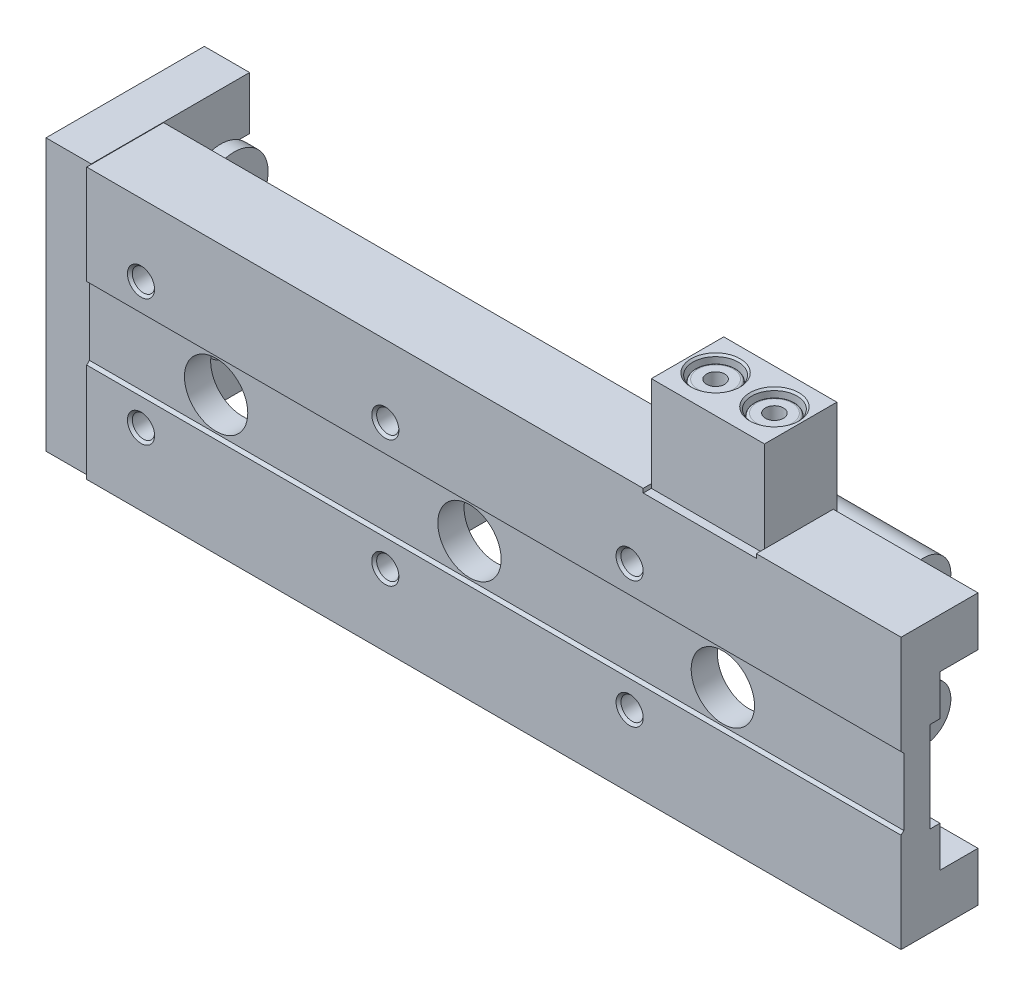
ISO-10303-21;
HEADER;
FILE_DESCRIPTION(('STEP AP214'),'2;1');
FILE_NAME('part.step','',(''),(''),'','','');
FILE_SCHEMA(('AUTOMOTIVE_DESIGN { 1 0 10303 214 1 1 1 1 }'));
ENDSEC;
DATA;
#1=APPLICATION_CONTEXT('core data for automotive mechanical design processes');
#2=APPLICATION_PROTOCOL_DEFINITION('international standard','automotive_design',2000,#1);
#3=PRODUCT_CONTEXT('',#1,'mechanical');
#4=PRODUCT('Part','Part','',(#3));
#5=PRODUCT_RELATED_PRODUCT_CATEGORY('part','',(#4));
#6=PRODUCT_DEFINITION_FORMATION('','',#4);
#7=PRODUCT_DEFINITION_CONTEXT('part definition',#1,'design');
#8=PRODUCT_DEFINITION('design','',#6,#7);
#9=PRODUCT_DEFINITION_SHAPE('','',#8);
#10=(LENGTH_UNIT() NAMED_UNIT(*) SI_UNIT(.MILLI.,.METRE.));
#11=(NAMED_UNIT(*) PLANE_ANGLE_UNIT() SI_UNIT($,.RADIAN.));
#12=(NAMED_UNIT(*) SI_UNIT($,.STERADIAN.) SOLID_ANGLE_UNIT());
#13=UNCERTAINTY_MEASURE_WITH_UNIT(LENGTH_MEASURE(1.E-05),#10,'distance_accuracy_value','');
#14=(GEOMETRIC_REPRESENTATION_CONTEXT(3) GLOBAL_UNCERTAINTY_ASSIGNED_CONTEXT((#13)) GLOBAL_UNIT_ASSIGNED_CONTEXT((#10,
#11,#12)) REPRESENTATION_CONTEXT('',''));
#15=CARTESIAN_POINT('',(0.,0.,0.));
#16=DIRECTION('',(0.,0.,1.));
#17=DIRECTION('',(1.,0.,0.));
#18=AXIS2_PLACEMENT_3D('',#15,#16,#17);
#19=CARTESIAN_POINT('',(88.5,9.5,6.3));
#20=DIRECTION('',(0.,0.,1.));
#21=DIRECTION('',(1.,0.,0.));
#22=AXIS2_PLACEMENT_3D('',#19,#20,#21);
#23=PLANE('',#22);
#24=DIRECTION('',(0.,1.,0.));
#25=VECTOR('',#24,1.);
#26=CARTESIAN_POINT('',(60.,9.5,6.3));
#27=LINE('',#26,#25);
#28=CARTESIAN_POINT('',(60.,14.5,6.3));
#29=VERTEX_POINT('',#28);
#30=CARTESIAN_POINT('',(60.,14.95,6.3));
#31=VERTEX_POINT('',#30);
#32=EDGE_CURVE('E558',#29,#31,#27,.T.);
#33=ORIENTED_EDGE('',*,*,#32,.F.);
#34=DIRECTION('',(-1.,0.,0.));
#35=VECTOR('',#34,1.);
#36=CARTESIAN_POINT('',(88.5,14.5,6.3));
#37=LINE('',#36,#35);
#38=CARTESIAN_POINT('',(72.5,14.5,6.3));
#39=VERTEX_POINT('',#38);
#40=EDGE_CURVE('E551',#39,#29,#37,.T.);
#41=ORIENTED_EDGE('',*,*,#40,.F.);
#42=DIRECTION('',(0.,-1.,0.));
#43=VECTOR('',#42,1.);
#44=CARTESIAN_POINT('',(72.5,9.5,6.3));
#45=LINE('',#44,#43);
#46=CARTESIAN_POINT('',(72.5,14.95,6.3));
#47=VERTEX_POINT('',#46);
#48=EDGE_CURVE('E548',#47,#39,#45,.T.);
#49=ORIENTED_EDGE('',*,*,#48,.F.);
#50=DIRECTION('',(-1.,0.,0.));
#51=VECTOR('',#50,1.);
#52=CARTESIAN_POINT('',(88.5,14.95,6.3));
#53=LINE('',#52,#51);
#54=CARTESIAN_POINT('',(88.5,14.95,6.3));
#55=VERTEX_POINT('',#54);
#56=EDGE_CURVE('E802',#55,#47,#53,.T.);
#57=ORIENTED_EDGE('',*,*,#56,.F.);
#58=DIRECTION('',(0.,1.,0.));
#59=VECTOR('',#58,1.);
#60=CARTESIAN_POINT('',(88.5,9.5,6.3));
#61=LINE('',#60,#59);
#62=CARTESIAN_POINT('',(88.5,9.5,6.3));
#63=VERTEX_POINT('',#62);
#64=EDGE_CURVE('E726',#63,#55,#61,.T.);
#65=ORIENTED_EDGE('',*,*,#64,.F.);
#66=DIRECTION('',(-1.,0.,0.));
#67=VECTOR('',#66,1.);
#68=CARTESIAN_POINT('',(88.5,9.5,6.3));
#69=LINE('',#68,#67);
#70=CARTESIAN_POINT('',(-1.5,9.5,6.3));
#71=VERTEX_POINT('',#70);
#72=EDGE_CURVE('E805',#63,#71,#69,.T.);
#73=ORIENTED_EDGE('',*,*,#72,.T.);
#74=DIRECTION('',(0.,1.,0.));
#75=VECTOR('',#74,1.);
#76=CARTESIAN_POINT('',(-1.5,9.5,6.3));
#77=LINE('',#76,#75);
#78=CARTESIAN_POINT('',(-1.5,11.1232409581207,6.3));
#79=VERTEX_POINT('',#78);
#80=EDGE_CURVE('E772',#71,#79,#77,.T.);
#81=ORIENTED_EDGE('',*,*,#80,.T.);
#82=CARTESIAN_POINT('',(-1.5,14.95,6.3));
#83=VERTEX_POINT('',#82);
#84=EDGE_CURVE('E771',#79,#83,#77,.T.);
#85=ORIENTED_EDGE('',*,*,#84,.T.);
#86=EDGE_CURVE('E801',#31,#83,#53,.T.);
#87=ORIENTED_EDGE('',*,*,#86,.F.);
#88=EDGE_LOOP('',(#33,#41,#49,#57,#65,#73,#81,#85,#87));
#89=FACE_BOUND('',#88,.T.);
#90=ADVANCED_FACE('F17',(#89),#23,.F.);
#91=CARTESIAN_POINT('',(88.5,14.95,6.3));
#92=DIRECTION('',(0.,-1.,0.));
#93=DIRECTION('',(0.,0.,-1.));
#94=AXIS2_PLACEMENT_3D('',#91,#92,#93);
#95=PLANE('',#94);
#96=DIRECTION('',(0.,0.,1.));
#97=VECTOR('',#96,1.);
#98=CARTESIAN_POINT('',(60.,14.95,6.3));
#99=LINE('',#98,#97);
#100=CARTESIAN_POINT('',(60.,14.95,13.9));
#101=VERTEX_POINT('',#100);
#102=EDGE_CURVE('E555',#31,#101,#99,.T.);
#103=ORIENTED_EDGE('',*,*,#102,.F.);
#104=ORIENTED_EDGE('',*,*,#86,.T.);
#105=DIRECTION('',(0.,0.,1.));
#106=VECTOR('',#105,1.);
#107=CARTESIAN_POINT('',(-1.5,14.95,6.3));
#108=LINE('',#107,#106);
#109=CARTESIAN_POINT('',(-1.5,14.95,14.3));
#110=VERTEX_POINT('',#109);
#111=EDGE_CURVE('E776',#83,#110,#108,.T.);
#112=ORIENTED_EDGE('',*,*,#111,.T.);
#113=CARTESIAN_POINT('',(-1.5,14.95,14.8));
#114=VERTEX_POINT('',#113);
#115=EDGE_CURVE('E775',#110,#114,#108,.T.);
#116=ORIENTED_EDGE('',*,*,#115,.T.);
#117=DIRECTION('',(-1.,0.,0.));
#118=VECTOR('',#117,1.);
#119=CARTESIAN_POINT('',(88.5,14.95,14.8));
#120=LINE('',#119,#118);
#121=CARTESIAN_POINT('',(60.,14.95,14.8));
#122=VERTEX_POINT('',#121);
#123=EDGE_CURVE('E797',#122,#114,#120,.T.);
#124=ORIENTED_EDGE('',*,*,#123,.F.);
#125=EDGE_CURVE('E554',#101,#122,#99,.T.);
#126=ORIENTED_EDGE('',*,*,#125,.F.);
#127=EDGE_LOOP('',(#103,#104,#112,#116,#124,#126));
#128=FACE_BOUND('',#127,.T.);
#129=ADVANCED_FACE('F1218',(#128),#95,.F.);
#130=DIRECTION('',(0.,0.,-1.));
#131=VECTOR('',#130,1.);
#132=CARTESIAN_POINT('',(72.5,14.95,6.3));
#133=LINE('',#132,#131);
#134=CARTESIAN_POINT('',(72.5,14.95,14.8));
#135=VERTEX_POINT('',#134);
#136=CARTESIAN_POINT('',(72.5,14.95,13.9));
#137=VERTEX_POINT('',#136);
#138=EDGE_CURVE('E546',#135,#137,#133,.T.);
#139=ORIENTED_EDGE('',*,*,#138,.F.);
#140=CARTESIAN_POINT('',(88.5,14.95,14.8));
#141=VERTEX_POINT('',#140);
#142=EDGE_CURVE('E798',#141,#135,#120,.T.);
#143=ORIENTED_EDGE('',*,*,#142,.F.);
#144=DIRECTION('',(0.,0.,1.));
#145=VECTOR('',#144,1.);
#146=CARTESIAN_POINT('',(88.5,14.95,6.3));
#147=LINE('',#146,#145);
#148=EDGE_CURVE('E728',#55,#141,#147,.T.);
#149=ORIENTED_EDGE('',*,*,#148,.F.);
#150=ORIENTED_EDGE('',*,*,#56,.T.);
#151=EDGE_CURVE('E545',#137,#47,#133,.T.);
#152=ORIENTED_EDGE('',*,*,#151,.F.);
#153=EDGE_LOOP('',(#139,#143,#149,#150,#152));
#154=FACE_BOUND('',#153,.T.);
#155=ADVANCED_FACE('F1324',(#154),#95,.F.);
#156=CARTESIAN_POINT('',(88.5,14.95,14.8));
#157=DIRECTION('',(0.,0.,-1.));
#158=DIRECTION('',(0.,1.,0.));
#159=AXIS2_PLACEMENT_3D('',#156,#157,#158);
#160=PLANE('',#159);
#161=CARTESIAN_POINT('',(58.5,7.,14.8));
#162=DIRECTION('',(0.,0.,1.));
#163=DIRECTION('',(1.,0.,0.));
#164=AXIS2_PLACEMENT_3D('',#161,#162,#163);
#165=CIRCLE('',#164,1.5);
#166=CARTESIAN_POINT('',(60.,7.,14.8));
#167=VERTEX_POINT('',#166);
#168=EDGE_CURVE('E1138',#167,#167,#165,.T.);
#169=ORIENTED_EDGE('',*,*,#168,.F.);
#170=EDGE_LOOP('',(#169));
#171=FACE_BOUND('',#170,.T.);
#172=CARTESIAN_POINT('',(31.5,7.,14.8));
#173=DIRECTION('',(0.,0.,1.));
#174=DIRECTION('',(1.,0.,0.));
#175=AXIS2_PLACEMENT_3D('',#172,#173,#174);
#176=CIRCLE('',#175,1.5);
#177=CARTESIAN_POINT('',(33.,7.,14.8));
#178=VERTEX_POINT('',#177);
#179=EDGE_CURVE('E1129',#178,#178,#176,.T.);
#180=ORIENTED_EDGE('',*,*,#179,.F.);
#181=EDGE_LOOP('',(#180));
#182=FACE_BOUND('',#181,.T.);
#183=CARTESIAN_POINT('',(4.49999999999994,7.,14.8));
#184=DIRECTION('',(0.,0.,1.));
#185=DIRECTION('',(1.,0.,0.));
#186=AXIS2_PLACEMENT_3D('',#183,#184,#185);
#187=CIRCLE('',#186,1.5);
#188=CARTESIAN_POINT('',(5.99999999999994,7.,14.8));
#189=VERTEX_POINT('',#188);
#190=EDGE_CURVE('E1120',#189,#189,#187,.T.);
#191=ORIENTED_EDGE('',*,*,#190,.F.);
#192=EDGE_LOOP('',(#191));
#193=FACE_BOUND('',#192,.T.);
#194=DIRECTION('',(0.,-1.,0.));
#195=VECTOR('',#194,1.);
#196=CARTESIAN_POINT('',(60.,14.95,14.8));
#197=LINE('',#196,#195);
#198=CARTESIAN_POINT('',(60.,14.5,14.8));
#199=VERTEX_POINT('',#198);
#200=EDGE_CURVE('E11',#122,#199,#197,.T.);
#201=ORIENTED_EDGE('',*,*,#200,.F.);
#202=ORIENTED_EDGE('',*,*,#123,.T.);
#203=DIRECTION('',(0.,-1.,0.));
#204=VECTOR('',#203,1.);
#205=CARTESIAN_POINT('',(-1.5,14.95,14.8));
#206=LINE('',#205,#204);
#207=CARTESIAN_POINT('',(-1.5,4.,14.8));
#208=VERTEX_POINT('',#207);
#209=EDGE_CURVE('E779',#114,#208,#206,.T.);
#210=ORIENTED_EDGE('',*,*,#209,.T.);
#211=DIRECTION('',(-1.,0.,0.));
#212=VECTOR('',#211,1.);
#213=CARTESIAN_POINT('',(88.5,4.,14.8));
#214=LINE('',#213,#212);
#215=CARTESIAN_POINT('',(88.5,4.,14.8));
#216=VERTEX_POINT('',#215);
#217=EDGE_CURVE('E794',#216,#208,#214,.T.);
#218=ORIENTED_EDGE('',*,*,#217,.F.);
#219=DIRECTION('',(0.,-1.,0.));
#220=VECTOR('',#219,1.);
#221=CARTESIAN_POINT('',(88.5,14.95,14.8));
#222=LINE('',#221,#220);
#223=EDGE_CURVE('E730',#141,#216,#222,.T.);
#224=ORIENTED_EDGE('',*,*,#223,.F.);
#225=ORIENTED_EDGE('',*,*,#142,.T.);
#226=DIRECTION('',(0.,1.,0.));
#227=VECTOR('',#226,1.);
#228=CARTESIAN_POINT('',(72.5,14.5,14.8));
#229=LINE('',#228,#227);
#230=CARTESIAN_POINT('',(72.5,14.5,14.8));
#231=VERTEX_POINT('',#230);
#232=EDGE_CURVE('E539',#231,#135,#229,.T.);
#233=ORIENTED_EDGE('',*,*,#232,.F.);
#234=DIRECTION('',(1.,0.,0.));
#235=VECTOR('',#234,1.);
#236=CARTESIAN_POINT('',(60.,14.5,14.8));
#237=LINE('',#236,#235);
#238=EDGE_CURVE('E536',#199,#231,#237,.T.);
#239=ORIENTED_EDGE('',*,*,#238,.F.);
#240=EDGE_LOOP('',(#201,#202,#210,#218,#224,#225,#233,#239));
#241=FACE_BOUND('',#240,.T.);
#242=ADVANCED_FACE('F1213',(#171,#182,#193,#241),#160,.F.);
#243=CARTESIAN_POINT('',(-1.5,-6.,-1.39785269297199E-07));
#244=DIRECTION('',(-1.,0.,0.));
#245=DIRECTION('',(0.,0.,1.));
#246=AXIS2_PLACEMENT_3D('',#243,#244,#245);
#247=PLANE('',#246);
#248=DIRECTION('',(0.,1.,0.));
#249=VECTOR('',#248,1.);
#250=CARTESIAN_POINT('',(-1.5,-5.,11.6));
#251=LINE('',#250,#249);
#252=CARTESIAN_POINT('',(-1.5,0.933632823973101,11.6));
#253=VERTEX_POINT('',#252);
#254=CARTESIAN_POINT('',(-1.5,5.,11.6));
#255=VERTEX_POINT('',#254);
#256=EDGE_CURVE('E757',#253,#255,#251,.T.);
#257=ORIENTED_EDGE('',*,*,#256,.F.);
#258=CARTESIAN_POINT('',(-1.5,0.,10.8));
#259=DIRECTION('',(-1.,0.,0.));
#260=DIRECTION('',(0.,0.,1.));
#261=AXIS2_PLACEMENT_3D('',#258,#259,#260);
#262=CIRCLE('',#261,1.2295);
#263=CARTESIAN_POINT('',(-1.5,-0.933632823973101,11.6));
#264=VERTEX_POINT('',#263);
#265=EDGE_CURVE('E616',#253,#264,#262,.T.);
#266=ORIENTED_EDGE('',*,*,#265,.T.);
#267=CARTESIAN_POINT('',(-1.5,-5.,11.6));
#268=VERTEX_POINT('',#267);
#269=EDGE_CURVE('E758',#268,#264,#251,.T.);
#270=ORIENTED_EDGE('',*,*,#269,.F.);
#271=DIRECTION('',(0.,0.,1.));
#272=VECTOR('',#271,1.);
#273=CARTESIAN_POINT('',(-1.5,-5.,10.5));
#274=LINE('',#273,#272);
#275=CARTESIAN_POINT('',(-1.5,-5.,10.5));
#276=VERTEX_POINT('',#275);
#277=EDGE_CURVE('E754',#276,#268,#274,.T.);
#278=ORIENTED_EDGE('',*,*,#277,.F.);
#279=DIRECTION('',(0.,1.,0.));
#280=VECTOR('',#279,1.);
#281=CARTESIAN_POINT('',(-1.5,-9.5,10.5));
#282=LINE('',#281,#280);
#283=CARTESIAN_POINT('',(-1.5,-9.5,10.5));
#284=VERTEX_POINT('',#283);
#285=EDGE_CURVE('E751',#284,#276,#282,.T.);
#286=ORIENTED_EDGE('',*,*,#285,.F.);
#287=DIRECTION('',(0.,0.,1.));
#288=VECTOR('',#287,1.);
#289=CARTESIAN_POINT('',(-1.5,-9.5,6.3));
#290=LINE('',#289,#288);
#291=CARTESIAN_POINT('',(-1.5,-9.5,6.92324095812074));
#292=VERTEX_POINT('',#291);
#293=EDGE_CURVE('E747',#292,#284,#290,.T.);
#294=ORIENTED_EDGE('',*,*,#293,.F.);
#295=CARTESIAN_POINT('',(-1.5,-10.,5.8));
#296=DIRECTION('',(-1.,0.,0.));
#297=DIRECTION('',(0.,0.,1.));
#298=AXIS2_PLACEMENT_3D('',#295,#296,#297);
#299=CIRCLE('',#298,1.2295);
#300=CARTESIAN_POINT('',(-1.5,-11.1232409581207,6.3));
#301=VERTEX_POINT('',#300);
#302=EDGE_CURVE('E626',#292,#301,#299,.T.);
#303=ORIENTED_EDGE('',*,*,#302,.T.);
#304=DIRECTION('',(0.,1.,0.));
#305=VECTOR('',#304,1.);
#306=CARTESIAN_POINT('',(-1.5,-14.95,6.3));
#307=LINE('',#306,#305);
#308=CARTESIAN_POINT('',(-1.5,-14.95,6.3));
#309=VERTEX_POINT('',#308);
#310=EDGE_CURVE('E744',#309,#301,#307,.T.);
#311=ORIENTED_EDGE('',*,*,#310,.F.);
#312=DIRECTION('',(0.,0.,-1.));
#313=VECTOR('',#312,1.);
#314=CARTESIAN_POINT('',(-1.5,-14.95,-1.39785269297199E-07));
#315=LINE('',#314,#313);
#316=CARTESIAN_POINT('',(-1.5,-14.95,14.3));
#317=VERTEX_POINT('',#316);
#318=EDGE_CURVE('E27',#317,#309,#315,.T.);
#319=ORIENTED_EDGE('',*,*,#318,.F.);
#320=DIRECTION('',(0.,-1.,0.));
#321=VECTOR('',#320,1.);
#322=CARTESIAN_POINT('',(-1.5,15.,14.3));
#323=LINE('',#322,#321);
#324=CARTESIAN_POINT('',(-1.5,-15.,14.3));
#325=VERTEX_POINT('',#324);
#326=EDGE_CURVE('E958',#317,#325,#323,.T.);
#327=ORIENTED_EDGE('',*,*,#326,.T.);
#328=DIRECTION('',(0.,0.,-1.));
#329=VECTOR('',#328,1.);
#330=CARTESIAN_POINT('',(-1.5,-15.,14.3));
#331=LINE('',#330,#329);
#332=CARTESIAN_POINT('',(-1.5,-15.,-3.2));
#333=VERTEX_POINT('',#332);
#334=EDGE_CURVE('E956',#325,#333,#331,.T.);
#335=ORIENTED_EDGE('',*,*,#334,.T.);
#336=DIRECTION('',(0.,1.,0.));
#337=VECTOR('',#336,1.);
#338=CARTESIAN_POINT('',(-1.5,-15.,-3.2));
#339=LINE('',#338,#337);
#340=CARTESIAN_POINT('',(-1.5,-9.15,-3.2));
#341=VERTEX_POINT('',#340);
#342=EDGE_CURVE('E960',#333,#341,#339,.T.);
#343=ORIENTED_EDGE('',*,*,#342,.T.);
#344=DIRECTION('',(0.,0.,1.));
#345=VECTOR('',#344,1.);
#346=CARTESIAN_POINT('',(-1.5,-9.15,-3.2));
#347=LINE('',#346,#345);
#348=CARTESIAN_POINT('',(-1.5,-9.15,-2.03469899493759));
#349=VERTEX_POINT('',#348);
#350=EDGE_CURVE('E963',#341,#349,#347,.T.);
#351=ORIENTED_EDGE('',*,*,#350,.T.);
#352=CARTESIAN_POINT('',(-1.5,-6.,0.));
#353=DIRECTION('',(-1.,0.,0.));
#354=DIRECTION('',(0.,0.,1.));
#355=AXIS2_PLACEMENT_3D('',#352,#353,#354);
#356=CIRCLE('',#355,3.75);
#357=CARTESIAN_POINT('',(-1.5,-2.85,-2.03469899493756));
#358=VERTEX_POINT('',#357);
#359=EDGE_CURVE('E1096',#358,#349,#356,.F.);
#360=ORIENTED_EDGE('',*,*,#359,.F.);
#361=DIRECTION('',(0.,0.,-1.));
#362=VECTOR('',#361,1.);
#363=CARTESIAN_POINT('',(-1.5,-2.85,0.));
#364=LINE('',#363,#362);
#365=CARTESIAN_POINT('',(-1.5,-2.85,-3.2));
#366=VERTEX_POINT('',#365);
#367=EDGE_CURVE('E968',#358,#366,#364,.T.);
#368=ORIENTED_EDGE('',*,*,#367,.T.);
#369=DIRECTION('',(0.,1.,0.));
#370=VECTOR('',#369,1.);
#371=CARTESIAN_POINT('',(-1.5,-2.85,-3.2));
#372=LINE('',#371,#370);
#373=CARTESIAN_POINT('',(-1.5,2.85,-3.2));
#374=VERTEX_POINT('',#373);
#375=EDGE_CURVE('E972',#366,#374,#372,.T.);
#376=ORIENTED_EDGE('',*,*,#375,.T.);
#377=DIRECTION('',(0.,0.,1.));
#378=VECTOR('',#377,1.);
#379=CARTESIAN_POINT('',(-1.5,2.85,-3.2));
#380=LINE('',#379,#378);
#381=CARTESIAN_POINT('',(-1.5,2.85,-2.03469899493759));
#382=VERTEX_POINT('',#381);
#383=EDGE_CURVE('E975',#374,#382,#380,.T.);
#384=ORIENTED_EDGE('',*,*,#383,.T.);
#385=CARTESIAN_POINT('',(-1.5,6.,0.));
#386=DIRECTION('',(-1.,0.,0.));
#387=DIRECTION('',(0.,-1.,0.));
#388=AXIS2_PLACEMENT_3D('',#385,#386,#387);
#389=CIRCLE('',#388,3.75);
#390=CARTESIAN_POINT('',(-1.5,9.15,-2.03469899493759));
#391=VERTEX_POINT('',#390);
#392=EDGE_CURVE('E1064',#382,#391,#389,.T.);
#393=ORIENTED_EDGE('',*,*,#392,.T.);
#394=DIRECTION('',(0.,0.,-1.));
#395=VECTOR('',#394,1.);
#396=CARTESIAN_POINT('',(-1.5,9.15,0.));
#397=LINE('',#396,#395);
#398=CARTESIAN_POINT('',(-1.5,9.15,-3.2));
#399=VERTEX_POINT('',#398);
#400=EDGE_CURVE('E980',#391,#399,#397,.T.);
#401=ORIENTED_EDGE('',*,*,#400,.T.);
#402=DIRECTION('',(0.,1.,0.));
#403=VECTOR('',#402,1.);
#404=CARTESIAN_POINT('',(-1.5,9.15,-3.2));
#405=LINE('',#404,#403);
#406=CARTESIAN_POINT('',(-1.5,15.,-3.2));
#407=VERTEX_POINT('',#406);
#408=EDGE_CURVE('E984',#399,#407,#405,.T.);
#409=ORIENTED_EDGE('',*,*,#408,.T.);
#410=DIRECTION('',(0.,0.,1.));
#411=VECTOR('',#410,1.);
#412=CARTESIAN_POINT('',(-1.5,15.,-3.2));
#413=LINE('',#412,#411);
#414=CARTESIAN_POINT('',(-1.5,15.,14.3));
#415=VERTEX_POINT('',#414);
#416=EDGE_CURVE('E986',#407,#415,#413,.T.);
#417=ORIENTED_EDGE('',*,*,#416,.T.);
#418=EDGE_CURVE('E954',#415,#110,#323,.T.);
#419=ORIENTED_EDGE('',*,*,#418,.T.);
#420=ORIENTED_EDGE('',*,*,#111,.F.);
#421=ORIENTED_EDGE('',*,*,#84,.F.);
#422=CARTESIAN_POINT('',(-1.5,10.,5.8));
#423=DIRECTION('',(-1.,0.,0.));
#424=DIRECTION('',(0.,0.,1.));
#425=AXIS2_PLACEMENT_3D('',#422,#423,#424);
#426=CIRCLE('',#425,1.2295);
#427=CARTESIAN_POINT('',(-1.5,9.5,6.92324095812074));
#428=VERTEX_POINT('',#427);
#429=EDGE_CURVE('E639',#79,#428,#426,.T.);
#430=ORIENTED_EDGE('',*,*,#429,.T.);
#431=DIRECTION('',(0.,0.,-1.));
#432=VECTOR('',#431,1.);
#433=CARTESIAN_POINT('',(-1.5,9.5,10.5));
#434=LINE('',#433,#432);
#435=CARTESIAN_POINT('',(-1.5,9.5,10.5));
#436=VERTEX_POINT('',#435);
#437=EDGE_CURVE('E768',#436,#428,#434,.T.);
#438=ORIENTED_EDGE('',*,*,#437,.F.);
#439=DIRECTION('',(0.,1.,0.));
#440=VECTOR('',#439,1.);
#441=CARTESIAN_POINT('',(-1.5,5.,10.5));
#442=LINE('',#441,#440);
#443=CARTESIAN_POINT('',(-1.5,5.,10.5));
#444=VERTEX_POINT('',#443);
#445=EDGE_CURVE('E765',#444,#436,#442,.T.);
#446=ORIENTED_EDGE('',*,*,#445,.F.);
#447=DIRECTION('',(0.,0.,-1.));
#448=VECTOR('',#447,1.);
#449=CARTESIAN_POINT('',(-1.5,5.,11.6));
#450=LINE('',#449,#448);
#451=EDGE_CURVE('E761',#255,#444,#450,.T.);
#452=ORIENTED_EDGE('',*,*,#451,.F.);
#453=EDGE_LOOP('',(#257,#266,#270,#278,#286,#294,#303,#311,#319,#327,#335,#343,#351,#360,#368,
#376,#384,#393,#401,#409,#417,#419,#420,#421,#430,#438,#446,#452));
#454=FACE_BOUND('',#453,.T.);
#455=ADVANCED_FACE('F1225',(#454),#247,.F.);
#456=CARTESIAN_POINT('',(-4.4,-6.,-1.39785269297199E-07));
#457=DIRECTION('',(-1.,0.,0.));
#458=DIRECTION('',(0.,0.,1.));
#459=AXIS2_PLACEMENT_3D('',#456,#457,#458);
#460=PLANE('',#459);
#461=DIRECTION('',(0.,0.,-1.));
#462=VECTOR('',#461,1.);
#463=CARTESIAN_POINT('',(-4.4,-2.85,0.));
#464=LINE('',#463,#462);
#465=CARTESIAN_POINT('',(-4.4,-2.85,-2.03469899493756));
#466=VERTEX_POINT('',#465);
#467=CARTESIAN_POINT('',(-4.4,-2.85,-3.2));
#468=VERTEX_POINT('',#467);
#469=EDGE_CURVE('E996',#466,#468,#464,.T.);
#470=ORIENTED_EDGE('',*,*,#469,.F.);
#471=CARTESIAN_POINT('',(-4.4,-6.,0.));
#472=DIRECTION('',(-1.,0.,0.));
#473=DIRECTION('',(0.,0.,1.));
#474=AXIS2_PLACEMENT_3D('',#471,#472,#473);
#475=CIRCLE('',#474,3.75);
#476=CARTESIAN_POINT('',(-4.4,-9.15,-2.03469899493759));
#477=VERTEX_POINT('',#476);
#478=EDGE_CURVE('E859',#477,#466,#475,.T.);
#479=ORIENTED_EDGE('',*,*,#478,.F.);
#480=DIRECTION('',(0.,0.,1.));
#481=VECTOR('',#480,1.);
#482=CARTESIAN_POINT('',(-4.4,-9.15,-3.2));
#483=LINE('',#482,#481);
#484=CARTESIAN_POINT('',(-4.4,-9.15,-3.2));
#485=VERTEX_POINT('',#484);
#486=EDGE_CURVE('E990',#485,#477,#483,.T.);
#487=ORIENTED_EDGE('',*,*,#486,.F.);
#488=DIRECTION('',(0.,1.,0.));
#489=VECTOR('',#488,1.);
#490=CARTESIAN_POINT('',(-4.4,-15.,-3.2));
#491=LINE('',#490,#489);
#492=CARTESIAN_POINT('',(-4.4,-10.75,-3.2));
#493=VERTEX_POINT('',#492);
#494=EDGE_CURVE('E953',#493,#485,#491,.T.);
#495=ORIENTED_EDGE('',*,*,#494,.F.);
#496=DIRECTION('',(0.,0.,1.));
#497=VECTOR('',#496,1.);
#498=CARTESIAN_POINT('',(-4.4,-10.75,-3.2));
#499=LINE('',#498,#497);
#500=CARTESIAN_POINT('',(-4.4,-10.75,0.));
#501=VERTEX_POINT('',#500);
#502=EDGE_CURVE('E884',#493,#501,#499,.T.);
#503=ORIENTED_EDGE('',*,*,#502,.T.);
#504=CARTESIAN_POINT('',(-4.4,-6.,0.));
#505=DIRECTION('',(-1.,0.,0.));
#506=DIRECTION('',(0.,0.,1.));
#507=AXIS2_PLACEMENT_3D('',#504,#505,#506);
#508=CIRCLE('',#507,4.75);
#509=CARTESIAN_POINT('',(-4.4,-1.25,0.));
#510=VERTEX_POINT('',#509);
#511=EDGE_CURVE('E887',#501,#510,#508,.T.);
#512=ORIENTED_EDGE('',*,*,#511,.T.);
#513=DIRECTION('',(0.,0.,-1.));
#514=VECTOR('',#513,1.);
#515=CARTESIAN_POINT('',(-4.4,-1.25,0.));
#516=LINE('',#515,#514);
#517=CARTESIAN_POINT('',(-4.4,-1.25,-3.2));
#518=VERTEX_POINT('',#517);
#519=EDGE_CURVE('E891',#510,#518,#516,.T.);
#520=ORIENTED_EDGE('',*,*,#519,.T.);
#521=DIRECTION('',(0.,1.,0.));
#522=VECTOR('',#521,1.);
#523=CARTESIAN_POINT('',(-4.4,-2.85,-3.2));
#524=LINE('',#523,#522);
#525=EDGE_CURVE('E1001',#468,#518,#524,.T.);
#526=ORIENTED_EDGE('',*,*,#525,.F.);
#527=EDGE_LOOP('',(#470,#479,#487,#495,#503,#512,#520,#526));
#528=FACE_BOUND('',#527,.T.);
#529=ADVANCED_FACE('F1257',(#528),#460,.T.);
#530=CARTESIAN_POINT('',(-4.4,1.25,-3.2));
#531=VERTEX_POINT('',#530);
#532=CARTESIAN_POINT('',(-4.4,2.85,-3.2));
#533=VERTEX_POINT('',#532);
#534=EDGE_CURVE('E1000',#531,#533,#524,.T.);
#535=ORIENTED_EDGE('',*,*,#534,.F.);
#536=DIRECTION('',(0.,0.,1.));
#537=VECTOR('',#536,1.);
#538=CARTESIAN_POINT('',(-4.4,1.25,-3.2));
#539=LINE('',#538,#537);
#540=CARTESIAN_POINT('',(-4.4,1.25,0.));
#541=VERTEX_POINT('',#540);
#542=EDGE_CURVE('E894',#531,#541,#539,.T.);
#543=ORIENTED_EDGE('',*,*,#542,.T.);
#544=CARTESIAN_POINT('',(-4.4,6.,0.));
#545=DIRECTION('',(-1.,0.,0.));
#546=DIRECTION('',(0.,0.,1.));
#547=AXIS2_PLACEMENT_3D('',#544,#545,#546);
#548=CIRCLE('',#547,4.75);
#549=CARTESIAN_POINT('',(-4.4,10.75,0.));
#550=VERTEX_POINT('',#549);
#551=EDGE_CURVE('E897',#541,#550,#548,.T.);
#552=ORIENTED_EDGE('',*,*,#551,.T.);
#553=DIRECTION('',(0.,0.,-1.));
#554=VECTOR('',#553,1.);
#555=CARTESIAN_POINT('',(-4.4,10.75,0.));
#556=LINE('',#555,#554);
#557=CARTESIAN_POINT('',(-4.4,10.75,-3.2));
#558=VERTEX_POINT('',#557);
#559=EDGE_CURVE('E900',#550,#558,#556,.T.);
#560=ORIENTED_EDGE('',*,*,#559,.T.);
#561=DIRECTION('',(0.,1.,0.));
#562=VECTOR('',#561,1.);
#563=CARTESIAN_POINT('',(-4.4,9.15,-3.2));
#564=LINE('',#563,#562);
#565=CARTESIAN_POINT('',(-4.4,9.15,-3.2));
#566=VERTEX_POINT('',#565);
#567=EDGE_CURVE('E1015',#566,#558,#564,.T.);
#568=ORIENTED_EDGE('',*,*,#567,.F.);
#569=DIRECTION('',(0.,0.,-1.));
#570=VECTOR('',#569,1.);
#571=CARTESIAN_POINT('',(-4.4,9.15,0.));
#572=LINE('',#571,#570);
#573=CARTESIAN_POINT('',(-4.4,9.15,-2.03469899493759));
#574=VERTEX_POINT('',#573);
#575=EDGE_CURVE('E1011',#574,#566,#572,.T.);
#576=ORIENTED_EDGE('',*,*,#575,.F.);
#577=CARTESIAN_POINT('',(-4.4,6.,0.));
#578=DIRECTION('',(-1.,0.,0.));
#579=DIRECTION('',(0.,-1.,0.));
#580=AXIS2_PLACEMENT_3D('',#577,#578,#579);
#581=CIRCLE('',#580,3.75);
#582=CARTESIAN_POINT('',(-4.4,2.85,-2.03469899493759));
#583=VERTEX_POINT('',#582);
#584=EDGE_CURVE('E1074',#583,#574,#581,.T.);
#585=ORIENTED_EDGE('',*,*,#584,.F.);
#586=DIRECTION('',(0.,0.,1.));
#587=VECTOR('',#586,1.);
#588=CARTESIAN_POINT('',(-4.4,2.85,-3.2));
#589=LINE('',#588,#587);
#590=EDGE_CURVE('E1005',#533,#583,#589,.T.);
#591=ORIENTED_EDGE('',*,*,#590,.F.);
#592=EDGE_LOOP('',(#535,#543,#552,#560,#568,#576,#585,#591));
#593=FACE_BOUND('',#592,.T.);
#594=ADVANCED_FACE('F2621',(#593),#460,.T.);
#595=CARTESIAN_POINT('',(-4.4,9.75,0.));
#596=DIRECTION('',(-1.,0.,0.));
#597=DIRECTION('',(0.,-1.,0.));
#598=AXIS2_PLACEMENT_3D('',#595,#596,#597);
#599=PLANE('',#598);
#600=CARTESIAN_POINT('',(-4.4,6.,0.));
#601=DIRECTION('',(-1.,0.,0.));
#602=DIRECTION('',(0.,-1.,0.));
#603=AXIS2_PLACEMENT_3D('',#600,#601,#602);
#604=CIRCLE('',#603,2.75);
#605=CARTESIAN_POINT('',(-4.4,3.25,0.));
#606=VERTEX_POINT('',#605);
#607=EDGE_CURVE('E1071',#606,#606,#604,.T.);
#608=ORIENTED_EDGE('',*,*,#607,.T.);
#609=EDGE_LOOP('',(#608));
#610=FACE_BOUND('',#609,.T.);
#611=CARTESIAN_POINT('',(-4.4,2.85,1.39785282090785E-07));
#612=VERTEX_POINT('',#611);
#613=EDGE_CURVE('E1004',#583,#612,#589,.T.);
#614=ORIENTED_EDGE('',*,*,#613,.F.);
#615=EDGE_CURVE('E1075',#574,#583,#581,.T.);
#616=ORIENTED_EDGE('',*,*,#615,.F.);
#617=CARTESIAN_POINT('',(-4.4,9.15,0.));
#618=VERTEX_POINT('',#617);
#619=EDGE_CURVE('E1012',#618,#574,#572,.T.);
#620=ORIENTED_EDGE('',*,*,#619,.F.);
#621=CARTESIAN_POINT('',(-4.4,6.,1.39785282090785E-07));
#622=DIRECTION('',(-1.,0.,0.));
#623=DIRECTION('',(0.,0.,1.));
#624=AXIS2_PLACEMENT_3D('',#621,#622,#623);
#625=CIRCLE('',#624,3.15);
#626=EDGE_CURVE('E1008',#612,#618,#625,.T.);
#627=ORIENTED_EDGE('',*,*,#626,.F.);
#628=EDGE_LOOP('',(#614,#616,#620,#627));
#629=FACE_BOUND('',#628,.T.);
#630=ADVANCED_FACE('F2801',(#610,#629),#599,.F.);
#631=CARTESIAN_POINT('',(-1.5,8.75,0.));
#632=DIRECTION('',(1.,0.,0.));
#633=DIRECTION('',(0.,1.,0.));
#634=AXIS2_PLACEMENT_3D('',#631,#632,#633);
#635=PLANE('',#634);
#636=CARTESIAN_POINT('',(-1.5,6.,0.));
#637=DIRECTION('',(-1.,0.,0.));
#638=DIRECTION('',(0.,-1.,0.));
#639=AXIS2_PLACEMENT_3D('',#636,#637,#638);
#640=CIRCLE('',#639,2.75);
#641=CARTESIAN_POINT('',(-1.5,3.25,0.));
#642=VERTEX_POINT('',#641);
#643=EDGE_CURVE('E1068',#642,#642,#640,.T.);
#644=ORIENTED_EDGE('',*,*,#643,.F.);
#645=EDGE_LOOP('',(#644));
#646=FACE_BOUND('',#645,.T.);
#647=CARTESIAN_POINT('',(-1.5,2.85,0.));
#648=VERTEX_POINT('',#647);
#649=EDGE_CURVE('E974',#382,#648,#380,.T.);
#650=ORIENTED_EDGE('',*,*,#649,.T.);
#651=CARTESIAN_POINT('',(-1.5,6.,1.39785282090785E-07));
#652=DIRECTION('',(-1.,0.,0.));
#653=DIRECTION('',(0.,0.,1.));
#654=AXIS2_PLACEMENT_3D('',#651,#652,#653);
#655=CIRCLE('',#654,3.15);
#656=CARTESIAN_POINT('',(-1.5,9.15,0.));
#657=VERTEX_POINT('',#656);
#658=EDGE_CURVE('E978',#648,#657,#655,.T.);
#659=ORIENTED_EDGE('',*,*,#658,.T.);
#660=EDGE_CURVE('E981',#657,#391,#397,.T.);
#661=ORIENTED_EDGE('',*,*,#660,.T.);
#662=EDGE_CURVE('E1065',#391,#382,#389,.T.);
#663=ORIENTED_EDGE('',*,*,#662,.T.);
#664=EDGE_LOOP('',(#650,#659,#661,#663));
#665=FACE_BOUND('',#664,.T.);
#666=ADVANCED_FACE('F2796',(#646,#665),#635,.F.);
#667=CARTESIAN_POINT('',(-4.6,6.,0.));
#668=DIRECTION('',(-1.,0.,0.));
#669=DIRECTION('',(0.,-1.,0.));
#670=AXIS2_PLACEMENT_3D('',#667,#668,#669);
#671=CONICAL_SURFACE('',#670,1.44,1.0471975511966);
#672=CARTESIAN_POINT('',(-3.76861561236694,6.,0.));
#673=VERTEX_POINT('',#672);
#674=VERTEX_LOOP('',#673);
#675=FACE_BOUND('',#674,.T.);
#676=CARTESIAN_POINT('',(-4.6,6.,0.));
#677=DIRECTION('',(-1.,0.,0.));
#678=DIRECTION('',(0.,-1.,0.));
#679=AXIS2_PLACEMENT_3D('',#676,#677,#678);
#680=CIRCLE('',#679,1.44);
#681=CARTESIAN_POINT('',(-4.6,4.56,0.));
#682=VERTEX_POINT('',#681);
#683=EDGE_CURVE('E1093',#682,#682,#680,.T.);
#684=ORIENTED_EDGE('',*,*,#683,.T.);
#685=EDGE_LOOP('',(#684));
#686=FACE_BOUND('',#685,.T.);
#687=ADVANCED_FACE('F19',(#675,#686),#671,.F.);
#688=CARTESIAN_POINT('',(76.2,6.,0.));
#689=DIRECTION('',(-1.,0.,0.));
#690=DIRECTION('',(0.,-1.,0.));
#691=AXIS2_PLACEMENT_3D('',#688,#689,#690);
#692=CYLINDRICAL_SURFACE('',#691,1.44);
#693=ORIENTED_EDGE('',*,*,#683,.F.);
#694=EDGE_LOOP('',(#693));
#695=FACE_BOUND('',#694,.T.);
#696=CARTESIAN_POINT('',(-5.8,6.,0.));
#697=DIRECTION('',(-1.,0.,0.));
#698=DIRECTION('',(0.,-1.,0.));
#699=AXIS2_PLACEMENT_3D('',#696,#697,#698);
#700=CIRCLE('',#699,1.44);
#701=CARTESIAN_POINT('',(-5.8,4.56,0.));
#702=VERTEX_POINT('',#701);
#703=EDGE_CURVE('E1090',#702,#702,#700,.T.);
#704=ORIENTED_EDGE('',*,*,#703,.T.);
#705=EDGE_LOOP('',(#704));
#706=FACE_BOUND('',#705,.T.);
#707=ADVANCED_FACE('F2863',(#695,#706),#692,.F.);
#708=CARTESIAN_POINT('',(-5.8,7.44,0.));
#709=DIRECTION('',(1.,0.,0.));
#710=DIRECTION('',(0.,1.,0.));
#711=AXIS2_PLACEMENT_3D('',#708,#709,#710);
#712=PLANE('',#711);
#713=ORIENTED_EDGE('',*,*,#703,.F.);
#714=EDGE_LOOP('',(#713));
#715=FACE_BOUND('',#714,.T.);
#716=CARTESIAN_POINT('',(-5.8,6.,0.));
#717=DIRECTION('',(-1.,0.,0.));
#718=DIRECTION('',(0.,-1.,0.));
#719=AXIS2_PLACEMENT_3D('',#716,#717,#718);
#720=CIRCLE('',#719,1.55);
#721=CARTESIAN_POINT('',(-5.8,4.45,0.));
#722=VERTEX_POINT('',#721);
#723=EDGE_CURVE('E1087',#722,#722,#720,.T.);
#724=ORIENTED_EDGE('',*,*,#723,.T.);
#725=EDGE_LOOP('',(#724));
#726=FACE_BOUND('',#725,.T.);
#727=ADVANCED_FACE('F2854',(#715,#726),#712,.F.);
#728=CARTESIAN_POINT('',(-6.,6.,0.));
#729=DIRECTION('',(-1.,0.,0.));
#730=DIRECTION('',(0.,-1.,0.));
#731=AXIS2_PLACEMENT_3D('',#728,#729,#730);
#732=CONICAL_SURFACE('',#731,1.75,0.785398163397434);
#733=ORIENTED_EDGE('',*,*,#723,.F.);
#734=EDGE_LOOP('',(#733));
#735=FACE_BOUND('',#734,.T.);
#736=CARTESIAN_POINT('',(-6.,6.,0.));
#737=DIRECTION('',(-1.,0.,0.));
#738=DIRECTION('',(0.,-1.,0.));
#739=AXIS2_PLACEMENT_3D('',#736,#737,#738);
#740=CIRCLE('',#739,1.75);
#741=CARTESIAN_POINT('',(-6.,4.25,0.));
#742=VERTEX_POINT('',#741);
#743=EDGE_CURVE('E1084',#742,#742,#740,.T.);
#744=ORIENTED_EDGE('',*,*,#743,.T.);
#745=EDGE_LOOP('',(#744));
#746=FACE_BOUND('',#745,.T.);
#747=ADVANCED_FACE('F2845',(#735,#746),#732,.F.);
#748=CARTESIAN_POINT('',(76.2,6.,0.));
#749=DIRECTION('',(-1.,0.,0.));
#750=DIRECTION('',(0.,-1.,0.));
#751=AXIS2_PLACEMENT_3D('',#748,#749,#750);
#752=CYLINDRICAL_SURFACE('',#751,1.75);
#753=ORIENTED_EDGE('',*,*,#743,.F.);
#754=EDGE_LOOP('',(#753));
#755=FACE_BOUND('',#754,.T.);
#756=CARTESIAN_POINT('',(-6.3,6.,0.));
#757=DIRECTION('',(-1.,0.,0.));
#758=DIRECTION('',(0.,-1.,0.));
#759=AXIS2_PLACEMENT_3D('',#756,#757,#758);
#760=CIRCLE('',#759,1.75);
#761=CARTESIAN_POINT('',(-6.3,4.25,0.));
#762=VERTEX_POINT('',#761);
#763=EDGE_CURVE('E1081',#762,#762,#760,.T.);
#764=ORIENTED_EDGE('',*,*,#763,.T.);
#765=EDGE_LOOP('',(#764));
#766=FACE_BOUND('',#765,.T.);
#767=ADVANCED_FACE('F2836',(#755,#766),#752,.F.);
#768=CARTESIAN_POINT('',(-6.3,7.75,0.));
#769=DIRECTION('',(1.,0.,0.));
#770=DIRECTION('',(0.,1.,0.));
#771=AXIS2_PLACEMENT_3D('',#768,#769,#770);
#772=PLANE('',#771);
#773=ORIENTED_EDGE('',*,*,#763,.F.);
#774=EDGE_LOOP('',(#773));
#775=FACE_BOUND('',#774,.T.);
#776=CARTESIAN_POINT('',(-6.3,6.,0.));
#777=DIRECTION('',(-1.,0.,0.));
#778=DIRECTION('',(0.,-1.,0.));
#779=AXIS2_PLACEMENT_3D('',#776,#777,#778);
#780=CIRCLE('',#779,3.75);
#781=CARTESIAN_POINT('',(-6.3,2.25,0.));
#782=VERTEX_POINT('',#781);
#783=EDGE_CURVE('E1078',#782,#782,#780,.T.);
#784=ORIENTED_EDGE('',*,*,#783,.T.);
#785=EDGE_LOOP('',(#784));
#786=FACE_BOUND('',#785,.T.);
#787=ADVANCED_FACE('F2827',(#775,#786),#772,.F.);
#788=CARTESIAN_POINT('',(76.2,6.,0.));
#789=DIRECTION('',(-1.,0.,0.));
#790=DIRECTION('',(0.,-1.,0.));
#791=AXIS2_PLACEMENT_3D('',#788,#789,#790);
#792=CYLINDRICAL_SURFACE('',#791,3.75);
#793=ORIENTED_EDGE('',*,*,#783,.F.);
#794=EDGE_LOOP('',(#793));
#795=FACE_BOUND('',#794,.T.);
#796=ORIENTED_EDGE('',*,*,#615,.T.);
#797=ORIENTED_EDGE('',*,*,#584,.T.);
#798=EDGE_LOOP('',(#796,#797));
#799=FACE_BOUND('',#798,.T.);
#800=ADVANCED_FACE('F2811',(#795,#799),#792,.T.);
#801=CARTESIAN_POINT('',(76.2,6.,0.));
#802=DIRECTION('',(-1.,0.,0.));
#803=DIRECTION('',(0.,-1.,0.));
#804=AXIS2_PLACEMENT_3D('',#801,#802,#803);
#805=CYLINDRICAL_SURFACE('',#804,2.75);
#806=ORIENTED_EDGE('',*,*,#607,.F.);
#807=EDGE_LOOP('',(#806));
#808=FACE_BOUND('',#807,.T.);
#809=ORIENTED_EDGE('',*,*,#643,.T.);
#810=EDGE_LOOP('',(#809));
#811=FACE_BOUND('',#810,.T.);
#812=ADVANCED_FACE('F2790',(#808,#811),#805,.T.);
#813=CARTESIAN_POINT('',(76.2,6.,0.));
#814=DIRECTION('',(-1.,0.,0.));
#815=DIRECTION('',(0.,-1.,0.));
#816=AXIS2_PLACEMENT_3D('',#813,#814,#815);
#817=CYLINDRICAL_SURFACE('',#816,3.75);
#818=ORIENTED_EDGE('',*,*,#662,.F.);
#819=ORIENTED_EDGE('',*,*,#392,.F.);
#820=EDGE_LOOP('',(#818,#819));
#821=FACE_BOUND('',#820,.T.);
#822=CARTESIAN_POINT('',(0.,6.,0.));
#823=DIRECTION('',(-1.,0.,0.));
#824=DIRECTION('',(0.,-1.,0.));
#825=AXIS2_PLACEMENT_3D('',#822,#823,#824);
#826=CIRCLE('',#825,3.75);
#827=CARTESIAN_POINT('',(0.,2.25,0.));
#828=VERTEX_POINT('',#827);
#829=EDGE_CURVE('E1061',#828,#828,#826,.T.);
#830=ORIENTED_EDGE('',*,*,#829,.T.);
#831=EDGE_LOOP('',(#830));
#832=FACE_BOUND('',#831,.T.);
#833=ADVANCED_FACE('F2781',(#821,#832),#817,.T.);
#834=CARTESIAN_POINT('',(0.,9.75,0.));
#835=DIRECTION('',(-1.,0.,0.));
#836=DIRECTION('',(0.,-1.,0.));
#837=AXIS2_PLACEMENT_3D('',#834,#835,#836);
#838=PLANE('',#837);
#839=ORIENTED_EDGE('',*,*,#829,.F.);
#840=EDGE_LOOP('',(#839));
#841=FACE_BOUND('',#840,.T.);
#842=CARTESIAN_POINT('',(0.,6.,0.));
#843=DIRECTION('',(-1.,0.,0.));
#844=DIRECTION('',(0.,-1.,0.));
#845=AXIS2_PLACEMENT_3D('',#842,#843,#844);
#846=CIRCLE('',#845,1.5);
#847=CARTESIAN_POINT('',(0.,4.5,0.));
#848=VERTEX_POINT('',#847);
#849=EDGE_CURVE('E1058',#848,#848,#846,.T.);
#850=ORIENTED_EDGE('',*,*,#849,.T.);
#851=EDGE_LOOP('',(#850));
#852=FACE_BOUND('',#851,.T.);
#853=ADVANCED_FACE('F2772',(#841,#852),#838,.F.);
#854=CARTESIAN_POINT('',(76.2,6.,0.));
#855=DIRECTION('',(-1.,0.,0.));
#856=DIRECTION('',(0.,-1.,0.));
#857=AXIS2_PLACEMENT_3D('',#854,#855,#856);
#858=CYLINDRICAL_SURFACE('',#857,1.5);
#859=ORIENTED_EDGE('',*,*,#849,.F.);
#860=EDGE_LOOP('',(#859));
#861=FACE_BOUND('',#860,.T.);
#862=CARTESIAN_POINT('',(63.8,6.,0.));
#863=DIRECTION('',(-1.,0.,0.));
#864=DIRECTION('',(0.,-1.,0.));
#865=AXIS2_PLACEMENT_3D('',#862,#863,#864);
#866=CIRCLE('',#865,1.49999999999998);
#867=CARTESIAN_POINT('',(63.8,4.50000000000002,0.));
#868=VERTEX_POINT('',#867);
#869=EDGE_CURVE('E1055',#868,#868,#866,.T.);
#870=ORIENTED_EDGE('',*,*,#869,.T.);
#871=EDGE_LOOP('',(#870));
#872=FACE_BOUND('',#871,.T.);
#873=ADVANCED_FACE('F2763',(#861,#872),#858,.T.);
#874=CARTESIAN_POINT('',(63.8,7.5,0.));
#875=DIRECTION('',(1.,0.,0.));
#876=DIRECTION('',(0.,1.,0.));
#877=AXIS2_PLACEMENT_3D('',#874,#875,#876);
#878=PLANE('',#877);
#879=ORIENTED_EDGE('',*,*,#869,.F.);
#880=EDGE_LOOP('',(#879));
#881=FACE_BOUND('',#880,.T.);
#882=CARTESIAN_POINT('',(63.8,6.,0.));
#883=DIRECTION('',(-1.,0.,0.));
#884=DIRECTION('',(0.,-1.,0.));
#885=AXIS2_PLACEMENT_3D('',#882,#883,#884);
#886=CIRCLE('',#885,3.);
#887=CARTESIAN_POINT('',(63.8,3.,0.));
#888=VERTEX_POINT('',#887);
#889=EDGE_CURVE('E1052',#888,#888,#886,.T.);
#890=ORIENTED_EDGE('',*,*,#889,.T.);
#891=EDGE_LOOP('',(#890));
#892=FACE_BOUND('',#891,.T.);
#893=ADVANCED_FACE('F2754',(#881,#892),#878,.F.);
#894=CARTESIAN_POINT('',(76.2,6.,0.));
#895=DIRECTION('',(-1.,0.,0.));
#896=DIRECTION('',(0.,-1.,0.));
#897=AXIS2_PLACEMENT_3D('',#894,#895,#896);
#898=CYLINDRICAL_SURFACE('',#897,3.);
#899=ORIENTED_EDGE('',*,*,#889,.F.);
#900=EDGE_LOOP('',(#899));
#901=FACE_BOUND('',#900,.T.);
#902=CARTESIAN_POINT('',(76.2,6.,0.));
#903=DIRECTION('',(-1.,0.,0.));
#904=DIRECTION('',(0.,-1.,0.));
#905=AXIS2_PLACEMENT_3D('',#902,#903,#904);
#906=CIRCLE('',#905,3.);
#907=CARTESIAN_POINT('',(76.2,3.,0.));
#908=VERTEX_POINT('',#907);
#909=EDGE_CURVE('E1049',#908,#908,#906,.T.);
#910=ORIENTED_EDGE('',*,*,#909,.T.);
#911=EDGE_LOOP('',(#910));
#912=FACE_BOUND('',#911,.T.);
#913=ADVANCED_FACE('F2744',(#901,#912),#898,.T.);
#914=CARTESIAN_POINT('',(76.2,9.,0.));
#915=DIRECTION('',(-1.,0.,0.));
#916=DIRECTION('',(0.,-1.,0.));
#917=AXIS2_PLACEMENT_3D('',#914,#915,#916);
#918=PLANE('',#917);
#919=ORIENTED_EDGE('',*,*,#909,.F.);
#920=EDGE_LOOP('',(#919));
#921=FACE_BOUND('',#920,.T.);
#922=ADVANCED_FACE('F2735',(#921),#918,.F.);
#923=CARTESIAN_POINT('',(-1.5,15.,14.3));
#924=DIRECTION('',(0.,0.,-1.));
#925=DIRECTION('',(-1.,0.,0.));
#926=AXIS2_PLACEMENT_3D('',#923,#924,#925);
#927=PLANE('',#926);
#928=DIRECTION('',(-1.,0.,0.));
#929=VECTOR('',#928,1.);
#930=CARTESIAN_POINT('',(-1.5,15.,14.3));
#931=LINE('',#930,#929);
#932=CARTESIAN_POINT('',(-6.5,15.,14.3));
#933=VERTEX_POINT('',#932);
#934=EDGE_CURVE('E988',#415,#933,#931,.T.);
#935=ORIENTED_EDGE('',*,*,#934,.T.);
#936=DIRECTION('',(0.,-1.,0.));
#937=VECTOR('',#936,1.);
#938=CARTESIAN_POINT('',(-6.5,15.,14.3));
#939=LINE('',#938,#937);
#940=CARTESIAN_POINT('',(-6.5,-15.,14.3));
#941=VERTEX_POINT('',#940);
#942=EDGE_CURVE('E883',#933,#941,#939,.T.);
#943=ORIENTED_EDGE('',*,*,#942,.T.);
#944=DIRECTION('',(-1.,0.,0.));
#945=VECTOR('',#944,1.);
#946=CARTESIAN_POINT('',(-1.5,-15.,14.3));
#947=LINE('',#946,#945);
#948=EDGE_CURVE('E1047',#325,#941,#947,.T.);
#949=ORIENTED_EDGE('',*,*,#948,.F.);
#950=ORIENTED_EDGE('',*,*,#326,.F.);
#951=EDGE_CURVE('E957',#110,#317,#323,.T.);
#952=ORIENTED_EDGE('',*,*,#951,.F.);
#953=ORIENTED_EDGE('',*,*,#418,.F.);
#954=EDGE_LOOP('',(#935,#943,#949,#950,#952,#953));
#955=FACE_BOUND('',#954,.T.);
#956=ADVANCED_FACE('F1231',(#955),#927,.F.);
#957=CARTESIAN_POINT('',(-1.5,-15.,14.3));
#958=DIRECTION('',(0.,1.,0.));
#959=DIRECTION('',(0.,0.,1.));
#960=AXIS2_PLACEMENT_3D('',#957,#958,#959);
#961=PLANE('',#960);
#962=ORIENTED_EDGE('',*,*,#948,.T.);
#963=DIRECTION('',(0.,0.,-1.));
#964=VECTOR('',#963,1.);
#965=CARTESIAN_POINT('',(-6.5,-15.,14.3));
#966=LINE('',#965,#964);
#967=CARTESIAN_POINT('',(-6.5,-15.,-3.2));
#968=VERTEX_POINT('',#967);
#969=EDGE_CURVE('E906',#941,#968,#966,.T.);
#970=ORIENTED_EDGE('',*,*,#969,.T.);
#971=DIRECTION('',(-1.,0.,0.));
#972=VECTOR('',#971,1.);
#973=CARTESIAN_POINT('',(-1.5,-15.,-3.2));
#974=LINE('',#973,#972);
#975=EDGE_CURVE('E1045',#333,#968,#974,.T.);
#976=ORIENTED_EDGE('',*,*,#975,.F.);
#977=ORIENTED_EDGE('',*,*,#334,.F.);
#978=EDGE_LOOP('',(#962,#970,#976,#977));
#979=FACE_BOUND('',#978,.T.);
#980=ADVANCED_FACE('F1236',(#979),#961,.F.);
#981=CARTESIAN_POINT('',(-1.5,-15.,-3.2));
#982=DIRECTION('',(0.,0.,1.));
#983=DIRECTION('',(0.,-1.,0.));
#984=AXIS2_PLACEMENT_3D('',#981,#982,#983);
#985=PLANE('',#984);
#986=ORIENTED_EDGE('',*,*,#975,.T.);
#987=DIRECTION('',(0.,1.,0.));
#988=VECTOR('',#987,1.);
#989=CARTESIAN_POINT('',(-6.5,-15.,-3.2));
#990=LINE('',#989,#988);
#991=CARTESIAN_POINT('',(-6.5,-10.75,-3.2));
#992=VERTEX_POINT('',#991);
#993=EDGE_CURVE('E909',#968,#992,#990,.T.);
#994=ORIENTED_EDGE('',*,*,#993,.T.);
#995=DIRECTION('',(-1.,0.,0.));
#996=VECTOR('',#995,1.);
#997=CARTESIAN_POINT('',(-4.4,-10.75,-3.2));
#998=LINE('',#997,#996);
#999=EDGE_CURVE('E950',#493,#992,#998,.T.);
#1000=ORIENTED_EDGE('',*,*,#999,.F.);
#1001=ORIENTED_EDGE('',*,*,#494,.T.);
#1002=DIRECTION('',(-1.,0.,0.));
#1003=VECTOR('',#1002,1.);
#1004=CARTESIAN_POINT('',(-1.5,-9.15,-3.2));
#1005=LINE('',#1004,#1003);
#1006=EDGE_CURVE('E1042',#341,#485,#1005,.T.);
#1007=ORIENTED_EDGE('',*,*,#1006,.F.);
#1008=ORIENTED_EDGE('',*,*,#342,.F.);
#1009=EDGE_LOOP('',(#986,#994,#1000,#1001,#1007,#1008));
#1010=FACE_BOUND('',#1009,.T.);
#1011=ADVANCED_FACE('F1248',(#1010),#985,.F.);
#1012=CARTESIAN_POINT('',(-1.5,-9.15,-3.2));
#1013=DIRECTION('',(0.,-1.,0.));
#1014=DIRECTION('',(0.,0.,-1.));
#1015=AXIS2_PLACEMENT_3D('',#1012,#1013,#1014);
#1016=PLANE('',#1015);
#1017=ORIENTED_EDGE('',*,*,#486,.T.);
#1018=DIRECTION('',(0.,0.,-1.));
#1019=VECTOR('',#1018,1.);
#1020=CARTESIAN_POINT('',(-4.4,-9.15,-3.2));
#1021=LINE('',#1020,#1019);
#1022=CARTESIAN_POINT('',(-4.4,-9.15,0.));
#1023=VERTEX_POINT('',#1022);
#1024=EDGE_CURVE('E881',#1023,#477,#1021,.T.);
#1025=ORIENTED_EDGE('',*,*,#1024,.F.);
#1026=DIRECTION('',(-1.,0.,0.));
#1027=VECTOR('',#1026,1.);
#1028=CARTESIAN_POINT('',(-1.5,-9.15,0.));
#1029=LINE('',#1028,#1027);
#1030=CARTESIAN_POINT('',(-1.5,-9.15,0.));
#1031=VERTEX_POINT('',#1030);
#1032=EDGE_CURVE('E1039',#1031,#1023,#1029,.T.);
#1033=ORIENTED_EDGE('',*,*,#1032,.F.);
#1034=EDGE_CURVE('E962',#349,#1031,#347,.T.);
#1035=ORIENTED_EDGE('',*,*,#1034,.F.);
#1036=ORIENTED_EDGE('',*,*,#350,.F.);
#1037=ORIENTED_EDGE('',*,*,#1006,.T.);
#1038=EDGE_LOOP('',(#1017,#1025,#1033,#1035,#1036,#1037));
#1039=FACE_BOUND('',#1038,.T.);
#1040=ADVANCED_FACE('F1262',(#1039),#1016,.F.);
#1041=CARTESIAN_POINT('',(-1.5,-6.,-1.39785269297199E-07));
#1042=DIRECTION('',(-1.,0.,0.));
#1043=DIRECTION('',(0.,0.,1.));
#1044=AXIS2_PLACEMENT_3D('',#1041,#1042,#1043);
#1045=CYLINDRICAL_SURFACE('',#1044,3.15);
#1046=CARTESIAN_POINT('',(-4.4,-6.,-1.39785269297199E-07));
#1047=DIRECTION('',(-1.,0.,0.));
#1048=DIRECTION('',(0.,0.,1.));
#1049=AXIS2_PLACEMENT_3D('',#1046,#1047,#1048);
#1050=CIRCLE('',#1049,3.15);
#1051=CARTESIAN_POINT('',(-4.4,-2.85,0.));
#1052=VERTEX_POINT('',#1051);
#1053=EDGE_CURVE('E993',#1023,#1052,#1050,.T.);
#1054=ORIENTED_EDGE('',*,*,#1053,.T.);
#1055=DIRECTION('',(-1.,0.,0.));
#1056=VECTOR('',#1055,1.);
#1057=CARTESIAN_POINT('',(-1.5,-2.85,0.));
#1058=LINE('',#1057,#1056);
#1059=CARTESIAN_POINT('',(-1.5,-2.85,0.));
#1060=VERTEX_POINT('',#1059);
#1061=EDGE_CURVE('E1036',#1060,#1052,#1058,.T.);
#1062=ORIENTED_EDGE('',*,*,#1061,.F.);
#1063=CARTESIAN_POINT('',(-1.5,-6.,-1.39785269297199E-07));
#1064=DIRECTION('',(-1.,0.,0.));
#1065=DIRECTION('',(0.,0.,1.));
#1066=AXIS2_PLACEMENT_3D('',#1063,#1064,#1065);
#1067=CIRCLE('',#1066,3.15);
#1068=EDGE_CURVE('E965',#1031,#1060,#1067,.T.);
#1069=ORIENTED_EDGE('',*,*,#1068,.F.);
#1070=ORIENTED_EDGE('',*,*,#1032,.T.);
#1071=EDGE_LOOP('',(#1054,#1062,#1069,#1070));
#1072=FACE_BOUND('',#1071,.T.);
#1073=ADVANCED_FACE('F2697',(#1072),#1045,.F.);
#1074=CARTESIAN_POINT('',(-1.5,-2.85,0.));
#1075=DIRECTION('',(0.,1.,0.));
#1076=DIRECTION('',(0.,0.,1.));
#1077=AXIS2_PLACEMENT_3D('',#1074,#1075,#1076);
#1078=PLANE('',#1077);
#1079=EDGE_CURVE('E997',#1052,#466,#464,.T.);
#1080=ORIENTED_EDGE('',*,*,#1079,.T.);
#1081=ORIENTED_EDGE('',*,*,#469,.T.);
#1082=DIRECTION('',(-1.,0.,0.));
#1083=VECTOR('',#1082,1.);
#1084=CARTESIAN_POINT('',(-1.5,-2.85,-3.2));
#1085=LINE('',#1084,#1083);
#1086=EDGE_CURVE('E1033',#366,#468,#1085,.T.);
#1087=ORIENTED_EDGE('',*,*,#1086,.F.);
#1088=ORIENTED_EDGE('',*,*,#367,.F.);
#1089=EDGE_CURVE('E969',#1060,#358,#364,.T.);
#1090=ORIENTED_EDGE('',*,*,#1089,.F.);
#1091=ORIENTED_EDGE('',*,*,#1061,.T.);
#1092=EDGE_LOOP('',(#1080,#1081,#1087,#1088,#1090,#1091));
#1093=FACE_BOUND('',#1092,.T.);
#1094=ADVANCED_FACE('F1272',(#1093),#1078,.F.);
#1095=CARTESIAN_POINT('',(-1.5,-2.85,-3.2));
#1096=DIRECTION('',(0.,0.,1.));
#1097=DIRECTION('',(0.,-1.,0.));
#1098=AXIS2_PLACEMENT_3D('',#1095,#1096,#1097);
#1099=PLANE('',#1098);
#1100=ORIENTED_EDGE('',*,*,#525,.T.);
#1101=DIRECTION('',(-1.,0.,0.));
#1102=VECTOR('',#1101,1.);
#1103=CARTESIAN_POINT('',(-4.4,-1.25,-3.2));
#1104=LINE('',#1103,#1102);
#1105=CARTESIAN_POINT('',(-6.5,-1.25,-3.2));
#1106=VERTEX_POINT('',#1105);
#1107=EDGE_CURVE('E941',#518,#1106,#1104,.T.);
#1108=ORIENTED_EDGE('',*,*,#1107,.T.);
#1109=DIRECTION('',(0.,1.,0.));
#1110=VECTOR('',#1109,1.);
#1111=CARTESIAN_POINT('',(-6.5,-1.25,-3.2));
#1112=LINE('',#1111,#1110);
#1113=CARTESIAN_POINT('',(-6.5,1.25,-3.2));
#1114=VERTEX_POINT('',#1113);
#1115=EDGE_CURVE('E917',#1106,#1114,#1112,.T.);
#1116=ORIENTED_EDGE('',*,*,#1115,.T.);
#1117=DIRECTION('',(-1.,0.,0.));
#1118=VECTOR('',#1117,1.);
#1119=CARTESIAN_POINT('',(-4.4,1.25,-3.2));
#1120=LINE('',#1119,#1118);
#1121=EDGE_CURVE('E938',#531,#1114,#1120,.T.);
#1122=ORIENTED_EDGE('',*,*,#1121,.F.);
#1123=ORIENTED_EDGE('',*,*,#534,.T.);
#1124=DIRECTION('',(-1.,0.,0.));
#1125=VECTOR('',#1124,1.);
#1126=CARTESIAN_POINT('',(-1.5,2.85,-3.2));
#1127=LINE('',#1126,#1125);
#1128=EDGE_CURVE('E1030',#374,#533,#1127,.T.);
#1129=ORIENTED_EDGE('',*,*,#1128,.F.);
#1130=ORIENTED_EDGE('',*,*,#375,.F.);
#1131=ORIENTED_EDGE('',*,*,#1086,.T.);
#1132=EDGE_LOOP('',(#1100,#1108,#1116,#1122,#1123,#1129,#1130,#1131));
#1133=FACE_BOUND('',#1132,.T.);
#1134=ADVANCED_FACE('F2678',(#1133),#1099,.F.);
#1135=CARTESIAN_POINT('',(-1.5,2.85,-3.2));
#1136=DIRECTION('',(0.,-1.,0.));
#1137=DIRECTION('',(0.,0.,-1.));
#1138=AXIS2_PLACEMENT_3D('',#1135,#1136,#1137);
#1139=PLANE('',#1138);
#1140=ORIENTED_EDGE('',*,*,#590,.T.);
#1141=ORIENTED_EDGE('',*,*,#613,.T.);
#1142=DIRECTION('',(-1.,0.,0.));
#1143=VECTOR('',#1142,1.);
#1144=CARTESIAN_POINT('',(-1.5,2.85,0.));
#1145=LINE('',#1144,#1143);
#1146=EDGE_CURVE('E1027',#648,#612,#1145,.T.);
#1147=ORIENTED_EDGE('',*,*,#1146,.F.);
#1148=ORIENTED_EDGE('',*,*,#649,.F.);
#1149=ORIENTED_EDGE('',*,*,#383,.F.);
#1150=ORIENTED_EDGE('',*,*,#1128,.T.);
#1151=EDGE_LOOP('',(#1140,#1141,#1147,#1148,#1149,#1150));
#1152=FACE_BOUND('',#1151,.T.);
#1153=ADVANCED_FACE('F2668',(#1152),#1139,.F.);
#1154=CARTESIAN_POINT('',(-1.5,6.,1.39785282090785E-07));
#1155=DIRECTION('',(-1.,0.,0.));
#1156=DIRECTION('',(0.,0.,1.));
#1157=AXIS2_PLACEMENT_3D('',#1154,#1155,#1156);
#1158=CYLINDRICAL_SURFACE('',#1157,3.15);
#1159=ORIENTED_EDGE('',*,*,#626,.T.);
#1160=DIRECTION('',(-1.,0.,0.));
#1161=VECTOR('',#1160,1.);
#1162=CARTESIAN_POINT('',(-1.5,9.15,0.));
#1163=LINE('',#1162,#1161);
#1164=EDGE_CURVE('E1024',#657,#618,#1163,.T.);
#1165=ORIENTED_EDGE('',*,*,#1164,.F.);
#1166=ORIENTED_EDGE('',*,*,#658,.F.);
#1167=ORIENTED_EDGE('',*,*,#1146,.T.);
#1168=EDGE_LOOP('',(#1159,#1165,#1166,#1167));
#1169=FACE_BOUND('',#1168,.T.);
#1170=ADVANCED_FACE('F2656',(#1169),#1158,.F.);
#1171=CARTESIAN_POINT('',(-1.5,9.15,0.));
#1172=DIRECTION('',(0.,1.,0.));
#1173=DIRECTION('',(0.,0.,1.));
#1174=AXIS2_PLACEMENT_3D('',#1171,#1172,#1173);
#1175=PLANE('',#1174);
#1176=ORIENTED_EDGE('',*,*,#619,.T.);
#1177=ORIENTED_EDGE('',*,*,#575,.T.);
#1178=DIRECTION('',(-1.,0.,0.));
#1179=VECTOR('',#1178,1.);
#1180=CARTESIAN_POINT('',(-1.5,9.15,-3.2));
#1181=LINE('',#1180,#1179);
#1182=EDGE_CURVE('E1021',#399,#566,#1181,.T.);
#1183=ORIENTED_EDGE('',*,*,#1182,.F.);
#1184=ORIENTED_EDGE('',*,*,#400,.F.);
#1185=ORIENTED_EDGE('',*,*,#660,.F.);
#1186=ORIENTED_EDGE('',*,*,#1164,.T.);
#1187=EDGE_LOOP('',(#1176,#1177,#1183,#1184,#1185,#1186));
#1188=FACE_BOUND('',#1187,.T.);
#1189=ADVANCED_FACE('F2644',(#1188),#1175,.F.);
#1190=CARTESIAN_POINT('',(-1.5,9.15,-3.2));
#1191=DIRECTION('',(0.,0.,1.));
#1192=DIRECTION('',(0.,-1.,0.));
#1193=AXIS2_PLACEMENT_3D('',#1190,#1191,#1192);
#1194=PLANE('',#1193);
#1195=ORIENTED_EDGE('',*,*,#567,.T.);
#1196=DIRECTION('',(-1.,0.,0.));
#1197=VECTOR('',#1196,1.);
#1198=CARTESIAN_POINT('',(-4.4,10.75,-3.2));
#1199=LINE('',#1198,#1197);
#1200=CARTESIAN_POINT('',(-6.5,10.75,-3.2));
#1201=VERTEX_POINT('',#1200);
#1202=EDGE_CURVE('E903',#558,#1201,#1199,.T.);
#1203=ORIENTED_EDGE('',*,*,#1202,.T.);
#1204=DIRECTION('',(0.,1.,0.));
#1205=VECTOR('',#1204,1.);
#1206=CARTESIAN_POINT('',(-6.5,10.75,-3.2));
#1207=LINE('',#1206,#1205);
#1208=CARTESIAN_POINT('',(-6.5,15.,-3.2));
#1209=VERTEX_POINT('',#1208);
#1210=EDGE_CURVE('E925',#1201,#1209,#1207,.T.);
#1211=ORIENTED_EDGE('',*,*,#1210,.T.);
#1212=DIRECTION('',(-1.,0.,0.));
#1213=VECTOR('',#1212,1.);
#1214=CARTESIAN_POINT('',(-1.5,15.,-3.2));
#1215=LINE('',#1214,#1213);
#1216=EDGE_CURVE('E1019',#407,#1209,#1215,.T.);
#1217=ORIENTED_EDGE('',*,*,#1216,.F.);
#1218=ORIENTED_EDGE('',*,*,#408,.F.);
#1219=ORIENTED_EDGE('',*,*,#1182,.T.);
#1220=EDGE_LOOP('',(#1195,#1203,#1211,#1217,#1218,#1219));
#1221=FACE_BOUND('',#1220,.T.);
#1222=ADVANCED_FACE('F2632',(#1221),#1194,.F.);
#1223=CARTESIAN_POINT('',(-1.5,15.,-3.2));
#1224=DIRECTION('',(0.,-1.,0.));
#1225=DIRECTION('',(0.,0.,-1.));
#1226=AXIS2_PLACEMENT_3D('',#1223,#1224,#1225);
#1227=PLANE('',#1226);
#1228=ORIENTED_EDGE('',*,*,#1216,.T.);
#1229=DIRECTION('',(0.,0.,1.));
#1230=VECTOR('',#1229,1.);
#1231=CARTESIAN_POINT('',(-6.5,15.,-3.2));
#1232=LINE('',#1231,#1230);
#1233=EDGE_CURVE('E888',#1209,#933,#1232,.T.);
#1234=ORIENTED_EDGE('',*,*,#1233,.T.);
#1235=ORIENTED_EDGE('',*,*,#934,.F.);
#1236=ORIENTED_EDGE('',*,*,#416,.F.);
#1237=EDGE_LOOP('',(#1228,#1234,#1235,#1236));
#1238=FACE_BOUND('',#1237,.T.);
#1239=ADVANCED_FACE('F2601',(#1238),#1227,.F.);
#1240=CARTESIAN_POINT('',(-4.4,-10.75,-3.2));
#1241=DIRECTION('',(0.,-1.,0.));
#1242=DIRECTION('',(0.,0.,-1.));
#1243=AXIS2_PLACEMENT_3D('',#1240,#1241,#1242);
#1244=PLANE('',#1243);
#1245=DIRECTION('',(0.,0.,1.));
#1246=VECTOR('',#1245,1.);
#1247=CARTESIAN_POINT('',(-6.5,-10.75,-3.2));
#1248=LINE('',#1247,#1246);
#1249=CARTESIAN_POINT('',(-6.5,-10.75,0.));
#1250=VERTEX_POINT('',#1249);
#1251=EDGE_CURVE('E911',#992,#1250,#1248,.T.);
#1252=ORIENTED_EDGE('',*,*,#1251,.T.);
#1253=DIRECTION('',(-1.,0.,0.));
#1254=VECTOR('',#1253,1.);
#1255=CARTESIAN_POINT('',(-4.4,-10.75,0.));
#1256=LINE('',#1255,#1254);
#1257=EDGE_CURVE('E947',#501,#1250,#1256,.T.);
#1258=ORIENTED_EDGE('',*,*,#1257,.F.);
#1259=ORIENTED_EDGE('',*,*,#502,.F.);
#1260=ORIENTED_EDGE('',*,*,#999,.T.);
#1261=EDGE_LOOP('',(#1252,#1258,#1259,#1260));
#1262=FACE_BOUND('',#1261,.T.);
#1263=ADVANCED_FACE('F1251',(#1262),#1244,.F.);
#1264=CARTESIAN_POINT('',(-4.4,-6.,0.));
#1265=DIRECTION('',(-1.,0.,0.));
#1266=DIRECTION('',(0.,0.,1.));
#1267=AXIS2_PLACEMENT_3D('',#1264,#1265,#1266);
#1268=CYLINDRICAL_SURFACE('',#1267,4.75);
#1269=CARTESIAN_POINT('',(-6.5,-6.,0.));
#1270=DIRECTION('',(-1.,0.,0.));
#1271=DIRECTION('',(0.,0.,1.));
#1272=AXIS2_PLACEMENT_3D('',#1269,#1270,#1271);
#1273=CIRCLE('',#1272,4.75);
#1274=CARTESIAN_POINT('',(-6.5,-1.25,0.));
#1275=VERTEX_POINT('',#1274);
#1276=EDGE_CURVE('E913',#1250,#1275,#1273,.T.);
#1277=ORIENTED_EDGE('',*,*,#1276,.T.);
#1278=DIRECTION('',(-1.,0.,0.));
#1279=VECTOR('',#1278,1.);
#1280=CARTESIAN_POINT('',(-4.4,-1.25,0.));
#1281=LINE('',#1280,#1279);
#1282=EDGE_CURVE('E944',#510,#1275,#1281,.T.);
#1283=ORIENTED_EDGE('',*,*,#1282,.F.);
#1284=ORIENTED_EDGE('',*,*,#511,.F.);
#1285=ORIENTED_EDGE('',*,*,#1257,.T.);
#1286=EDGE_LOOP('',(#1277,#1283,#1284,#1285));
#1287=FACE_BOUND('',#1286,.T.);
#1288=ADVANCED_FACE('F2579',(#1287),#1268,.F.);
#1289=CARTESIAN_POINT('',(-4.4,-1.25,0.));
#1290=DIRECTION('',(0.,1.,0.));
#1291=DIRECTION('',(0.,0.,1.));
#1292=AXIS2_PLACEMENT_3D('',#1289,#1290,#1291);
#1293=PLANE('',#1292);
#1294=DIRECTION('',(0.,0.,-1.));
#1295=VECTOR('',#1294,1.);
#1296=CARTESIAN_POINT('',(-6.5,-1.25,0.));
#1297=LINE('',#1296,#1295);
#1298=EDGE_CURVE('E915',#1275,#1106,#1297,.T.);
#1299=ORIENTED_EDGE('',*,*,#1298,.T.);
#1300=ORIENTED_EDGE('',*,*,#1107,.F.);
#1301=ORIENTED_EDGE('',*,*,#519,.F.);
#1302=ORIENTED_EDGE('',*,*,#1282,.T.);
#1303=EDGE_LOOP('',(#1299,#1300,#1301,#1302));
#1304=FACE_BOUND('',#1303,.T.);
#1305=ADVANCED_FACE('F2567',(#1304),#1293,.F.);
#1306=CARTESIAN_POINT('',(-4.4,1.25,-3.2));
#1307=DIRECTION('',(0.,-1.,0.));
#1308=DIRECTION('',(0.,0.,-1.));
#1309=AXIS2_PLACEMENT_3D('',#1306,#1307,#1308);
#1310=PLANE('',#1309);
#1311=DIRECTION('',(0.,0.,1.));
#1312=VECTOR('',#1311,1.);
#1313=CARTESIAN_POINT('',(-6.5,1.25,-3.2));
#1314=LINE('',#1313,#1312);
#1315=CARTESIAN_POINT('',(-6.5,1.25,0.));
#1316=VERTEX_POINT('',#1315);
#1317=EDGE_CURVE('E919',#1114,#1316,#1314,.T.);
#1318=ORIENTED_EDGE('',*,*,#1317,.T.);
#1319=DIRECTION('',(-1.,0.,0.));
#1320=VECTOR('',#1319,1.);
#1321=CARTESIAN_POINT('',(-4.4,1.25,0.));
#1322=LINE('',#1321,#1320);
#1323=EDGE_CURVE('E935',#541,#1316,#1322,.T.);
#1324=ORIENTED_EDGE('',*,*,#1323,.F.);
#1325=ORIENTED_EDGE('',*,*,#542,.F.);
#1326=ORIENTED_EDGE('',*,*,#1121,.T.);
#1327=EDGE_LOOP('',(#1318,#1324,#1325,#1326));
#1328=FACE_BOUND('',#1327,.T.);
#1329=ADVANCED_FACE('F2550',(#1328),#1310,.F.);
#1330=CARTESIAN_POINT('',(-4.4,6.,0.));
#1331=DIRECTION('',(-1.,0.,0.));
#1332=DIRECTION('',(0.,0.,1.));
#1333=AXIS2_PLACEMENT_3D('',#1330,#1331,#1332);
#1334=CYLINDRICAL_SURFACE('',#1333,4.75);
#1335=CARTESIAN_POINT('',(-6.5,6.,0.));
#1336=DIRECTION('',(-1.,0.,0.));
#1337=DIRECTION('',(0.,0.,1.));
#1338=AXIS2_PLACEMENT_3D('',#1335,#1336,#1337);
#1339=CIRCLE('',#1338,4.75);
#1340=CARTESIAN_POINT('',(-6.5,10.75,0.));
#1341=VERTEX_POINT('',#1340);
#1342=EDGE_CURVE('E921',#1316,#1341,#1339,.T.);
#1343=ORIENTED_EDGE('',*,*,#1342,.T.);
#1344=DIRECTION('',(-1.,0.,0.));
#1345=VECTOR('',#1344,1.);
#1346=CARTESIAN_POINT('',(-4.4,10.75,0.));
#1347=LINE('',#1346,#1345);
#1348=EDGE_CURVE('E932',#550,#1341,#1347,.T.);
#1349=ORIENTED_EDGE('',*,*,#1348,.F.);
#1350=ORIENTED_EDGE('',*,*,#551,.F.);
#1351=ORIENTED_EDGE('',*,*,#1323,.T.);
#1352=EDGE_LOOP('',(#1343,#1349,#1350,#1351));
#1353=FACE_BOUND('',#1352,.T.);
#1354=ADVANCED_FACE('F2545',(#1353),#1334,.F.);
#1355=CARTESIAN_POINT('',(-4.4,10.75,0.));
#1356=DIRECTION('',(0.,1.,0.));
#1357=DIRECTION('',(0.,0.,1.));
#1358=AXIS2_PLACEMENT_3D('',#1355,#1356,#1357);
#1359=PLANE('',#1358);
#1360=DIRECTION('',(0.,0.,-1.));
#1361=VECTOR('',#1360,1.);
#1362=CARTESIAN_POINT('',(-6.5,10.75,0.));
#1363=LINE('',#1362,#1361);
#1364=EDGE_CURVE('E923',#1341,#1201,#1363,.T.);
#1365=ORIENTED_EDGE('',*,*,#1364,.T.);
#1366=ORIENTED_EDGE('',*,*,#1202,.F.);
#1367=ORIENTED_EDGE('',*,*,#559,.F.);
#1368=ORIENTED_EDGE('',*,*,#1348,.T.);
#1369=EDGE_LOOP('',(#1365,#1366,#1367,#1368));
#1370=FACE_BOUND('',#1369,.T.);
#1371=ADVANCED_FACE('F2549',(#1370),#1359,.F.);
#1372=CARTESIAN_POINT('',(-6.5,-6.,0.));
#1373=DIRECTION('',(-1.,0.,0.));
#1374=DIRECTION('',(0.,0.,1.));
#1375=AXIS2_PLACEMENT_3D('',#1372,#1373,#1374);
#1376=PLANE('',#1375);
#1377=CARTESIAN_POINT('',(-6.5,-11.5,10.8));
#1378=DIRECTION('',(-1.,0.,0.));
#1379=DIRECTION('',(0.,0.,1.));
#1380=AXIS2_PLACEMENT_3D('',#1377,#1378,#1379);
#1381=CIRCLE('',#1380,3.14142135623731);
#1382=CARTESIAN_POINT('',(-6.5,-11.5,13.9414213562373));
#1383=VERTEX_POINT('',#1382);
#1384=EDGE_CURVE('E561',#1383,#1383,#1381,.T.);
#1385=ORIENTED_EDGE('',*,*,#1384,.F.);
#1386=EDGE_LOOP('',(#1385));
#1387=FACE_BOUND('',#1386,.T.);
#1388=CARTESIAN_POINT('',(-6.5,11.5,10.8));
#1389=DIRECTION('',(-1.,0.,0.));
#1390=DIRECTION('',(0.,0.,1.));
#1391=AXIS2_PLACEMENT_3D('',#1388,#1389,#1390);
#1392=CIRCLE('',#1391,3.14142135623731);
#1393=CARTESIAN_POINT('',(-6.5,11.5,13.9414213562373));
#1394=VERTEX_POINT('',#1393);
#1395=EDGE_CURVE('E585',#1394,#1394,#1392,.T.);
#1396=ORIENTED_EDGE('',*,*,#1395,.F.);
#1397=EDGE_LOOP('',(#1396));
#1398=FACE_BOUND('',#1397,.T.);
#1399=CARTESIAN_POINT('',(-6.5,0.,10.8));
#1400=DIRECTION('',(-1.,0.,0.));
#1401=DIRECTION('',(0.,0.,1.));
#1402=AXIS2_PLACEMENT_3D('',#1399,#1400,#1401);
#1403=CIRCLE('',#1402,1.5);
#1404=CARTESIAN_POINT('',(-6.5,0.,12.3));
#1405=VERTEX_POINT('',#1404);
#1406=EDGE_CURVE('E609',#1405,#1405,#1403,.T.);
#1407=ORIENTED_EDGE('',*,*,#1406,.F.);
#1408=EDGE_LOOP('',(#1407));
#1409=FACE_BOUND('',#1408,.T.);
#1410=CARTESIAN_POINT('',(-6.5,-10.,5.8));
#1411=DIRECTION('',(-1.,0.,0.));
#1412=DIRECTION('',(0.,0.,1.));
#1413=AXIS2_PLACEMENT_3D('',#1410,#1411,#1412);
#1414=CIRCLE('',#1413,1.5);
#1415=CARTESIAN_POINT('',(-6.5,-10.,7.3));
#1416=VERTEX_POINT('',#1415);
#1417=EDGE_CURVE('E619',#1416,#1416,#1414,.T.);
#1418=ORIENTED_EDGE('',*,*,#1417,.F.);
#1419=EDGE_LOOP('',(#1418));
#1420=FACE_BOUND('',#1419,.T.);
#1421=CARTESIAN_POINT('',(-6.5,10.,5.8));
#1422=DIRECTION('',(-1.,0.,0.));
#1423=DIRECTION('',(0.,0.,1.));
#1424=AXIS2_PLACEMENT_3D('',#1421,#1422,#1423);
#1425=CIRCLE('',#1424,1.5);
#1426=CARTESIAN_POINT('',(-6.5,10.,7.3));
#1427=VERTEX_POINT('',#1426);
#1428=EDGE_CURVE('E632',#1427,#1427,#1425,.T.);
#1429=ORIENTED_EDGE('',*,*,#1428,.F.);
#1430=EDGE_LOOP('',(#1429));
#1431=FACE_BOUND('',#1430,.T.);
#1432=ORIENTED_EDGE('',*,*,#942,.F.);
#1433=ORIENTED_EDGE('',*,*,#1233,.F.);
#1434=ORIENTED_EDGE('',*,*,#1210,.F.);
#1435=ORIENTED_EDGE('',*,*,#1364,.F.);
#1436=ORIENTED_EDGE('',*,*,#1342,.F.);
#1437=ORIENTED_EDGE('',*,*,#1317,.F.);
#1438=ORIENTED_EDGE('',*,*,#1115,.F.);
#1439=ORIENTED_EDGE('',*,*,#1298,.F.);
#1440=ORIENTED_EDGE('',*,*,#1276,.F.);
#1441=ORIENTED_EDGE('',*,*,#1251,.F.);
#1442=ORIENTED_EDGE('',*,*,#993,.F.);
#1443=ORIENTED_EDGE('',*,*,#969,.F.);
#1444=EDGE_LOOP('',(#1432,#1433,#1434,#1435,#1436,#1437,#1438,#1439,#1440,#1441,#1442,#1443));
#1445=FACE_BOUND('',#1444,.T.);
#1446=ADVANCED_FACE('F1242',(#1387,#1398,#1409,#1420,#1431,#1445),#1376,.T.);
#1447=CARTESIAN_POINT('',(-4.4,-2.25,0.));
#1448=DIRECTION('',(-1.,0.,0.));
#1449=DIRECTION('',(0.,0.,1.));
#1450=AXIS2_PLACEMENT_3D('',#1447,#1448,#1449);
#1451=PLANE('',#1450);
#1452=CARTESIAN_POINT('',(-4.4,-6.,0.));
#1453=DIRECTION('',(-1.,0.,0.));
#1454=DIRECTION('',(0.,0.,1.));
#1455=AXIS2_PLACEMENT_3D('',#1452,#1453,#1454);
#1456=CIRCLE('',#1455,2.75);
#1457=CARTESIAN_POINT('',(-4.4,-6.,2.75));
#1458=VERTEX_POINT('',#1457);
#1459=EDGE_CURVE('E856',#1458,#1458,#1456,.T.);
#1460=ORIENTED_EDGE('',*,*,#1459,.T.);
#1461=EDGE_LOOP('',(#1460));
#1462=FACE_BOUND('',#1461,.T.);
#1463=ORIENTED_EDGE('',*,*,#1053,.F.);
#1464=ORIENTED_EDGE('',*,*,#1024,.T.);
#1465=EDGE_CURVE('E860',#466,#477,#475,.T.);
#1466=ORIENTED_EDGE('',*,*,#1465,.F.);
#1467=ORIENTED_EDGE('',*,*,#1079,.F.);
#1468=EDGE_LOOP('',(#1463,#1464,#1466,#1467));
#1469=FACE_BOUND('',#1468,.T.);
#1470=ADVANCED_FACE('F2959',(#1462,#1469),#1451,.F.);
#1471=CARTESIAN_POINT('',(-1.5,-3.25,0.));
#1472=DIRECTION('',(1.,0.,0.));
#1473=DIRECTION('',(0.,0.,-1.));
#1474=AXIS2_PLACEMENT_3D('',#1471,#1472,#1473);
#1475=PLANE('',#1474);
#1476=CARTESIAN_POINT('',(-1.5,-6.,0.));
#1477=DIRECTION('',(-1.,0.,0.));
#1478=DIRECTION('',(0.,0.,1.));
#1479=AXIS2_PLACEMENT_3D('',#1476,#1477,#1478);
#1480=CIRCLE('',#1479,2.75);
#1481=CARTESIAN_POINT('',(-1.5,-6.,2.75));
#1482=VERTEX_POINT('',#1481);
#1483=EDGE_CURVE('E853',#1482,#1482,#1480,.T.);
#1484=ORIENTED_EDGE('',*,*,#1483,.F.);
#1485=EDGE_LOOP('',(#1484));
#1486=FACE_BOUND('',#1485,.T.);
#1487=CARTESIAN_POINT('',(-1.5,-6.,0.));
#1488=DIRECTION('',(-1.,0.,0.));
#1489=DIRECTION('',(0.,0.,1.));
#1490=AXIS2_PLACEMENT_3D('',#1487,#1488,#1489);
#1491=CIRCLE('',#1490,3.75);
#1492=EDGE_CURVE('E850',#358,#349,#1491,.T.);
#1493=ORIENTED_EDGE('',*,*,#1492,.T.);
#1494=ORIENTED_EDGE('',*,*,#1034,.T.);
#1495=ORIENTED_EDGE('',*,*,#1068,.T.);
#1496=ORIENTED_EDGE('',*,*,#1089,.T.);
#1497=EDGE_LOOP('',(#1493,#1494,#1495,#1496));
#1498=FACE_BOUND('',#1497,.T.);
#1499=ADVANCED_FACE('F1275',(#1486,#1498),#1475,.F.);
#1500=CARTESIAN_POINT('',(-4.6,-6.,0.));
#1501=DIRECTION('',(-1.,0.,0.));
#1502=DIRECTION('',(0.,0.,1.));
#1503=AXIS2_PLACEMENT_3D('',#1500,#1501,#1502);
#1504=CONICAL_SURFACE('',#1503,1.44,1.0471975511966);
#1505=CARTESIAN_POINT('',(-3.76861561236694,-6.,0.));
#1506=VERTEX_POINT('',#1505);
#1507=VERTEX_LOOP('',#1506);
#1508=FACE_BOUND('',#1507,.T.);
#1509=CARTESIAN_POINT('',(-4.6,-6.,0.));
#1510=DIRECTION('',(-1.,0.,0.));
#1511=DIRECTION('',(0.,0.,1.));
#1512=AXIS2_PLACEMENT_3D('',#1509,#1510,#1511);
#1513=CIRCLE('',#1512,1.44);
#1514=CARTESIAN_POINT('',(-4.6,-6.,1.44));
#1515=VERTEX_POINT('',#1514);
#1516=EDGE_CURVE('E878',#1515,#1515,#1513,.T.);
#1517=ORIENTED_EDGE('',*,*,#1516,.T.);
#1518=EDGE_LOOP('',(#1517));
#1519=FACE_BOUND('',#1518,.T.);
#1520=ADVANCED_FACE('F2942',(#1508,#1519),#1504,.F.);
#1521=CARTESIAN_POINT('',(76.2,-6.,0.));
#1522=DIRECTION('',(-1.,0.,0.));
#1523=DIRECTION('',(0.,0.,1.));
#1524=AXIS2_PLACEMENT_3D('',#1521,#1522,#1523);
#1525=CYLINDRICAL_SURFACE('',#1524,1.44);
#1526=ORIENTED_EDGE('',*,*,#1516,.F.);
#1527=EDGE_LOOP('',(#1526));
#1528=FACE_BOUND('',#1527,.T.);
#1529=CARTESIAN_POINT('',(-5.8,-6.,0.));
#1530=DIRECTION('',(-1.,0.,0.));
#1531=DIRECTION('',(0.,0.,1.));
#1532=AXIS2_PLACEMENT_3D('',#1529,#1530,#1531);
#1533=CIRCLE('',#1532,1.44);
#1534=CARTESIAN_POINT('',(-5.8,-6.,1.44));
#1535=VERTEX_POINT('',#1534);
#1536=EDGE_CURVE('E875',#1535,#1535,#1533,.T.);
#1537=ORIENTED_EDGE('',*,*,#1536,.T.);
#1538=EDGE_LOOP('',(#1537));
#1539=FACE_BOUND('',#1538,.T.);
#1540=ADVANCED_FACE('F2928',(#1528,#1539),#1525,.F.);
#1541=CARTESIAN_POINT('',(-5.8,-4.56,0.));
#1542=DIRECTION('',(1.,0.,0.));
#1543=DIRECTION('',(0.,0.,-1.));
#1544=AXIS2_PLACEMENT_3D('',#1541,#1542,#1543);
#1545=PLANE('',#1544);
#1546=ORIENTED_EDGE('',*,*,#1536,.F.);
#1547=EDGE_LOOP('',(#1546));
#1548=FACE_BOUND('',#1547,.T.);
#1549=CARTESIAN_POINT('',(-5.8,-6.,0.));
#1550=DIRECTION('',(-1.,0.,0.));
#1551=DIRECTION('',(0.,0.,1.));
#1552=AXIS2_PLACEMENT_3D('',#1549,#1550,#1551);
#1553=CIRCLE('',#1552,1.55);
#1554=CARTESIAN_POINT('',(-5.8,-6.,1.55));
#1555=VERTEX_POINT('',#1554);
#1556=EDGE_CURVE('E872',#1555,#1555,#1553,.T.);
#1557=ORIENTED_EDGE('',*,*,#1556,.T.);
#1558=EDGE_LOOP('',(#1557));
#1559=FACE_BOUND('',#1558,.T.);
#1560=ADVANCED_FACE('F2924',(#1548,#1559),#1545,.F.);
#1561=CARTESIAN_POINT('',(-6.,-6.,0.));
#1562=DIRECTION('',(-1.,0.,0.));
#1563=DIRECTION('',(0.,0.,1.));
#1564=AXIS2_PLACEMENT_3D('',#1561,#1562,#1563);
#1565=CONICAL_SURFACE('',#1564,1.75,0.785398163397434);
#1566=ORIENTED_EDGE('',*,*,#1556,.F.);
#1567=EDGE_LOOP('',(#1566));
#1568=FACE_BOUND('',#1567,.T.);
#1569=CARTESIAN_POINT('',(-6.,-6.,0.));
#1570=DIRECTION('',(-1.,0.,0.));
#1571=DIRECTION('',(0.,0.,1.));
#1572=AXIS2_PLACEMENT_3D('',#1569,#1570,#1571);
#1573=CIRCLE('',#1572,1.75);
#1574=CARTESIAN_POINT('',(-6.,-6.,1.75));
#1575=VERTEX_POINT('',#1574);
#1576=EDGE_CURVE('E869',#1575,#1575,#1573,.T.);
#1577=ORIENTED_EDGE('',*,*,#1576,.T.);
#1578=EDGE_LOOP('',(#1577));
#1579=FACE_BOUND('',#1578,.T.);
#1580=ADVANCED_FACE('F2917',(#1568,#1579),#1565,.F.);
#1581=CARTESIAN_POINT('',(76.2,-6.,0.));
#1582=DIRECTION('',(-1.,0.,0.));
#1583=DIRECTION('',(0.,0.,1.));
#1584=AXIS2_PLACEMENT_3D('',#1581,#1582,#1583);
#1585=CYLINDRICAL_SURFACE('',#1584,1.75);
#1586=ORIENTED_EDGE('',*,*,#1576,.F.);
#1587=EDGE_LOOP('',(#1586));
#1588=FACE_BOUND('',#1587,.T.);
#1589=CARTESIAN_POINT('',(-6.3,-6.,0.));
#1590=DIRECTION('',(-1.,0.,0.));
#1591=DIRECTION('',(0.,0.,1.));
#1592=AXIS2_PLACEMENT_3D('',#1589,#1590,#1591);
#1593=CIRCLE('',#1592,1.75);
#1594=CARTESIAN_POINT('',(-6.3,-6.,1.75));
#1595=VERTEX_POINT('',#1594);
#1596=EDGE_CURVE('E866',#1595,#1595,#1593,.T.);
#1597=ORIENTED_EDGE('',*,*,#1596,.T.);
#1598=EDGE_LOOP('',(#1597));
#1599=FACE_BOUND('',#1598,.T.);
#1600=ADVANCED_FACE('F2912',(#1588,#1599),#1585,.F.);
#1601=CARTESIAN_POINT('',(-6.3,-4.25,0.));
#1602=DIRECTION('',(1.,0.,0.));
#1603=DIRECTION('',(0.,0.,-1.));
#1604=AXIS2_PLACEMENT_3D('',#1601,#1602,#1603);
#1605=PLANE('',#1604);
#1606=ORIENTED_EDGE('',*,*,#1596,.F.);
#1607=EDGE_LOOP('',(#1606));
#1608=FACE_BOUND('',#1607,.T.);
#1609=CARTESIAN_POINT('',(-6.3,-6.,0.));
#1610=DIRECTION('',(-1.,0.,0.));
#1611=DIRECTION('',(0.,0.,1.));
#1612=AXIS2_PLACEMENT_3D('',#1609,#1610,#1611);
#1613=CIRCLE('',#1612,3.75);
#1614=CARTESIAN_POINT('',(-6.3,-6.,3.75));
#1615=VERTEX_POINT('',#1614);
#1616=EDGE_CURVE('E863',#1615,#1615,#1613,.T.);
#1617=ORIENTED_EDGE('',*,*,#1616,.T.);
#1618=EDGE_LOOP('',(#1617));
#1619=FACE_BOUND('',#1618,.T.);
#1620=ADVANCED_FACE('F2916',(#1608,#1619),#1605,.F.);
#1621=CARTESIAN_POINT('',(76.2,-6.,0.));
#1622=DIRECTION('',(-1.,0.,0.));
#1623=DIRECTION('',(0.,0.,1.));
#1624=AXIS2_PLACEMENT_3D('',#1621,#1622,#1623);
#1625=CYLINDRICAL_SURFACE('',#1624,3.75);
#1626=ORIENTED_EDGE('',*,*,#1616,.F.);
#1627=EDGE_LOOP('',(#1626));
#1628=FACE_BOUND('',#1627,.T.);
#1629=ORIENTED_EDGE('',*,*,#1465,.T.);
#1630=ORIENTED_EDGE('',*,*,#478,.T.);
#1631=EDGE_LOOP('',(#1629,#1630));
#1632=FACE_BOUND('',#1631,.T.);
#1633=ADVANCED_FACE('F3008',(#1628,#1632),#1625,.T.);
#1634=CARTESIAN_POINT('',(76.2,-6.,0.));
#1635=DIRECTION('',(-1.,0.,0.));
#1636=DIRECTION('',(0.,0.,1.));
#1637=AXIS2_PLACEMENT_3D('',#1634,#1635,#1636);
#1638=CYLINDRICAL_SURFACE('',#1637,2.75);
#1639=ORIENTED_EDGE('',*,*,#1459,.F.);
#1640=EDGE_LOOP('',(#1639));
#1641=FACE_BOUND('',#1640,.T.);
#1642=ORIENTED_EDGE('',*,*,#1483,.T.);
#1643=EDGE_LOOP('',(#1642));
#1644=FACE_BOUND('',#1643,.T.);
#1645=ADVANCED_FACE('F1281',(#1641,#1644),#1638,.T.);
#1646=CARTESIAN_POINT('',(76.2,-6.,0.));
#1647=DIRECTION('',(-1.,0.,0.));
#1648=DIRECTION('',(0.,0.,1.));
#1649=AXIS2_PLACEMENT_3D('',#1646,#1647,#1648);
#1650=CYLINDRICAL_SURFACE('',#1649,3.75);
#1651=ORIENTED_EDGE('',*,*,#1492,.F.);
#1652=ORIENTED_EDGE('',*,*,#359,.T.);
#1653=EDGE_LOOP('',(#1651,#1652));
#1654=FACE_BOUND('',#1653,.T.);
#1655=CARTESIAN_POINT('',(0.,-6.,0.));
#1656=DIRECTION('',(-1.,0.,0.));
#1657=DIRECTION('',(0.,0.,1.));
#1658=AXIS2_PLACEMENT_3D('',#1655,#1656,#1657);
#1659=CIRCLE('',#1658,3.75);
#1660=CARTESIAN_POINT('',(0.,-6.,3.75));
#1661=VERTEX_POINT('',#1660);
#1662=EDGE_CURVE('E847',#1661,#1661,#1659,.T.);
#1663=ORIENTED_EDGE('',*,*,#1662,.T.);
#1664=EDGE_LOOP('',(#1663));
#1665=FACE_BOUND('',#1664,.T.);
#1666=ADVANCED_FACE('F1277',(#1654,#1665),#1650,.T.);
#1667=CARTESIAN_POINT('',(0.,-2.25,0.));
#1668=DIRECTION('',(-1.,0.,0.));
#1669=DIRECTION('',(0.,0.,1.));
#1670=AXIS2_PLACEMENT_3D('',#1667,#1668,#1669);
#1671=PLANE('',#1670);
#1672=ORIENTED_EDGE('',*,*,#1662,.F.);
#1673=EDGE_LOOP('',(#1672));
#1674=FACE_BOUND('',#1673,.T.);
#1675=CARTESIAN_POINT('',(0.,-6.,0.));
#1676=DIRECTION('',(-1.,0.,0.));
#1677=DIRECTION('',(0.,0.,1.));
#1678=AXIS2_PLACEMENT_3D('',#1675,#1676,#1677);
#1679=CIRCLE('',#1678,1.5);
#1680=CARTESIAN_POINT('',(0.,-6.,1.5));
#1681=VERTEX_POINT('',#1680);
#1682=EDGE_CURVE('E844',#1681,#1681,#1679,.T.);
#1683=ORIENTED_EDGE('',*,*,#1682,.T.);
#1684=EDGE_LOOP('',(#1683));
#1685=FACE_BOUND('',#1684,.T.);
#1686=ADVANCED_FACE('F1280',(#1674,#1685),#1671,.F.);
#1687=CARTESIAN_POINT('',(76.2,-6.,0.));
#1688=DIRECTION('',(-1.,0.,0.));
#1689=DIRECTION('',(0.,0.,1.));
#1690=AXIS2_PLACEMENT_3D('',#1687,#1688,#1689);
#1691=CYLINDRICAL_SURFACE('',#1690,1.5);
#1692=ORIENTED_EDGE('',*,*,#1682,.F.);
#1693=EDGE_LOOP('',(#1692));
#1694=FACE_BOUND('',#1693,.T.);
#1695=CARTESIAN_POINT('',(63.8,-6.,0.));
#1696=DIRECTION('',(-1.,0.,0.));
#1697=DIRECTION('',(0.,0.,1.));
#1698=AXIS2_PLACEMENT_3D('',#1695,#1696,#1697);
#1699=CIRCLE('',#1698,1.5);
#1700=CARTESIAN_POINT('',(63.8,-6.,1.5));
#1701=VERTEX_POINT('',#1700);
#1702=EDGE_CURVE('E841',#1701,#1701,#1699,.T.);
#1703=ORIENTED_EDGE('',*,*,#1702,.T.);
#1704=EDGE_LOOP('',(#1703));
#1705=FACE_BOUND('',#1704,.T.);
#1706=ADVANCED_FACE('F1287',(#1694,#1705),#1691,.T.);
#1707=CARTESIAN_POINT('',(63.8,-4.5,0.));
#1708=DIRECTION('',(1.,0.,0.));
#1709=DIRECTION('',(0.,0.,-1.));
#1710=AXIS2_PLACEMENT_3D('',#1707,#1708,#1709);
#1711=PLANE('',#1710);
#1712=ORIENTED_EDGE('',*,*,#1702,.F.);
#1713=EDGE_LOOP('',(#1712));
#1714=FACE_BOUND('',#1713,.T.);
#1715=CARTESIAN_POINT('',(63.8,-6.,0.));
#1716=DIRECTION('',(-1.,0.,0.));
#1717=DIRECTION('',(0.,0.,1.));
#1718=AXIS2_PLACEMENT_3D('',#1715,#1716,#1717);
#1719=CIRCLE('',#1718,3.);
#1720=CARTESIAN_POINT('',(63.8,-6.,3.));
#1721=VERTEX_POINT('',#1720);
#1722=EDGE_CURVE('E838',#1721,#1721,#1719,.T.);
#1723=ORIENTED_EDGE('',*,*,#1722,.T.);
#1724=EDGE_LOOP('',(#1723));
#1725=FACE_BOUND('',#1724,.T.);
#1726=ADVANCED_FACE('F1293',(#1714,#1725),#1711,.F.);
#1727=CARTESIAN_POINT('',(76.2,-6.,0.));
#1728=DIRECTION('',(-1.,0.,0.));
#1729=DIRECTION('',(0.,0.,1.));
#1730=AXIS2_PLACEMENT_3D('',#1727,#1728,#1729);
#1731=CYLINDRICAL_SURFACE('',#1730,3.);
#1732=ORIENTED_EDGE('',*,*,#1722,.F.);
#1733=EDGE_LOOP('',(#1732));
#1734=FACE_BOUND('',#1733,.T.);
#1735=CARTESIAN_POINT('',(76.2,-6.,0.));
#1736=DIRECTION('',(-1.,0.,0.));
#1737=DIRECTION('',(0.,0.,1.));
#1738=AXIS2_PLACEMENT_3D('',#1735,#1736,#1737);
#1739=CIRCLE('',#1738,3.);
#1740=CARTESIAN_POINT('',(76.2,-6.,3.));
#1741=VERTEX_POINT('',#1740);
#1742=EDGE_CURVE('E835',#1741,#1741,#1739,.T.);
#1743=ORIENTED_EDGE('',*,*,#1742,.T.);
#1744=EDGE_LOOP('',(#1743));
#1745=FACE_BOUND('',#1744,.T.);
#1746=ADVANCED_FACE('F1299',(#1734,#1745),#1731,.T.);
#1747=CARTESIAN_POINT('',(76.2,-3.,0.));
#1748=DIRECTION('',(-1.,0.,0.));
#1749=DIRECTION('',(0.,0.,1.));
#1750=AXIS2_PLACEMENT_3D('',#1747,#1748,#1749);
#1751=PLANE('',#1750);
#1752=ORIENTED_EDGE('',*,*,#1742,.F.);
#1753=EDGE_LOOP('',(#1752));
#1754=FACE_BOUND('',#1753,.T.);
#1755=ADVANCED_FACE('F1305',(#1754),#1751,.F.);
#1756=CARTESIAN_POINT('',(-1.5,0.,0.));
#1757=DIRECTION('',(1.,0.,0.));
#1758=DIRECTION('',(0.,0.,-1.));
#1759=AXIS2_PLACEMENT_3D('',#1756,#1757,#1758);
#1760=PLANE('',#1759);
#1761=ORIENTED_EDGE('',*,*,#115,.F.);
#1762=ORIENTED_EDGE('',*,*,#951,.T.);
#1763=DIRECTION('',(0.,0.,-1.));
#1764=VECTOR('',#1763,1.);
#1765=CARTESIAN_POINT('',(-1.5,-14.95,14.8));
#1766=LINE('',#1765,#1764);
#1767=CARTESIAN_POINT('',(-1.5,-14.95,14.8));
#1768=VERTEX_POINT('',#1767);
#1769=EDGE_CURVE('E741',#1768,#317,#1766,.T.);
#1770=ORIENTED_EDGE('',*,*,#1769,.F.);
#1771=DIRECTION('',(0.,-1.,0.));
#1772=VECTOR('',#1771,1.);
#1773=CARTESIAN_POINT('',(-1.5,-4.,14.8));
#1774=LINE('',#1773,#1772);
#1775=CARTESIAN_POINT('',(-1.5,-4.,14.8));
#1776=VERTEX_POINT('',#1775);
#1777=EDGE_CURVE('E703',#1776,#1768,#1774,.T.);
#1778=ORIENTED_EDGE('',*,*,#1777,.F.);
#1779=DIRECTION('',(0.,-0.707106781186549,0.707106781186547));
#1780=VECTOR('',#1779,1.);
#1781=CARTESIAN_POINT('',(-1.5,-3.7,14.5));
#1782=LINE('',#1781,#1780);
#1783=CARTESIAN_POINT('',(-1.5,-3.7,14.5));
#1784=VERTEX_POINT('',#1783);
#1785=EDGE_CURVE('E708',#1784,#1776,#1782,.T.);
#1786=ORIENTED_EDGE('',*,*,#1785,.F.);
#1787=DIRECTION('',(0.,-1.,0.));
#1788=VECTOR('',#1787,1.);
#1789=CARTESIAN_POINT('',(-1.5,3.7,14.5));
#1790=LINE('',#1789,#1788);
#1791=CARTESIAN_POINT('',(-1.5,3.7,14.5));
#1792=VERTEX_POINT('',#1791);
#1793=EDGE_CURVE('E783',#1792,#1784,#1790,.T.);
#1794=ORIENTED_EDGE('',*,*,#1793,.F.);
#1795=DIRECTION('',(0.,-0.707106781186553,-0.707106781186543));
#1796=VECTOR('',#1795,1.);
#1797=CARTESIAN_POINT('',(-1.5,4.,14.8));
#1798=LINE('',#1797,#1796);
#1799=EDGE_CURVE('E781',#208,#1792,#1798,.T.);
#1800=ORIENTED_EDGE('',*,*,#1799,.F.);
#1801=ORIENTED_EDGE('',*,*,#209,.F.);
#1802=EDGE_LOOP('',(#1761,#1762,#1770,#1778,#1786,#1794,#1800,#1801));
#1803=FACE_BOUND('',#1802,.T.);
#1804=ADVANCED_FACE('F1175',(#1803),#1760,.F.);
#1805=CARTESIAN_POINT('',(88.5,-4.,14.8));
#1806=DIRECTION('',(0.,0.,-1.));
#1807=DIRECTION('',(0.,1.,0.));
#1808=AXIS2_PLACEMENT_3D('',#1805,#1806,#1807);
#1809=PLANE('',#1808);
#1810=CARTESIAN_POINT('',(58.5,-7.,14.8));
#1811=DIRECTION('',(0.,0.,1.));
#1812=DIRECTION('',(1.,0.,0.));
#1813=AXIS2_PLACEMENT_3D('',#1810,#1811,#1812);
#1814=CIRCLE('',#1813,1.5);
#1815=CARTESIAN_POINT('',(60.,-7.,14.8));
#1816=VERTEX_POINT('',#1815);
#1817=EDGE_CURVE('E1165',#1816,#1816,#1814,.T.);
#1818=ORIENTED_EDGE('',*,*,#1817,.F.);
#1819=EDGE_LOOP('',(#1818));
#1820=FACE_BOUND('',#1819,.T.);
#1821=CARTESIAN_POINT('',(31.5,-7.,14.8));
#1822=DIRECTION('',(0.,0.,1.));
#1823=DIRECTION('',(1.,0.,0.));
#1824=AXIS2_PLACEMENT_3D('',#1821,#1822,#1823);
#1825=CIRCLE('',#1824,1.5);
#1826=CARTESIAN_POINT('',(33.,-7.,14.8));
#1827=VERTEX_POINT('',#1826);
#1828=EDGE_CURVE('E1156',#1827,#1827,#1825,.T.);
#1829=ORIENTED_EDGE('',*,*,#1828,.F.);
#1830=EDGE_LOOP('',(#1829));
#1831=FACE_BOUND('',#1830,.T.);
#1832=CARTESIAN_POINT('',(4.49999999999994,-7.,14.8));
#1833=DIRECTION('',(0.,0.,1.));
#1834=DIRECTION('',(1.,0.,0.));
#1835=AXIS2_PLACEMENT_3D('',#1832,#1833,#1834);
#1836=CIRCLE('',#1835,1.5);
#1837=CARTESIAN_POINT('',(5.99999999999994,-7.,14.8));
#1838=VERTEX_POINT('',#1837);
#1839=EDGE_CURVE('E1147',#1838,#1838,#1836,.T.);
#1840=ORIENTED_EDGE('',*,*,#1839,.F.);
#1841=EDGE_LOOP('',(#1840));
#1842=FACE_BOUND('',#1841,.T.);
#1843=ORIENTED_EDGE('',*,*,#1777,.T.);
#1844=DIRECTION('',(-1.,0.,0.));
#1845=VECTOR('',#1844,1.);
#1846=CARTESIAN_POINT('',(88.5,-14.95,14.8));
#1847=LINE('',#1846,#1845);
#1848=CARTESIAN_POINT('',(88.5,-14.95,14.8));
#1849=VERTEX_POINT('',#1848);
#1850=EDGE_CURVE('E832',#1849,#1768,#1847,.T.);
#1851=ORIENTED_EDGE('',*,*,#1850,.F.);
#1852=DIRECTION('',(0.,-1.,0.));
#1853=VECTOR('',#1852,1.);
#1854=CARTESIAN_POINT('',(88.5,-4.,14.8));
#1855=LINE('',#1854,#1853);
#1856=CARTESIAN_POINT('',(88.5,-4.,14.8));
#1857=VERTEX_POINT('',#1856);
#1858=EDGE_CURVE('E704',#1857,#1849,#1855,.T.);
#1859=ORIENTED_EDGE('',*,*,#1858,.F.);
#1860=DIRECTION('',(-1.,0.,0.));
#1861=VECTOR('',#1860,1.);
#1862=CARTESIAN_POINT('',(88.5,-4.,14.8));
#1863=LINE('',#1862,#1861);
#1864=EDGE_CURVE('E738',#1857,#1776,#1863,.T.);
#1865=ORIENTED_EDGE('',*,*,#1864,.T.);
#1866=EDGE_LOOP('',(#1843,#1851,#1859,#1865));
#1867=FACE_BOUND('',#1866,.T.);
#1868=ADVANCED_FACE('F1171',(#1820,#1831,#1842,#1867),#1809,.F.);
#1869=CARTESIAN_POINT('',(88.5,-14.95,14.8));
#1870=DIRECTION('',(0.,1.,0.));
#1871=DIRECTION('',(0.,0.,1.));
#1872=AXIS2_PLACEMENT_3D('',#1869,#1870,#1871);
#1873=PLANE('',#1872);
#1874=ORIENTED_EDGE('',*,*,#1769,.T.);
#1875=ORIENTED_EDGE('',*,*,#318,.T.);
#1876=DIRECTION('',(-1.,0.,0.));
#1877=VECTOR('',#1876,1.);
#1878=CARTESIAN_POINT('',(88.5,-14.95,6.3));
#1879=LINE('',#1878,#1877);
#1880=CARTESIAN_POINT('',(88.5,-14.95,6.3));
#1881=VERTEX_POINT('',#1880);
#1882=EDGE_CURVE('E829',#1881,#309,#1879,.T.);
#1883=ORIENTED_EDGE('',*,*,#1882,.F.);
#1884=DIRECTION('',(0.,0.,-1.));
#1885=VECTOR('',#1884,1.);
#1886=CARTESIAN_POINT('',(88.5,-14.95,14.8));
#1887=LINE('',#1886,#1885);
#1888=EDGE_CURVE('E707',#1849,#1881,#1887,.T.);
#1889=ORIENTED_EDGE('',*,*,#1888,.F.);
#1890=ORIENTED_EDGE('',*,*,#1850,.T.);
#1891=EDGE_LOOP('',(#1874,#1875,#1883,#1889,#1890));
#1892=FACE_BOUND('',#1891,.T.);
#1893=ADVANCED_FACE('F1174',(#1892),#1873,.F.);
#1894=CARTESIAN_POINT('',(88.5,-14.95,6.3));
#1895=DIRECTION('',(0.,0.,1.));
#1896=DIRECTION('',(0.,-1.,0.));
#1897=AXIS2_PLACEMENT_3D('',#1894,#1895,#1896);
#1898=PLANE('',#1897);
#1899=ORIENTED_EDGE('',*,*,#310,.T.);
#1900=DIRECTION('',(0.,1.,0.));
#1901=VECTOR('',#1900,1.);
#1902=CARTESIAN_POINT('',(-1.5,-14.95,6.3));
#1903=LINE('',#1902,#1901);
#1904=CARTESIAN_POINT('',(-1.5,-9.5,6.3));
#1905=VERTEX_POINT('',#1904);
#1906=EDGE_CURVE('E629',#301,#1905,#1903,.T.);
#1907=ORIENTED_EDGE('',*,*,#1906,.T.);
#1908=DIRECTION('',(-1.,0.,0.));
#1909=VECTOR('',#1908,1.);
#1910=CARTESIAN_POINT('',(88.5,-9.5,6.3));
#1911=LINE('',#1910,#1909);
#1912=CARTESIAN_POINT('',(88.5,-9.5,6.3));
#1913=VERTEX_POINT('',#1912);
#1914=EDGE_CURVE('E826',#1913,#1905,#1911,.T.);
#1915=ORIENTED_EDGE('',*,*,#1914,.F.);
#1916=DIRECTION('',(0.,1.,0.));
#1917=VECTOR('',#1916,1.);
#1918=CARTESIAN_POINT('',(88.5,-14.95,6.3));
#1919=LINE('',#1918,#1917);
#1920=EDGE_CURVE('E710',#1881,#1913,#1919,.T.);
#1921=ORIENTED_EDGE('',*,*,#1920,.F.);
#1922=ORIENTED_EDGE('',*,*,#1882,.T.);
#1923=EDGE_LOOP('',(#1899,#1907,#1915,#1921,#1922));
#1924=FACE_BOUND('',#1923,.T.);
#1925=ADVANCED_FACE('F1355',(#1924),#1898,.F.);
#1926=CARTESIAN_POINT('',(88.5,-9.5,6.3));
#1927=DIRECTION('',(0.,-1.,0.));
#1928=DIRECTION('',(0.,0.,-1.));
#1929=AXIS2_PLACEMENT_3D('',#1926,#1927,#1928);
#1930=PLANE('',#1929);
#1931=EDGE_CURVE('E748',#1905,#292,#290,.T.);
#1932=ORIENTED_EDGE('',*,*,#1931,.T.);
#1933=ORIENTED_EDGE('',*,*,#293,.T.);
#1934=DIRECTION('',(-1.,0.,0.));
#1935=VECTOR('',#1934,1.);
#1936=CARTESIAN_POINT('',(88.5,-9.5,10.5));
#1937=LINE('',#1936,#1935);
#1938=CARTESIAN_POINT('',(88.5,-9.5,10.5));
#1939=VERTEX_POINT('',#1938);
#1940=EDGE_CURVE('E823',#1939,#284,#1937,.T.);
#1941=ORIENTED_EDGE('',*,*,#1940,.F.);
#1942=DIRECTION('',(0.,0.,1.));
#1943=VECTOR('',#1942,1.);
#1944=CARTESIAN_POINT('',(88.5,-9.5,6.3));
#1945=LINE('',#1944,#1943);
#1946=EDGE_CURVE('E712',#1913,#1939,#1945,.T.);
#1947=ORIENTED_EDGE('',*,*,#1946,.F.);
#1948=ORIENTED_EDGE('',*,*,#1914,.T.);
#1949=EDGE_LOOP('',(#1932,#1933,#1941,#1947,#1948));
#1950=FACE_BOUND('',#1949,.T.);
#1951=ADVANCED_FACE('F1351',(#1950),#1930,.F.);
#1952=CARTESIAN_POINT('',(88.5,-9.5,10.5));
#1953=DIRECTION('',(0.,0.,1.));
#1954=DIRECTION('',(1.,0.,0.));
#1955=AXIS2_PLACEMENT_3D('',#1952,#1953,#1954);
#1956=PLANE('',#1955);
#1957=ORIENTED_EDGE('',*,*,#285,.T.);
#1958=DIRECTION('',(-1.,0.,0.));
#1959=VECTOR('',#1958,1.);
#1960=CARTESIAN_POINT('',(88.5,-5.,10.5));
#1961=LINE('',#1960,#1959);
#1962=CARTESIAN_POINT('',(88.5,-5.,10.5));
#1963=VERTEX_POINT('',#1962);
#1964=EDGE_CURVE('E820',#1963,#276,#1961,.T.);
#1965=ORIENTED_EDGE('',*,*,#1964,.F.);
#1966=DIRECTION('',(0.,1.,0.));
#1967=VECTOR('',#1966,1.);
#1968=CARTESIAN_POINT('',(88.5,-9.5,10.5));
#1969=LINE('',#1968,#1967);
#1970=EDGE_CURVE('E714',#1939,#1963,#1969,.T.);
#1971=ORIENTED_EDGE('',*,*,#1970,.F.);
#1972=ORIENTED_EDGE('',*,*,#1940,.T.);
#1973=EDGE_LOOP('',(#1957,#1965,#1971,#1972));
#1974=FACE_BOUND('',#1973,.T.);
#1975=ADVANCED_FACE('F1347',(#1974),#1956,.F.);
#1976=CARTESIAN_POINT('',(88.5,-5.,10.5));
#1977=DIRECTION('',(0.,-1.,0.));
#1978=DIRECTION('',(0.,0.,-1.));
#1979=AXIS2_PLACEMENT_3D('',#1976,#1977,#1978);
#1980=PLANE('',#1979);
#1981=ORIENTED_EDGE('',*,*,#277,.T.);
#1982=DIRECTION('',(-1.,0.,0.));
#1983=VECTOR('',#1982,1.);
#1984=CARTESIAN_POINT('',(88.5,-5.,11.6));
#1985=LINE('',#1984,#1983);
#1986=CARTESIAN_POINT('',(88.5,-5.,11.6));
#1987=VERTEX_POINT('',#1986);
#1988=EDGE_CURVE('E817',#1987,#268,#1985,.T.);
#1989=ORIENTED_EDGE('',*,*,#1988,.F.);
#1990=DIRECTION('',(0.,0.,1.));
#1991=VECTOR('',#1990,1.);
#1992=CARTESIAN_POINT('',(88.5,-5.,10.5));
#1993=LINE('',#1992,#1991);
#1994=EDGE_CURVE('E716',#1963,#1987,#1993,.T.);
#1995=ORIENTED_EDGE('',*,*,#1994,.F.);
#1996=ORIENTED_EDGE('',*,*,#1964,.T.);
#1997=EDGE_LOOP('',(#1981,#1989,#1995,#1996));
#1998=FACE_BOUND('',#1997,.T.);
#1999=ADVANCED_FACE('F1343',(#1998),#1980,.F.);
#2000=CARTESIAN_POINT('',(88.5,-5.,11.6));
#2001=DIRECTION('',(0.,0.,1.));
#2002=DIRECTION('',(1.,0.,0.));
#2003=AXIS2_PLACEMENT_3D('',#2000,#2001,#2002);
#2004=PLANE('',#2003);
#2005=CARTESIAN_POINT('',(68.5,0.,11.6));
#2006=DIRECTION('',(0.,0.,1.));
#2007=DIRECTION('',(1.,0.,0.));
#2008=AXIS2_PLACEMENT_3D('',#2005,#2006,#2007);
#2009=CIRCLE('',#2008,3.49999999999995);
#2010=CARTESIAN_POINT('',(72.,0.,11.6));
#2011=VERTEX_POINT('',#2010);
#2012=EDGE_CURVE('E1108',#2011,#2011,#2009,.F.);
#2013=ORIENTED_EDGE('',*,*,#2012,.F.);
#2014=EDGE_LOOP('',(#2013));
#2015=FACE_BOUND('',#2014,.T.);
#2016=CARTESIAN_POINT('',(40.5,0.,11.6));
#2017=DIRECTION('',(0.,0.,1.));
#2018=DIRECTION('',(1.,0.,0.));
#2019=AXIS2_PLACEMENT_3D('',#2016,#2017,#2018);
#2020=CIRCLE('',#2019,3.5);
#2021=CARTESIAN_POINT('',(44.,0.,11.6));
#2022=VERTEX_POINT('',#2021);
#2023=EDGE_CURVE('E1104',#2022,#2022,#2020,.T.);
#2024=ORIENTED_EDGE('',*,*,#2023,.T.);
#2025=EDGE_LOOP('',(#2024));
#2026=FACE_BOUND('',#2025,.T.);
#2027=CARTESIAN_POINT('',(12.5,0.,11.6));
#2028=DIRECTION('',(0.,0.,1.));
#2029=DIRECTION('',(1.,0.,0.));
#2030=AXIS2_PLACEMENT_3D('',#2027,#2028,#2029);
#2031=CIRCLE('',#2030,3.5);
#2032=CARTESIAN_POINT('',(16.,0.,11.6));
#2033=VERTEX_POINT('',#2032);
#2034=EDGE_CURVE('E437',#2033,#2033,#2031,.F.);
#2035=ORIENTED_EDGE('',*,*,#2034,.F.);
#2036=EDGE_LOOP('',(#2035));
#2037=FACE_BOUND('',#2036,.T.);
#2038=DIRECTION('',(-1.,0.,0.));
#2039=VECTOR('',#2038,1.);
#2040=CARTESIAN_POINT('',(36.,-3.,11.6));
#2041=LINE('',#2040,#2039);
#2042=CARTESIAN_POINT('',(36.,-3.,11.6));
#2043=VERTEX_POINT('',#2042);
#2044=CARTESIAN_POINT('',(17.,-3.,11.6));
#2045=VERTEX_POINT('',#2044);
#2046=EDGE_CURVE('E700',#2043,#2045,#2041,.T.);
#2047=ORIENTED_EDGE('',*,*,#2046,.F.);
#2048=DIRECTION('',(0.,-1.,0.));
#2049=VECTOR('',#2048,1.);
#2050=CARTESIAN_POINT('',(36.,3.,11.6));
#2051=LINE('',#2050,#2049);
#2052=CARTESIAN_POINT('',(36.,3.,11.6));
#2053=VERTEX_POINT('',#2052);
#2054=EDGE_CURVE('E646',#2053,#2043,#2051,.T.);
#2055=ORIENTED_EDGE('',*,*,#2054,.F.);
#2056=DIRECTION('',(-1.,0.,0.));
#2057=VECTOR('',#2056,1.);
#2058=CARTESIAN_POINT('',(36.,3.,11.6));
#2059=LINE('',#2058,#2057);
#2060=CARTESIAN_POINT('',(17.,3.,11.6));
#2061=VERTEX_POINT('',#2060);
#2062=EDGE_CURVE('E665',#2053,#2061,#2059,.T.);
#2063=ORIENTED_EDGE('',*,*,#2062,.T.);
#2064=DIRECTION('',(0.,-1.,0.));
#2065=VECTOR('',#2064,1.);
#2066=CARTESIAN_POINT('',(17.,3.,11.6));
#2067=LINE('',#2066,#2065);
#2068=EDGE_CURVE('E645',#2061,#2045,#2067,.T.);
#2069=ORIENTED_EDGE('',*,*,#2068,.T.);
#2070=EDGE_LOOP('',(#2047,#2055,#2063,#2069));
#2071=FACE_BOUND('',#2070,.T.);
#2072=ORIENTED_EDGE('',*,*,#269,.T.);
#2073=EDGE_CURVE('E762',#264,#253,#251,.T.);
#2074=ORIENTED_EDGE('',*,*,#2073,.T.);
#2075=ORIENTED_EDGE('',*,*,#256,.T.);
#2076=DIRECTION('',(-1.,0.,0.));
#2077=VECTOR('',#2076,1.);
#2078=CARTESIAN_POINT('',(88.5,5.,11.6));
#2079=LINE('',#2078,#2077);
#2080=CARTESIAN_POINT('',(88.5,5.,11.6));
#2081=VERTEX_POINT('',#2080);
#2082=EDGE_CURVE('E814',#2081,#255,#2079,.T.);
#2083=ORIENTED_EDGE('',*,*,#2082,.F.);
#2084=DIRECTION('',(0.,1.,0.));
#2085=VECTOR('',#2084,1.);
#2086=CARTESIAN_POINT('',(88.5,-5.,11.6));
#2087=LINE('',#2086,#2085);
#2088=EDGE_CURVE('E718',#1987,#2081,#2087,.T.);
#2089=ORIENTED_EDGE('',*,*,#2088,.F.);
#2090=ORIENTED_EDGE('',*,*,#1988,.T.);
#2091=EDGE_LOOP('',(#2072,#2074,#2075,#2083,#2089,#2090));
#2092=FACE_BOUND('',#2091,.T.);
#2093=ADVANCED_FACE('F1339',(#2015,#2026,#2037,#2071,#2092),#2004,.F.);
#2094=CARTESIAN_POINT('',(88.5,5.,11.6));
#2095=DIRECTION('',(0.,1.,0.));
#2096=DIRECTION('',(0.,0.,1.));
#2097=AXIS2_PLACEMENT_3D('',#2094,#2095,#2096);
#2098=PLANE('',#2097);
#2099=ORIENTED_EDGE('',*,*,#451,.T.);
#2100=DIRECTION('',(-1.,0.,0.));
#2101=VECTOR('',#2100,1.);
#2102=CARTESIAN_POINT('',(88.5,5.,10.5));
#2103=LINE('',#2102,#2101);
#2104=CARTESIAN_POINT('',(88.5,5.,10.5));
#2105=VERTEX_POINT('',#2104);
#2106=EDGE_CURVE('E811',#2105,#444,#2103,.T.);
#2107=ORIENTED_EDGE('',*,*,#2106,.F.);
#2108=DIRECTION('',(0.,0.,-1.));
#2109=VECTOR('',#2108,1.);
#2110=CARTESIAN_POINT('',(88.5,5.,11.6));
#2111=LINE('',#2110,#2109);
#2112=EDGE_CURVE('E720',#2081,#2105,#2111,.T.);
#2113=ORIENTED_EDGE('',*,*,#2112,.F.);
#2114=ORIENTED_EDGE('',*,*,#2082,.T.);
#2115=EDGE_LOOP('',(#2099,#2107,#2113,#2114));
#2116=FACE_BOUND('',#2115,.T.);
#2117=ADVANCED_FACE('F1335',(#2116),#2098,.F.);
#2118=CARTESIAN_POINT('',(88.5,5.,10.5));
#2119=DIRECTION('',(0.,0.,1.));
#2120=DIRECTION('',(1.,0.,0.));
#2121=AXIS2_PLACEMENT_3D('',#2118,#2119,#2120);
#2122=PLANE('',#2121);
#2123=ORIENTED_EDGE('',*,*,#445,.T.);
#2124=DIRECTION('',(-1.,0.,0.));
#2125=VECTOR('',#2124,1.);
#2126=CARTESIAN_POINT('',(88.5,9.5,10.5));
#2127=LINE('',#2126,#2125);
#2128=CARTESIAN_POINT('',(88.5,9.5,10.5));
#2129=VERTEX_POINT('',#2128);
#2130=EDGE_CURVE('E808',#2129,#436,#2127,.T.);
#2131=ORIENTED_EDGE('',*,*,#2130,.F.);
#2132=DIRECTION('',(0.,1.,0.));
#2133=VECTOR('',#2132,1.);
#2134=CARTESIAN_POINT('',(88.5,5.,10.5));
#2135=LINE('',#2134,#2133);
#2136=EDGE_CURVE('E722',#2105,#2129,#2135,.T.);
#2137=ORIENTED_EDGE('',*,*,#2136,.F.);
#2138=ORIENTED_EDGE('',*,*,#2106,.T.);
#2139=EDGE_LOOP('',(#2123,#2131,#2137,#2138));
#2140=FACE_BOUND('',#2139,.T.);
#2141=ADVANCED_FACE('F1331',(#2140),#2122,.F.);
#2142=CARTESIAN_POINT('',(88.5,9.5,10.5));
#2143=DIRECTION('',(0.,1.,0.));
#2144=DIRECTION('',(0.,0.,1.));
#2145=AXIS2_PLACEMENT_3D('',#2142,#2143,#2144);
#2146=PLANE('',#2145);
#2147=ORIENTED_EDGE('',*,*,#437,.T.);
#2148=DIRECTION('',(0.,0.,-1.));
#2149=VECTOR('',#2148,1.);
#2150=CARTESIAN_POINT('',(-1.5,9.5,10.5));
#2151=LINE('',#2150,#2149);
#2152=EDGE_CURVE('E642',#428,#71,#2151,.T.);
#2153=ORIENTED_EDGE('',*,*,#2152,.T.);
#2154=ORIENTED_EDGE('',*,*,#72,.F.);
#2155=DIRECTION('',(0.,0.,-1.));
#2156=VECTOR('',#2155,1.);
#2157=CARTESIAN_POINT('',(88.5,9.5,10.5));
#2158=LINE('',#2157,#2156);
#2159=EDGE_CURVE('E724',#2129,#63,#2158,.T.);
#2160=ORIENTED_EDGE('',*,*,#2159,.F.);
#2161=ORIENTED_EDGE('',*,*,#2130,.T.);
#2162=EDGE_LOOP('',(#2147,#2153,#2154,#2160,#2161));
#2163=FACE_BOUND('',#2162,.T.);
#2164=ADVANCED_FACE('F1328',(#2163),#2146,.F.);
#2165=CARTESIAN_POINT('',(88.5,4.,14.8));
#2166=DIRECTION('',(0.,0.707106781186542,-0.707106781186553));
#2167=DIRECTION('',(0.,0.707106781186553,0.707106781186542));
#2168=AXIS2_PLACEMENT_3D('',#2165,#2166,#2167);
#2169=PLANE('',#2168);
#2170=ORIENTED_EDGE('',*,*,#1799,.T.);
#2171=DIRECTION('',(-1.,0.,0.));
#2172=VECTOR('',#2171,1.);
#2173=CARTESIAN_POINT('',(88.5,3.7,14.5));
#2174=LINE('',#2173,#2172);
#2175=CARTESIAN_POINT('',(88.5,3.7,14.5));
#2176=VERTEX_POINT('',#2175);
#2177=EDGE_CURVE('E791',#2176,#1792,#2174,.T.);
#2178=ORIENTED_EDGE('',*,*,#2177,.F.);
#2179=DIRECTION('',(0.,-0.707106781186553,-0.707106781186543));
#2180=VECTOR('',#2179,1.);
#2181=CARTESIAN_POINT('',(88.5,4.,14.8));
#2182=LINE('',#2181,#2180);
#2183=EDGE_CURVE('E732',#216,#2176,#2182,.T.);
#2184=ORIENTED_EDGE('',*,*,#2183,.F.);
#2185=ORIENTED_EDGE('',*,*,#217,.T.);
#2186=EDGE_LOOP('',(#2170,#2178,#2184,#2185));
#2187=FACE_BOUND('',#2186,.T.);
#2188=ADVANCED_FACE('F1207',(#2187),#2169,.F.);
#2189=CARTESIAN_POINT('',(88.5,3.7,14.5));
#2190=DIRECTION('',(0.,0.,-1.));
#2191=DIRECTION('',(-1.,0.,0.));
#2192=AXIS2_PLACEMENT_3D('',#2189,#2190,#2191);
#2193=PLANE('',#2192);
#2194=CARTESIAN_POINT('',(68.5,0.,14.5));
#2195=DIRECTION('',(0.,0.,-1.));
#2196=DIRECTION('',(-1.,0.,0.));
#2197=AXIS2_PLACEMENT_3D('',#2194,#2195,#2196);
#2198=CIRCLE('',#2197,3.49999999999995);
#2199=CARTESIAN_POINT('',(65.0000000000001,0.,14.5));
#2200=VERTEX_POINT('',#2199);
#2201=EDGE_CURVE('E21',#2200,#2200,#2198,.F.);
#2202=ORIENTED_EDGE('',*,*,#2201,.F.);
#2203=EDGE_LOOP('',(#2202));
#2204=FACE_BOUND('',#2203,.T.);
#2205=CARTESIAN_POINT('',(40.5,0.,14.5));
#2206=DIRECTION('',(0.,0.,-1.));
#2207=DIRECTION('',(-1.,0.,0.));
#2208=AXIS2_PLACEMENT_3D('',#2205,#2206,#2207);
#2209=CIRCLE('',#2208,3.5);
#2210=CARTESIAN_POINT('',(37.,0.,14.5));
#2211=VERTEX_POINT('',#2210);
#2212=EDGE_CURVE('E1102',#2211,#2211,#2209,.F.);
#2213=ORIENTED_EDGE('',*,*,#2212,.F.);
#2214=EDGE_LOOP('',(#2213));
#2215=FACE_BOUND('',#2214,.T.);
#2216=CARTESIAN_POINT('',(12.5,0.,14.5));
#2217=DIRECTION('',(0.,0.,-1.));
#2218=DIRECTION('',(-1.,0.,0.));
#2219=AXIS2_PLACEMENT_3D('',#2216,#2217,#2218);
#2220=CIRCLE('',#2219,3.5);
#2221=CARTESIAN_POINT('',(9.,0.,14.5));
#2222=VERTEX_POINT('',#2221);
#2223=EDGE_CURVE('E443',#2222,#2222,#2220,.F.);
#2224=ORIENTED_EDGE('',*,*,#2223,.F.);
#2225=EDGE_LOOP('',(#2224));
#2226=FACE_BOUND('',#2225,.T.);
#2227=ORIENTED_EDGE('',*,*,#1793,.T.);
#2228=DIRECTION('',(-1.,0.,0.));
#2229=VECTOR('',#2228,1.);
#2230=CARTESIAN_POINT('',(88.5,-3.7,14.5));
#2231=LINE('',#2230,#2229);
#2232=CARTESIAN_POINT('',(88.5,-3.7,14.5));
#2233=VERTEX_POINT('',#2232);
#2234=EDGE_CURVE('E788',#2233,#1784,#2231,.T.);
#2235=ORIENTED_EDGE('',*,*,#2234,.F.);
#2236=DIRECTION('',(0.,-1.,0.));
#2237=VECTOR('',#2236,1.);
#2238=CARTESIAN_POINT('',(88.5,3.7,14.5));
#2239=LINE('',#2238,#2237);
#2240=EDGE_CURVE('E734',#2176,#2233,#2239,.T.);
#2241=ORIENTED_EDGE('',*,*,#2240,.F.);
#2242=ORIENTED_EDGE('',*,*,#2177,.T.);
#2243=EDGE_LOOP('',(#2227,#2235,#2241,#2242));
#2244=FACE_BOUND('',#2243,.T.);
#2245=ADVANCED_FACE('F1202',(#2204,#2215,#2226,#2244),#2193,.F.);
#2246=CARTESIAN_POINT('',(88.5,-3.7,14.5));
#2247=DIRECTION('',(0.,-0.707106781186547,-0.707106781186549));
#2248=DIRECTION('',(0.,0.707106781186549,-0.707106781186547));
#2249=AXIS2_PLACEMENT_3D('',#2246,#2247,#2248);
#2250=PLANE('',#2249);
#2251=ORIENTED_EDGE('',*,*,#1785,.T.);
#2252=ORIENTED_EDGE('',*,*,#1864,.F.);
#2253=DIRECTION('',(0.,-0.707106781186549,0.707106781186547));
#2254=VECTOR('',#2253,1.);
#2255=CARTESIAN_POINT('',(88.5,-3.7,14.5));
#2256=LINE('',#2255,#2254);
#2257=EDGE_CURVE('E736',#2233,#1857,#2256,.T.);
#2258=ORIENTED_EDGE('',*,*,#2257,.F.);
#2259=ORIENTED_EDGE('',*,*,#2234,.T.);
#2260=EDGE_LOOP('',(#2251,#2252,#2258,#2259));
#2261=FACE_BOUND('',#2260,.T.);
#2262=ADVANCED_FACE('F1200',(#2261),#2250,.F.);
#2263=CARTESIAN_POINT('',(88.5,0.,0.));
#2264=DIRECTION('',(1.,0.,0.));
#2265=DIRECTION('',(0.,0.,-1.));
#2266=AXIS2_PLACEMENT_3D('',#2263,#2264,#2265);
#2267=PLANE('',#2266);
#2268=ORIENTED_EDGE('',*,*,#1858,.T.);
#2269=ORIENTED_EDGE('',*,*,#1888,.T.);
#2270=ORIENTED_EDGE('',*,*,#1920,.T.);
#2271=ORIENTED_EDGE('',*,*,#1946,.T.);
#2272=ORIENTED_EDGE('',*,*,#1970,.T.);
#2273=ORIENTED_EDGE('',*,*,#1994,.T.);
#2274=ORIENTED_EDGE('',*,*,#2088,.T.);
#2275=ORIENTED_EDGE('',*,*,#2112,.T.);
#2276=ORIENTED_EDGE('',*,*,#2136,.T.);
#2277=ORIENTED_EDGE('',*,*,#2159,.T.);
#2278=ORIENTED_EDGE('',*,*,#64,.T.);
#2279=ORIENTED_EDGE('',*,*,#148,.T.);
#2280=ORIENTED_EDGE('',*,*,#223,.T.);
#2281=ORIENTED_EDGE('',*,*,#2183,.T.);
#2282=ORIENTED_EDGE('',*,*,#2240,.T.);
#2283=ORIENTED_EDGE('',*,*,#2257,.T.);
#2284=EDGE_LOOP('',(#2268,#2269,#2270,#2271,#2272,#2273,#2274,#2275,#2276,#2277,#2278,#2279,
#2280,#2281,#2282,#2283));
#2285=FACE_BOUND('',#2284,.T.);
#2286=ADVANCED_FACE('F1195',(#2285),#2267,.T.);
#2287=CARTESIAN_POINT('',(36.,-3.,11.6));
#2288=DIRECTION('',(0.,1.,0.));
#2289=DIRECTION('',(0.,0.,1.));
#2290=AXIS2_PLACEMENT_3D('',#2287,#2288,#2289);
#2291=PLANE('',#2290);
#2292=DIRECTION('',(0.,0.,-1.));
#2293=VECTOR('',#2292,1.);
#2294=CARTESIAN_POINT('',(17.,-3.,11.6));
#2295=LINE('',#2294,#2293);
#2296=CARTESIAN_POINT('',(17.,-3.,11.4));
#2297=VERTEX_POINT('',#2296);
#2298=EDGE_CURVE('E667',#2045,#2297,#2295,.T.);
#2299=ORIENTED_EDGE('',*,*,#2298,.T.);
#2300=DIRECTION('',(-1.,0.,0.));
#2301=VECTOR('',#2300,1.);
#2302=CARTESIAN_POINT('',(36.,-3.,11.4));
#2303=LINE('',#2302,#2301);
#2304=CARTESIAN_POINT('',(36.,-3.,11.4));
#2305=VERTEX_POINT('',#2304);
#2306=EDGE_CURVE('E697',#2305,#2297,#2303,.T.);
#2307=ORIENTED_EDGE('',*,*,#2306,.F.);
#2308=DIRECTION('',(0.,0.,-1.));
#2309=VECTOR('',#2308,1.);
#2310=CARTESIAN_POINT('',(36.,-3.,11.6));
#2311=LINE('',#2310,#2309);
#2312=EDGE_CURVE('E649',#2043,#2305,#2311,.T.);
#2313=ORIENTED_EDGE('',*,*,#2312,.F.);
#2314=ORIENTED_EDGE('',*,*,#2046,.T.);
#2315=EDGE_LOOP('',(#2299,#2307,#2313,#2314));
#2316=FACE_BOUND('',#2315,.T.);
#2317=ADVANCED_FACE('F1439',(#2316),#2291,.F.);
#2318=CARTESIAN_POINT('',(36.,-3.,11.4));
#2319=DIRECTION('',(0.,0.707106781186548,-0.707106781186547));
#2320=DIRECTION('',(0.,0.707106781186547,0.707106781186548));
#2321=AXIS2_PLACEMENT_3D('',#2318,#2319,#2320);
#2322=PLANE('',#2321);
#2323=DIRECTION('',(0.,-0.707106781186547,-0.707106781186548));
#2324=VECTOR('',#2323,1.);
#2325=CARTESIAN_POINT('',(17.,-3.,11.4));
#2326=LINE('',#2325,#2324);
#2327=CARTESIAN_POINT('',(17.,-3.5,10.9));
#2328=VERTEX_POINT('',#2327);
#2329=EDGE_CURVE('E669',#2297,#2328,#2326,.T.);
#2330=ORIENTED_EDGE('',*,*,#2329,.T.);
#2331=DIRECTION('',(-1.,0.,0.));
#2332=VECTOR('',#2331,1.);
#2333=CARTESIAN_POINT('',(36.,-3.5,10.9));
#2334=LINE('',#2333,#2332);
#2335=CARTESIAN_POINT('',(36.,-3.5,10.9));
#2336=VERTEX_POINT('',#2335);
#2337=EDGE_CURVE('E694',#2336,#2328,#2334,.T.);
#2338=ORIENTED_EDGE('',*,*,#2337,.F.);
#2339=DIRECTION('',(0.,-0.707106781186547,-0.707106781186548));
#2340=VECTOR('',#2339,1.);
#2341=CARTESIAN_POINT('',(36.,-3.,11.4));
#2342=LINE('',#2341,#2340);
#2343=EDGE_CURVE('E652',#2305,#2336,#2342,.T.);
#2344=ORIENTED_EDGE('',*,*,#2343,.F.);
#2345=ORIENTED_EDGE('',*,*,#2306,.T.);
#2346=EDGE_LOOP('',(#2330,#2338,#2344,#2345));
#2347=FACE_BOUND('',#2346,.T.);
#2348=ADVANCED_FACE('F1447',(#2347),#2322,.F.);
#2349=CARTESIAN_POINT('',(36.,-3.5,10.9));
#2350=DIRECTION('',(0.,1.,0.));
#2351=DIRECTION('',(0.,0.,1.));
#2352=AXIS2_PLACEMENT_3D('',#2349,#2350,#2351);
#2353=PLANE('',#2352);
#2354=DIRECTION('',(0.,0.,-1.));
#2355=VECTOR('',#2354,1.);
#2356=CARTESIAN_POINT('',(17.,-3.5,10.9));
#2357=LINE('',#2356,#2355);
#2358=CARTESIAN_POINT('',(17.,-3.5,6.7));
#2359=VERTEX_POINT('',#2358);
#2360=EDGE_CURVE('E671',#2328,#2359,#2357,.T.);
#2361=ORIENTED_EDGE('',*,*,#2360,.T.);
#2362=DIRECTION('',(-1.,0.,0.));
#2363=VECTOR('',#2362,1.);
#2364=CARTESIAN_POINT('',(36.,-3.5,6.7));
#2365=LINE('',#2364,#2363);
#2366=CARTESIAN_POINT('',(36.,-3.5,6.7));
#2367=VERTEX_POINT('',#2366);
#2368=EDGE_CURVE('E691',#2367,#2359,#2365,.T.);
#2369=ORIENTED_EDGE('',*,*,#2368,.F.);
#2370=DIRECTION('',(0.,0.,-1.));
#2371=VECTOR('',#2370,1.);
#2372=CARTESIAN_POINT('',(36.,-3.5,10.9));
#2373=LINE('',#2372,#2371);
#2374=EDGE_CURVE('E654',#2336,#2367,#2373,.T.);
#2375=ORIENTED_EDGE('',*,*,#2374,.F.);
#2376=ORIENTED_EDGE('',*,*,#2337,.T.);
#2377=EDGE_LOOP('',(#2361,#2369,#2375,#2376));
#2378=FACE_BOUND('',#2377,.T.);
#2379=ADVANCED_FACE('F1456',(#2378),#2353,.F.);
#2380=CARTESIAN_POINT('',(36.,-3.5,6.7));
#2381=DIRECTION('',(0.,0.,1.));
#2382=DIRECTION('',(1.,0.,0.));
#2383=AXIS2_PLACEMENT_3D('',#2380,#2381,#2382);
#2384=PLANE('',#2383);
#2385=DIRECTION('',(0.,1.,0.));
#2386=VECTOR('',#2385,1.);
#2387=CARTESIAN_POINT('',(17.,-3.5,6.7));
#2388=LINE('',#2387,#2386);
#2389=CARTESIAN_POINT('',(17.,3.5,6.7));
#2390=VERTEX_POINT('',#2389);
#2391=EDGE_CURVE('E673',#2359,#2390,#2388,.T.);
#2392=ORIENTED_EDGE('',*,*,#2391,.T.);
#2393=DIRECTION('',(-1.,0.,0.));
#2394=VECTOR('',#2393,1.);
#2395=CARTESIAN_POINT('',(36.,3.5,6.7));
#2396=LINE('',#2395,#2394);
#2397=CARTESIAN_POINT('',(36.,3.5,6.7));
#2398=VERTEX_POINT('',#2397);
#2399=EDGE_CURVE('E688',#2398,#2390,#2396,.T.);
#2400=ORIENTED_EDGE('',*,*,#2399,.F.);
#2401=DIRECTION('',(0.,1.,0.));
#2402=VECTOR('',#2401,1.);
#2403=CARTESIAN_POINT('',(36.,-3.5,6.7));
#2404=LINE('',#2403,#2402);
#2405=EDGE_CURVE('E656',#2367,#2398,#2404,.T.);
#2406=ORIENTED_EDGE('',*,*,#2405,.F.);
#2407=ORIENTED_EDGE('',*,*,#2368,.T.);
#2408=EDGE_LOOP('',(#2392,#2400,#2406,#2407));
#2409=FACE_BOUND('',#2408,.T.);
#2410=ADVANCED_FACE('F1465',(#2409),#2384,.F.);
#2411=CARTESIAN_POINT('',(36.,3.5,6.7));
#2412=DIRECTION('',(0.,-1.,0.));
#2413=DIRECTION('',(0.,0.,-1.));
#2414=AXIS2_PLACEMENT_3D('',#2411,#2412,#2413);
#2415=PLANE('',#2414);
#2416=DIRECTION('',(0.,0.,1.));
#2417=VECTOR('',#2416,1.);
#2418=CARTESIAN_POINT('',(17.,3.5,6.7));
#2419=LINE('',#2418,#2417);
#2420=CARTESIAN_POINT('',(17.,3.5,10.9));
#2421=VERTEX_POINT('',#2420);
#2422=EDGE_CURVE('E675',#2390,#2421,#2419,.T.);
#2423=ORIENTED_EDGE('',*,*,#2422,.T.);
#2424=DIRECTION('',(-1.,0.,0.));
#2425=VECTOR('',#2424,1.);
#2426=CARTESIAN_POINT('',(36.,3.5,10.9));
#2427=LINE('',#2426,#2425);
#2428=CARTESIAN_POINT('',(36.,3.5,10.9));
#2429=VERTEX_POINT('',#2428);
#2430=EDGE_CURVE('E685',#2429,#2421,#2427,.T.);
#2431=ORIENTED_EDGE('',*,*,#2430,.F.);
#2432=DIRECTION('',(0.,0.,1.));
#2433=VECTOR('',#2432,1.);
#2434=CARTESIAN_POINT('',(36.,3.5,6.7));
#2435=LINE('',#2434,#2433);
#2436=EDGE_CURVE('E658',#2398,#2429,#2435,.T.);
#2437=ORIENTED_EDGE('',*,*,#2436,.F.);
#2438=ORIENTED_EDGE('',*,*,#2399,.T.);
#2439=EDGE_LOOP('',(#2423,#2431,#2437,#2438));
#2440=FACE_BOUND('',#2439,.T.);
#2441=ADVANCED_FACE('F1474',(#2440),#2415,.F.);
#2442=CARTESIAN_POINT('',(36.,3.5,10.9));
#2443=DIRECTION('',(0.,-0.707106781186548,-0.707106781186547));
#2444=DIRECTION('',(0.,0.707106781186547,-0.707106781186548));
#2445=AXIS2_PLACEMENT_3D('',#2442,#2443,#2444);
#2446=PLANE('',#2445);
#2447=DIRECTION('',(0.,-0.707106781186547,0.707106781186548));
#2448=VECTOR('',#2447,1.);
#2449=CARTESIAN_POINT('',(17.,3.5,10.9));
#2450=LINE('',#2449,#2448);
#2451=CARTESIAN_POINT('',(17.,3.,11.4));
#2452=VERTEX_POINT('',#2451);
#2453=EDGE_CURVE('E677',#2421,#2452,#2450,.T.);
#2454=ORIENTED_EDGE('',*,*,#2453,.T.);
#2455=DIRECTION('',(-1.,0.,0.));
#2456=VECTOR('',#2455,1.);
#2457=CARTESIAN_POINT('',(36.,3.,11.4));
#2458=LINE('',#2457,#2456);
#2459=CARTESIAN_POINT('',(36.,3.,11.4));
#2460=VERTEX_POINT('',#2459);
#2461=EDGE_CURVE('E682',#2460,#2452,#2458,.T.);
#2462=ORIENTED_EDGE('',*,*,#2461,.F.);
#2463=DIRECTION('',(0.,-0.707106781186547,0.707106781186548));
#2464=VECTOR('',#2463,1.);
#2465=CARTESIAN_POINT('',(36.,3.5,10.9));
#2466=LINE('',#2465,#2464);
#2467=EDGE_CURVE('E660',#2429,#2460,#2466,.T.);
#2468=ORIENTED_EDGE('',*,*,#2467,.F.);
#2469=ORIENTED_EDGE('',*,*,#2430,.T.);
#2470=EDGE_LOOP('',(#2454,#2462,#2468,#2469));
#2471=FACE_BOUND('',#2470,.T.);
#2472=ADVANCED_FACE('F1483',(#2471),#2446,.F.);
#2473=CARTESIAN_POINT('',(36.,3.,11.4));
#2474=DIRECTION('',(0.,-1.,0.));
#2475=DIRECTION('',(0.,0.,-1.));
#2476=AXIS2_PLACEMENT_3D('',#2473,#2474,#2475);
#2477=PLANE('',#2476);
#2478=DIRECTION('',(0.,0.,1.));
#2479=VECTOR('',#2478,1.);
#2480=CARTESIAN_POINT('',(17.,3.,11.4));
#2481=LINE('',#2480,#2479);
#2482=EDGE_CURVE('E650',#2452,#2061,#2481,.T.);
#2483=ORIENTED_EDGE('',*,*,#2482,.T.);
#2484=ORIENTED_EDGE('',*,*,#2062,.F.);
#2485=DIRECTION('',(0.,0.,1.));
#2486=VECTOR('',#2485,1.);
#2487=CARTESIAN_POINT('',(36.,3.,11.4));
#2488=LINE('',#2487,#2486);
#2489=EDGE_CURVE('E662',#2460,#2053,#2488,.T.);
#2490=ORIENTED_EDGE('',*,*,#2489,.F.);
#2491=ORIENTED_EDGE('',*,*,#2461,.T.);
#2492=EDGE_LOOP('',(#2483,#2484,#2490,#2491));
#2493=FACE_BOUND('',#2492,.T.);
#2494=ADVANCED_FACE('F1492',(#2493),#2477,.F.);
#2495=CARTESIAN_POINT('',(36.,0.,0.));
#2496=DIRECTION('',(1.,0.,0.));
#2497=DIRECTION('',(0.,0.,-1.));
#2498=AXIS2_PLACEMENT_3D('',#2495,#2496,#2497);
#2499=PLANE('',#2498);
#2500=ORIENTED_EDGE('',*,*,#2054,.T.);
#2501=ORIENTED_EDGE('',*,*,#2312,.T.);
#2502=ORIENTED_EDGE('',*,*,#2343,.T.);
#2503=ORIENTED_EDGE('',*,*,#2374,.T.);
#2504=ORIENTED_EDGE('',*,*,#2405,.T.);
#2505=ORIENTED_EDGE('',*,*,#2436,.T.);
#2506=ORIENTED_EDGE('',*,*,#2467,.T.);
#2507=ORIENTED_EDGE('',*,*,#2489,.T.);
#2508=EDGE_LOOP('',(#2500,#2501,#2502,#2503,#2504,#2505,#2506,#2507));
#2509=FACE_BOUND('',#2508,.T.);
#2510=ADVANCED_FACE('F1501',(#2509),#2499,.T.);
#2511=CARTESIAN_POINT('',(17.,0.,0.));
#2512=DIRECTION('',(1.,0.,0.));
#2513=DIRECTION('',(0.,0.,-1.));
#2514=AXIS2_PLACEMENT_3D('',#2511,#2512,#2513);
#2515=PLANE('',#2514);
#2516=ORIENTED_EDGE('',*,*,#2068,.F.);
#2517=ORIENTED_EDGE('',*,*,#2482,.F.);
#2518=ORIENTED_EDGE('',*,*,#2453,.F.);
#2519=ORIENTED_EDGE('',*,*,#2422,.F.);
#2520=ORIENTED_EDGE('',*,*,#2391,.F.);
#2521=ORIENTED_EDGE('',*,*,#2360,.F.);
#2522=ORIENTED_EDGE('',*,*,#2329,.F.);
#2523=ORIENTED_EDGE('',*,*,#2298,.F.);
#2524=EDGE_LOOP('',(#2516,#2517,#2518,#2519,#2520,#2521,#2522,#2523));
#2525=FACE_BOUND('',#2524,.T.);
#2526=ADVANCED_FACE('F1510',(#2525),#2515,.F.);
#2527=CARTESIAN_POINT('',(-1.5,10.,5.8));
#2528=DIRECTION('',(1.,0.,0.));
#2529=DIRECTION('',(0.,0.,-1.));
#2530=AXIS2_PLACEMENT_3D('',#2527,#2528,#2529);
#2531=PLANE('',#2530);
#2532=EDGE_CURVE('E638',#428,#79,#426,.T.);
#2533=ORIENTED_EDGE('',*,*,#2532,.T.);
#2534=ORIENTED_EDGE('',*,*,#80,.F.);
#2535=ORIENTED_EDGE('',*,*,#2152,.F.);
#2536=EDGE_LOOP('',(#2533,#2534,#2535));
#2537=FACE_BOUND('',#2536,.T.);
#2538=ADVANCED_FACE('F1519',(#2537),#2531,.F.);
#2539=CARTESIAN_POINT('',(-6.5,10.,5.8));
#2540=DIRECTION('',(-1.,0.,0.));
#2541=DIRECTION('',(0.,0.,1.));
#2542=AXIS2_PLACEMENT_3D('',#2539,#2540,#2541);
#2543=CYLINDRICAL_SURFACE('',#2542,1.2295);
#2544=ORIENTED_EDGE('',*,*,#429,.F.);
#2545=ORIENTED_EDGE('',*,*,#2532,.F.);
#2546=EDGE_LOOP('',(#2544,#2545));
#2547=FACE_BOUND('',#2546,.T.);
#2548=CARTESIAN_POINT('',(-6.2295,10.,5.8));
#2549=DIRECTION('',(-1.,0.,0.));
#2550=DIRECTION('',(0.,0.,1.));
#2551=AXIS2_PLACEMENT_3D('',#2548,#2549,#2550);
#2552=CIRCLE('',#2551,1.2295);
#2553=CARTESIAN_POINT('',(-6.2295,10.,7.0295));
#2554=VERTEX_POINT('',#2553);
#2555=EDGE_CURVE('E635',#2554,#2554,#2552,.T.);
#2556=ORIENTED_EDGE('',*,*,#2555,.T.);
#2557=EDGE_LOOP('',(#2556));
#2558=FACE_BOUND('',#2557,.T.);
#2559=ADVANCED_FACE('F1528',(#2547,#2558),#2543,.F.);
#2560=CARTESIAN_POINT('',(-6.5,10.,5.8));
#2561=DIRECTION('',(-1.,0.,0.));
#2562=DIRECTION('',(0.,0.,1.));
#2563=AXIS2_PLACEMENT_3D('',#2560,#2561,#2562);
#2564=CONICAL_SURFACE('',#2563,1.5,0.785398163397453);
#2565=ORIENTED_EDGE('',*,*,#2555,.F.);
#2566=EDGE_LOOP('',(#2565));
#2567=FACE_BOUND('',#2566,.T.);
#2568=ORIENTED_EDGE('',*,*,#1428,.T.);
#2569=EDGE_LOOP('',(#2568));
#2570=FACE_BOUND('',#2569,.T.);
#2571=ADVANCED_FACE('F1538',(#2567,#2570),#2564,.F.);
#2572=CARTESIAN_POINT('',(-1.5,-10.,5.8));
#2573=DIRECTION('',(1.,0.,0.));
#2574=DIRECTION('',(0.,0.,-1.));
#2575=AXIS2_PLACEMENT_3D('',#2572,#2573,#2574);
#2576=PLANE('',#2575);
#2577=EDGE_CURVE('E625',#301,#292,#299,.T.);
#2578=ORIENTED_EDGE('',*,*,#2577,.T.);
#2579=ORIENTED_EDGE('',*,*,#1931,.F.);
#2580=ORIENTED_EDGE('',*,*,#1906,.F.);
#2581=EDGE_LOOP('',(#2578,#2579,#2580));
#2582=FACE_BOUND('',#2581,.T.);
#2583=ADVANCED_FACE('F1551',(#2582),#2576,.F.);
#2584=CARTESIAN_POINT('',(-6.5,-10.,5.8));
#2585=DIRECTION('',(-1.,0.,0.));
#2586=DIRECTION('',(0.,0.,1.));
#2587=AXIS2_PLACEMENT_3D('',#2584,#2585,#2586);
#2588=CYLINDRICAL_SURFACE('',#2587,1.2295);
#2589=ORIENTED_EDGE('',*,*,#302,.F.);
#2590=ORIENTED_EDGE('',*,*,#2577,.F.);
#2591=EDGE_LOOP('',(#2589,#2590));
#2592=FACE_BOUND('',#2591,.T.);
#2593=CARTESIAN_POINT('',(-6.2295,-10.,5.8));
#2594=DIRECTION('',(-1.,0.,0.));
#2595=DIRECTION('',(0.,0.,1.));
#2596=AXIS2_PLACEMENT_3D('',#2593,#2594,#2595);
#2597=CIRCLE('',#2596,1.2295);
#2598=CARTESIAN_POINT('',(-6.2295,-10.,7.0295));
#2599=VERTEX_POINT('',#2598);
#2600=EDGE_CURVE('E622',#2599,#2599,#2597,.T.);
#2601=ORIENTED_EDGE('',*,*,#2600,.T.);
#2602=EDGE_LOOP('',(#2601));
#2603=FACE_BOUND('',#2602,.T.);
#2604=ADVANCED_FACE('F1560',(#2592,#2603),#2588,.F.);
#2605=CARTESIAN_POINT('',(-6.5,-10.,5.8));
#2606=DIRECTION('',(-1.,0.,0.));
#2607=DIRECTION('',(0.,0.,1.));
#2608=AXIS2_PLACEMENT_3D('',#2605,#2606,#2607);
#2609=CONICAL_SURFACE('',#2608,1.5,0.785398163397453);
#2610=ORIENTED_EDGE('',*,*,#2600,.F.);
#2611=EDGE_LOOP('',(#2610));
#2612=FACE_BOUND('',#2611,.T.);
#2613=ORIENTED_EDGE('',*,*,#1417,.T.);
#2614=EDGE_LOOP('',(#2613));
#2615=FACE_BOUND('',#2614,.T.);
#2616=ADVANCED_FACE('F1569',(#2612,#2615),#2609,.F.);
#2617=CARTESIAN_POINT('',(-1.5,0.,10.8));
#2618=DIRECTION('',(1.,0.,0.));
#2619=DIRECTION('',(0.,0.,-1.));
#2620=AXIS2_PLACEMENT_3D('',#2617,#2618,#2619);
#2621=PLANE('',#2620);
#2622=EDGE_CURVE('E615',#264,#253,#262,.T.);
#2623=ORIENTED_EDGE('',*,*,#2622,.T.);
#2624=ORIENTED_EDGE('',*,*,#2073,.F.);
#2625=EDGE_LOOP('',(#2623,#2624));
#2626=FACE_BOUND('',#2625,.T.);
#2627=ADVANCED_FACE('F1580',(#2626),#2621,.F.);
#2628=CARTESIAN_POINT('',(-6.5,0.,10.8));
#2629=DIRECTION('',(-1.,0.,0.));
#2630=DIRECTION('',(0.,0.,1.));
#2631=AXIS2_PLACEMENT_3D('',#2628,#2629,#2630);
#2632=CYLINDRICAL_SURFACE('',#2631,1.2295);
#2633=ORIENTED_EDGE('',*,*,#265,.F.);
#2634=ORIENTED_EDGE('',*,*,#2622,.F.);
#2635=EDGE_LOOP('',(#2633,#2634));
#2636=FACE_BOUND('',#2635,.T.);
#2637=CARTESIAN_POINT('',(-6.2295,0.,10.8));
#2638=DIRECTION('',(-1.,0.,0.));
#2639=DIRECTION('',(0.,0.,1.));
#2640=AXIS2_PLACEMENT_3D('',#2637,#2638,#2639);
#2641=CIRCLE('',#2640,1.2295);
#2642=CARTESIAN_POINT('',(-6.2295,0.,12.0295));
#2643=VERTEX_POINT('',#2642);
#2644=EDGE_CURVE('E612',#2643,#2643,#2641,.T.);
#2645=ORIENTED_EDGE('',*,*,#2644,.T.);
#2646=EDGE_LOOP('',(#2645));
#2647=FACE_BOUND('',#2646,.T.);
#2648=ADVANCED_FACE('F1589',(#2636,#2647),#2632,.F.);
#2649=CARTESIAN_POINT('',(-6.5,0.,10.8));
#2650=DIRECTION('',(-1.,0.,0.));
#2651=DIRECTION('',(0.,0.,1.));
#2652=AXIS2_PLACEMENT_3D('',#2649,#2650,#2651);
#2653=CONICAL_SURFACE('',#2652,1.5,0.785398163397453);
#2654=ORIENTED_EDGE('',*,*,#2644,.F.);
#2655=EDGE_LOOP('',(#2654));
#2656=FACE_BOUND('',#2655,.T.);
#2657=ORIENTED_EDGE('',*,*,#1406,.T.);
#2658=EDGE_LOOP('',(#2657));
#2659=FACE_BOUND('',#2658,.T.);
#2660=ADVANCED_FACE('F1598',(#2656,#2659),#2653,.F.);
#2661=CARTESIAN_POINT('',(-3.80717967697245,11.5,10.8));
#2662=DIRECTION('',(-1.,0.,0.));
#2663=DIRECTION('',(0.,0.,1.));
#2664=AXIS2_PLACEMENT_3D('',#2661,#2662,#2663);
#2665=CONICAL_SURFACE('',#2664,0.,1.0471975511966);
#2666=CARTESIAN_POINT('',(-4.5,11.5,10.8));
#2667=DIRECTION('',(-1.,0.,0.));
#2668=DIRECTION('',(0.,0.,1.));
#2669=AXIS2_PLACEMENT_3D('',#2666,#2667,#2668);
#2670=CIRCLE('',#2669,1.2);
#2671=CARTESIAN_POINT('',(-4.5,11.5,12.));
#2672=VERTEX_POINT('',#2671);
#2673=EDGE_CURVE('E606',#2672,#2672,#2670,.T.);
#2674=ORIENTED_EDGE('',*,*,#2673,.T.);
#2675=EDGE_LOOP('',(#2674));
#2676=FACE_BOUND('',#2675,.T.);
#2677=CARTESIAN_POINT('',(-3.80717967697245,11.5,10.8));
#2678=VERTEX_POINT('',#2677);
#2679=VERTEX_LOOP('',#2678);
#2680=FACE_BOUND('',#2679,.T.);
#2681=ADVANCED_FACE('F1609',(#2676,#2680),#2665,.F.);
#2682=CARTESIAN_POINT('',(-3.80717967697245,11.5,10.8));
#2683=DIRECTION('',(-1.,0.,0.));
#2684=DIRECTION('',(0.,0.,1.));
#2685=AXIS2_PLACEMENT_3D('',#2682,#2683,#2684);
#2686=CYLINDRICAL_SURFACE('',#2685,1.2);
#2687=CARTESIAN_POINT('',(-5.9,11.5,10.8));
#2688=DIRECTION('',(-1.,0.,0.));
#2689=DIRECTION('',(0.,0.,1.));
#2690=AXIS2_PLACEMENT_3D('',#2687,#2688,#2689);
#2691=CIRCLE('',#2690,1.2);
#2692=CARTESIAN_POINT('',(-5.9,11.5,12.));
#2693=VERTEX_POINT('',#2692);
#2694=EDGE_CURVE('E603',#2693,#2693,#2691,.T.);
#2695=ORIENTED_EDGE('',*,*,#2694,.T.);
#2696=EDGE_LOOP('',(#2695));
#2697=FACE_BOUND('',#2696,.T.);
#2698=ORIENTED_EDGE('',*,*,#2673,.F.);
#2699=EDGE_LOOP('',(#2698));
#2700=FACE_BOUND('',#2699,.T.);
#2701=ADVANCED_FACE('F1618',(#2697,#2700),#2686,.F.);
#2702=CARTESIAN_POINT('',(-5.9,13.92,10.8));
#2703=DIRECTION('',(-1.,0.,0.));
#2704=DIRECTION('',(0.,0.,1.));
#2705=AXIS2_PLACEMENT_3D('',#2702,#2703,#2704);
#2706=PLANE('',#2705);
#2707=CARTESIAN_POINT('',(-5.9,11.5,10.8));
#2708=DIRECTION('',(-1.,0.,0.));
#2709=DIRECTION('',(0.,0.,1.));
#2710=AXIS2_PLACEMENT_3D('',#2707,#2708,#2709);
#2711=CIRCLE('',#2710,2.42);
#2712=CARTESIAN_POINT('',(-5.9,11.5,13.22));
#2713=VERTEX_POINT('',#2712);
#2714=EDGE_CURVE('E600',#2713,#2713,#2711,.T.);
#2715=ORIENTED_EDGE('',*,*,#2714,.T.);
#2716=EDGE_LOOP('',(#2715));
#2717=FACE_BOUND('',#2716,.T.);
#2718=ORIENTED_EDGE('',*,*,#2694,.F.);
#2719=EDGE_LOOP('',(#2718));
#2720=FACE_BOUND('',#2719,.T.);
#2721=ADVANCED_FACE('F1627',(#2717,#2720),#2706,.T.);
#2722=CARTESIAN_POINT('',(-5.57,11.5,10.8));
#2723=DIRECTION('',(-1.,0.,0.));
#2724=DIRECTION('',(0.,0.,1.));
#2725=AXIS2_PLACEMENT_3D('',#2722,#2723,#2724);
#2726=TOROIDAL_SURFACE('',#2725,2.42,0.33);
#2727=CARTESIAN_POINT('',(-5.57,11.5,10.8));
#2728=DIRECTION('',(-1.,0.,0.));
#2729=DIRECTION('',(0.,0.,1.));
#2730=AXIS2_PLACEMENT_3D('',#2727,#2728,#2729);
#2731=CIRCLE('',#2730,2.75);
#2732=CARTESIAN_POINT('',(-5.57,11.5,13.55));
#2733=VERTEX_POINT('',#2732);
#2734=EDGE_CURVE('E597',#2733,#2733,#2731,.T.);
#2735=ORIENTED_EDGE('',*,*,#2734,.T.);
#2736=EDGE_LOOP('',(#2735));
#2737=FACE_BOUND('',#2736,.T.);
#2738=ORIENTED_EDGE('',*,*,#2714,.F.);
#2739=EDGE_LOOP('',(#2738));
#2740=FACE_BOUND('',#2739,.T.);
#2741=ADVANCED_FACE('F1636',(#2737,#2740),#2726,.T.);
#2742=CARTESIAN_POINT('',(-3.80717967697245,11.5,10.8));
#2743=DIRECTION('',(-1.,0.,0.));
#2744=DIRECTION('',(0.,0.,1.));
#2745=AXIS2_PLACEMENT_3D('',#2742,#2743,#2744);
#2746=CYLINDRICAL_SURFACE('',#2745,2.75);
#2747=CARTESIAN_POINT('',(-1.9,11.5,10.8));
#2748=DIRECTION('',(-1.,0.,0.));
#2749=DIRECTION('',(0.,0.,1.));
#2750=AXIS2_PLACEMENT_3D('',#2747,#2748,#2749);
#2751=CIRCLE('',#2750,2.75);
#2752=CARTESIAN_POINT('',(-1.9,11.5,13.55));
#2753=VERTEX_POINT('',#2752);
#2754=EDGE_CURVE('E594',#2753,#2753,#2751,.T.);
#2755=ORIENTED_EDGE('',*,*,#2754,.T.);
#2756=EDGE_LOOP('',(#2755));
#2757=FACE_BOUND('',#2756,.T.);
#2758=ORIENTED_EDGE('',*,*,#2734,.F.);
#2759=EDGE_LOOP('',(#2758));
#2760=FACE_BOUND('',#2759,.T.);
#2761=ADVANCED_FACE('F1645',(#2757,#2760),#2746,.T.);
#2762=CARTESIAN_POINT('',(-1.9,14.5,10.8));
#2763=DIRECTION('',(-1.,0.,0.));
#2764=DIRECTION('',(0.,0.,1.));
#2765=AXIS2_PLACEMENT_3D('',#2762,#2763,#2764);
#2766=PLANE('',#2765);
#2767=CARTESIAN_POINT('',(-1.9,11.5,10.8));
#2768=DIRECTION('',(-1.,0.,0.));
#2769=DIRECTION('',(0.,0.,1.));
#2770=AXIS2_PLACEMENT_3D('',#2767,#2768,#2769);
#2771=CIRCLE('',#2770,3.);
#2772=CARTESIAN_POINT('',(-1.9,11.5,13.8));
#2773=VERTEX_POINT('',#2772);
#2774=EDGE_CURVE('E591',#2773,#2773,#2771,.T.);
#2775=ORIENTED_EDGE('',*,*,#2774,.T.);
#2776=EDGE_LOOP('',(#2775));
#2777=FACE_BOUND('',#2776,.T.);
#2778=ORIENTED_EDGE('',*,*,#2754,.F.);
#2779=EDGE_LOOP('',(#2778));
#2780=FACE_BOUND('',#2779,.T.);
#2781=ADVANCED_FACE('F1654',(#2777,#2780),#2766,.T.);
#2782=CARTESIAN_POINT('',(-3.80717967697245,11.5,10.8));
#2783=DIRECTION('',(-1.,0.,0.));
#2784=DIRECTION('',(0.,0.,1.));
#2785=AXIS2_PLACEMENT_3D('',#2782,#2783,#2784);
#2786=CYLINDRICAL_SURFACE('',#2785,3.);
#2787=CARTESIAN_POINT('',(-6.35857864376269,11.5,10.8));
#2788=DIRECTION('',(-1.,0.,0.));
#2789=DIRECTION('',(0.,0.,1.));
#2790=AXIS2_PLACEMENT_3D('',#2787,#2788,#2789);
#2791=CIRCLE('',#2790,3.);
#2792=CARTESIAN_POINT('',(-6.35857864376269,11.5,13.8));
#2793=VERTEX_POINT('',#2792);
#2794=EDGE_CURVE('E588',#2793,#2793,#2791,.T.);
#2795=ORIENTED_EDGE('',*,*,#2794,.T.);
#2796=EDGE_LOOP('',(#2795));
#2797=FACE_BOUND('',#2796,.T.);
#2798=ORIENTED_EDGE('',*,*,#2774,.F.);
#2799=EDGE_LOOP('',(#2798));
#2800=FACE_BOUND('',#2799,.T.);
#2801=ADVANCED_FACE('F1663',(#2797,#2800),#2786,.F.);
#2802=CARTESIAN_POINT('',(-6.35857864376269,11.5,10.8));
#2803=DIRECTION('',(-1.,0.,0.));
#2804=DIRECTION('',(0.,0.,1.));
#2805=AXIS2_PLACEMENT_3D('',#2802,#2803,#2804);
#2806=CONICAL_SURFACE('',#2805,3.,0.785398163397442);
#2807=ORIENTED_EDGE('',*,*,#1395,.T.);
#2808=EDGE_LOOP('',(#2807));
#2809=FACE_BOUND('',#2808,.T.);
#2810=ORIENTED_EDGE('',*,*,#2794,.F.);
#2811=EDGE_LOOP('',(#2810));
#2812=FACE_BOUND('',#2811,.T.);
#2813=ADVANCED_FACE('F1672',(#2809,#2812),#2806,.F.);
#2814=CARTESIAN_POINT('',(-3.80717967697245,-11.5,10.8));
#2815=DIRECTION('',(-1.,0.,0.));
#2816=DIRECTION('',(0.,0.,1.));
#2817=AXIS2_PLACEMENT_3D('',#2814,#2815,#2816);
#2818=CONICAL_SURFACE('',#2817,0.,1.0471975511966);
#2819=CARTESIAN_POINT('',(-4.5,-11.5,10.8));
#2820=DIRECTION('',(-1.,0.,0.));
#2821=DIRECTION('',(0.,0.,1.));
#2822=AXIS2_PLACEMENT_3D('',#2819,#2820,#2821);
#2823=CIRCLE('',#2822,1.2);
#2824=CARTESIAN_POINT('',(-4.5,-11.5,12.));
#2825=VERTEX_POINT('',#2824);
#2826=EDGE_CURVE('E582',#2825,#2825,#2823,.T.);
#2827=ORIENTED_EDGE('',*,*,#2826,.T.);
#2828=EDGE_LOOP('',(#2827));
#2829=FACE_BOUND('',#2828,.T.);
#2830=CARTESIAN_POINT('',(-3.80717967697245,-11.5,10.8));
#2831=VERTEX_POINT('',#2830);
#2832=VERTEX_LOOP('',#2831);
#2833=FACE_BOUND('',#2832,.T.);
#2834=ADVANCED_FACE('F1681',(#2829,#2833),#2818,.F.);
#2835=CARTESIAN_POINT('',(-3.80717967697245,-11.5,10.8));
#2836=DIRECTION('',(-1.,0.,0.));
#2837=DIRECTION('',(0.,0.,1.));
#2838=AXIS2_PLACEMENT_3D('',#2835,#2836,#2837);
#2839=CYLINDRICAL_SURFACE('',#2838,1.2);
#2840=CARTESIAN_POINT('',(-5.9,-11.5,10.8));
#2841=DIRECTION('',(-1.,0.,0.));
#2842=DIRECTION('',(0.,0.,1.));
#2843=AXIS2_PLACEMENT_3D('',#2840,#2841,#2842);
#2844=CIRCLE('',#2843,1.2);
#2845=CARTESIAN_POINT('',(-5.9,-11.5,12.));
#2846=VERTEX_POINT('',#2845);
#2847=EDGE_CURVE('E579',#2846,#2846,#2844,.T.);
#2848=ORIENTED_EDGE('',*,*,#2847,.T.);
#2849=EDGE_LOOP('',(#2848));
#2850=FACE_BOUND('',#2849,.T.);
#2851=ORIENTED_EDGE('',*,*,#2826,.F.);
#2852=EDGE_LOOP('',(#2851));
#2853=FACE_BOUND('',#2852,.T.);
#2854=ADVANCED_FACE('F1690',(#2850,#2853),#2839,.F.);
#2855=CARTESIAN_POINT('',(-5.9,-9.08,10.8));
#2856=DIRECTION('',(-1.,0.,0.));
#2857=DIRECTION('',(0.,0.,1.));
#2858=AXIS2_PLACEMENT_3D('',#2855,#2856,#2857);
#2859=PLANE('',#2858);
#2860=CARTESIAN_POINT('',(-5.9,-11.5,10.8));
#2861=DIRECTION('',(-1.,0.,0.));
#2862=DIRECTION('',(0.,0.,1.));
#2863=AXIS2_PLACEMENT_3D('',#2860,#2861,#2862);
#2864=CIRCLE('',#2863,2.42);
#2865=CARTESIAN_POINT('',(-5.9,-11.5,13.22));
#2866=VERTEX_POINT('',#2865);
#2867=EDGE_CURVE('E576',#2866,#2866,#2864,.T.);
#2868=ORIENTED_EDGE('',*,*,#2867,.T.);
#2869=EDGE_LOOP('',(#2868));
#2870=FACE_BOUND('',#2869,.T.);
#2871=ORIENTED_EDGE('',*,*,#2847,.F.);
#2872=EDGE_LOOP('',(#2871));
#2873=FACE_BOUND('',#2872,.T.);
#2874=ADVANCED_FACE('F1699',(#2870,#2873),#2859,.T.);
#2875=CARTESIAN_POINT('',(-5.57,-11.5,10.8));
#2876=DIRECTION('',(-1.,0.,0.));
#2877=DIRECTION('',(0.,0.,1.));
#2878=AXIS2_PLACEMENT_3D('',#2875,#2876,#2877);
#2879=TOROIDAL_SURFACE('',#2878,2.42,0.329999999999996);
#2880=CARTESIAN_POINT('',(-5.57,-11.5,10.8));
#2881=DIRECTION('',(-1.,0.,0.));
#2882=DIRECTION('',(0.,0.,1.));
#2883=AXIS2_PLACEMENT_3D('',#2880,#2881,#2882);
#2884=CIRCLE('',#2883,2.75);
#2885=CARTESIAN_POINT('',(-5.57,-11.5,13.55));
#2886=VERTEX_POINT('',#2885);
#2887=EDGE_CURVE('E573',#2886,#2886,#2884,.T.);
#2888=ORIENTED_EDGE('',*,*,#2887,.T.);
#2889=EDGE_LOOP('',(#2888));
#2890=FACE_BOUND('',#2889,.T.);
#2891=ORIENTED_EDGE('',*,*,#2867,.F.);
#2892=EDGE_LOOP('',(#2891));
#2893=FACE_BOUND('',#2892,.T.);
#2894=ADVANCED_FACE('F1708',(#2890,#2893),#2879,.T.);
#2895=CARTESIAN_POINT('',(-3.80717967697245,-11.5,10.8));
#2896=DIRECTION('',(-1.,0.,0.));
#2897=DIRECTION('',(0.,0.,1.));
#2898=AXIS2_PLACEMENT_3D('',#2895,#2896,#2897);
#2899=CYLINDRICAL_SURFACE('',#2898,2.75);
#2900=CARTESIAN_POINT('',(-1.9,-11.5,10.8));
#2901=DIRECTION('',(-1.,0.,0.));
#2902=DIRECTION('',(0.,0.,1.));
#2903=AXIS2_PLACEMENT_3D('',#2900,#2901,#2902);
#2904=CIRCLE('',#2903,2.75);
#2905=CARTESIAN_POINT('',(-1.9,-11.5,13.55));
#2906=VERTEX_POINT('',#2905);
#2907=EDGE_CURVE('E570',#2906,#2906,#2904,.T.);
#2908=ORIENTED_EDGE('',*,*,#2907,.T.);
#2909=EDGE_LOOP('',(#2908));
#2910=FACE_BOUND('',#2909,.T.);
#2911=ORIENTED_EDGE('',*,*,#2887,.F.);
#2912=EDGE_LOOP('',(#2911));
#2913=FACE_BOUND('',#2912,.T.);
#2914=ADVANCED_FACE('F1717',(#2910,#2913),#2899,.T.);
#2915=CARTESIAN_POINT('',(-1.9,-8.5,10.8));
#2916=DIRECTION('',(-1.,0.,0.));
#2917=DIRECTION('',(0.,0.,1.));
#2918=AXIS2_PLACEMENT_3D('',#2915,#2916,#2917);
#2919=PLANE('',#2918);
#2920=CARTESIAN_POINT('',(-1.9,-11.5,10.8));
#2921=DIRECTION('',(-1.,0.,0.));
#2922=DIRECTION('',(0.,0.,1.));
#2923=AXIS2_PLACEMENT_3D('',#2920,#2921,#2922);
#2924=CIRCLE('',#2923,3.);
#2925=CARTESIAN_POINT('',(-1.9,-11.5,13.8));
#2926=VERTEX_POINT('',#2925);
#2927=EDGE_CURVE('E567',#2926,#2926,#2924,.T.);
#2928=ORIENTED_EDGE('',*,*,#2927,.T.);
#2929=EDGE_LOOP('',(#2928));
#2930=FACE_BOUND('',#2929,.T.);
#2931=ORIENTED_EDGE('',*,*,#2907,.F.);
#2932=EDGE_LOOP('',(#2931));
#2933=FACE_BOUND('',#2932,.T.);
#2934=ADVANCED_FACE('F1726',(#2930,#2933),#2919,.T.);
#2935=CARTESIAN_POINT('',(-3.80717967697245,-11.5,10.8));
#2936=DIRECTION('',(-1.,0.,0.));
#2937=DIRECTION('',(0.,0.,1.));
#2938=AXIS2_PLACEMENT_3D('',#2935,#2936,#2937);
#2939=CYLINDRICAL_SURFACE('',#2938,3.);
#2940=CARTESIAN_POINT('',(-6.35857864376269,-11.5,10.8));
#2941=DIRECTION('',(-1.,0.,0.));
#2942=DIRECTION('',(0.,0.,1.));
#2943=AXIS2_PLACEMENT_3D('',#2940,#2941,#2942);
#2944=CIRCLE('',#2943,3.);
#2945=CARTESIAN_POINT('',(-6.35857864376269,-11.5,13.8));
#2946=VERTEX_POINT('',#2945);
#2947=EDGE_CURVE('E564',#2946,#2946,#2944,.T.);
#2948=ORIENTED_EDGE('',*,*,#2947,.T.);
#2949=EDGE_LOOP('',(#2948));
#2950=FACE_BOUND('',#2949,.T.);
#2951=ORIENTED_EDGE('',*,*,#2927,.F.);
#2952=EDGE_LOOP('',(#2951));
#2953=FACE_BOUND('',#2952,.T.);
#2954=ADVANCED_FACE('F1735',(#2950,#2953),#2939,.F.);
#2955=CARTESIAN_POINT('',(-6.35857864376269,-11.5,10.8));
#2956=DIRECTION('',(-1.,0.,0.));
#2957=DIRECTION('',(0.,0.,1.));
#2958=AXIS2_PLACEMENT_3D('',#2955,#2956,#2957);
#2959=CONICAL_SURFACE('',#2958,3.,0.785398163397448);
#2960=ORIENTED_EDGE('',*,*,#1384,.T.);
#2961=EDGE_LOOP('',(#2960));
#2962=FACE_BOUND('',#2961,.T.);
#2963=ORIENTED_EDGE('',*,*,#2947,.F.);
#2964=EDGE_LOOP('',(#2963));
#2965=FACE_BOUND('',#2964,.T.);
#2966=ADVANCED_FACE('F1744',(#2962,#2965),#2959,.F.);
#2967=CARTESIAN_POINT('',(60.,15.,14.8));
#2968=DIRECTION('',(1.,0.,0.));
#2969=DIRECTION('',(0.,0.,-1.));
#2970=AXIS2_PLACEMENT_3D('',#2967,#2968,#2969);
#2971=PLANE('',#2970);
#2972=DIRECTION('',(0.,-1.,0.));
#2973=VECTOR('',#2972,1.);
#2974=CARTESIAN_POINT('',(60.,25.,13.9));
#2975=LINE('',#2974,#2973);
#2976=CARTESIAN_POINT('',(60.,14.5,13.9));
#2977=VERTEX_POINT('',#2976);
#2978=EDGE_CURVE('E35',#101,#2977,#2975,.T.);
#2979=ORIENTED_EDGE('',*,*,#2978,.F.);
#2980=ORIENTED_EDGE('',*,*,#125,.T.);
#2981=ORIENTED_EDGE('',*,*,#200,.T.);
#2982=DIRECTION('',(0.,0.,-1.));
#2983=VECTOR('',#2982,1.);
#2984=CARTESIAN_POINT('',(60.,14.5,14.8));
#2985=LINE('',#2984,#2983);
#2986=EDGE_CURVE('E543',#199,#2977,#2985,.T.);
#2987=ORIENTED_EDGE('',*,*,#2986,.T.);
#2988=EDGE_LOOP('',(#2979,#2980,#2981,#2987));
#2989=FACE_BOUND('',#2988,.T.);
#2990=ADVANCED_FACE('F1753',(#2989),#2971,.T.);
#2991=CARTESIAN_POINT('',(60.,14.5,14.8));
#2992=DIRECTION('',(0.,1.,0.));
#2993=DIRECTION('',(0.,0.,1.));
#2994=AXIS2_PLACEMENT_3D('',#2991,#2992,#2993);
#2995=PLANE('',#2994);
#2996=DIRECTION('',(1.,0.,0.));
#2997=VECTOR('',#2996,1.);
#2998=CARTESIAN_POINT('',(60.,14.5,13.9));
#2999=LINE('',#2998,#2997);
#3000=CARTESIAN_POINT('',(72.5,14.5,13.9));
#3001=VERTEX_POINT('',#3000);
#3002=EDGE_CURVE('E43',#2977,#3001,#2999,.T.);
#3003=ORIENTED_EDGE('',*,*,#3002,.F.);
#3004=ORIENTED_EDGE('',*,*,#2986,.F.);
#3005=ORIENTED_EDGE('',*,*,#238,.T.);
#3006=DIRECTION('',(0.,0.,-1.));
#3007=VECTOR('',#3006,1.);
#3008=CARTESIAN_POINT('',(72.5,14.5,14.8));
#3009=LINE('',#3008,#3007);
#3010=EDGE_CURVE('E541',#231,#3001,#3009,.T.);
#3011=ORIENTED_EDGE('',*,*,#3010,.T.);
#3012=EDGE_LOOP('',(#3003,#3004,#3005,#3011));
#3013=FACE_BOUND('',#3012,.T.);
#3014=ADVANCED_FACE('F1762',(#3013),#2995,.T.);
#3015=CARTESIAN_POINT('',(72.5,14.5,14.8));
#3016=DIRECTION('',(-1.,0.,0.));
#3017=DIRECTION('',(0.,0.,1.));
#3018=AXIS2_PLACEMENT_3D('',#3015,#3016,#3017);
#3019=PLANE('',#3018);
#3020=DIRECTION('',(0.,1.,0.));
#3021=VECTOR('',#3020,1.);
#3022=CARTESIAN_POINT('',(72.5,14.5,13.9));
#3023=LINE('',#3022,#3021);
#3024=EDGE_CURVE('E494',#3001,#137,#3023,.T.);
#3025=ORIENTED_EDGE('',*,*,#3024,.F.);
#3026=ORIENTED_EDGE('',*,*,#3010,.F.);
#3027=ORIENTED_EDGE('',*,*,#232,.T.);
#3028=ORIENTED_EDGE('',*,*,#138,.T.);
#3029=EDGE_LOOP('',(#3025,#3026,#3027,#3028));
#3030=FACE_BOUND('',#3029,.T.);
#3031=ADVANCED_FACE('F1770',(#3030),#3019,.T.);
#3032=CARTESIAN_POINT('',(60.,25.,13.9));
#3033=DIRECTION('',(1.,0.,0.));
#3034=DIRECTION('',(0.,0.,-1.));
#3035=AXIS2_PLACEMENT_3D('',#3032,#3033,#3034);
#3036=PLANE('',#3035);
#3037=DIRECTION('',(0.,0.,-1.));
#3038=VECTOR('',#3037,1.);
#3039=CARTESIAN_POINT('',(60.,14.5,13.9));
#3040=LINE('',#3039,#3038);
#3041=CARTESIAN_POINT('',(60.,14.5,5.9));
#3042=VERTEX_POINT('',#3041);
#3043=EDGE_CURVE('E516',#29,#3042,#3040,.T.);
#3044=ORIENTED_EDGE('',*,*,#3043,.F.);
#3045=ORIENTED_EDGE('',*,*,#32,.T.);
#3046=ORIENTED_EDGE('',*,*,#102,.T.);
#3047=CARTESIAN_POINT('',(60.,25.,13.9));
#3048=VERTEX_POINT('',#3047);
#3049=EDGE_CURVE('E489',#3048,#101,#2975,.T.);
#3050=ORIENTED_EDGE('',*,*,#3049,.F.);
#3051=DIRECTION('',(0.,0.,-1.));
#3052=VECTOR('',#3051,1.);
#3053=CARTESIAN_POINT('',(60.,25.,13.9));
#3054=LINE('',#3053,#3052);
#3055=CARTESIAN_POINT('',(60.,25.,5.9));
#3056=VERTEX_POINT('',#3055);
#3057=EDGE_CURVE('E499',#3048,#3056,#3054,.T.);
#3058=ORIENTED_EDGE('',*,*,#3057,.T.);
#3059=DIRECTION('',(0.,-1.,0.));
#3060=VECTOR('',#3059,1.);
#3061=CARTESIAN_POINT('',(60.,25.,5.9));
#3062=LINE('',#3061,#3060);
#3063=EDGE_CURVE('E488',#3056,#3042,#3062,.T.);
#3064=ORIENTED_EDGE('',*,*,#3063,.T.);
#3065=EDGE_LOOP('',(#3044,#3045,#3046,#3050,#3058,#3064));
#3066=FACE_BOUND('',#3065,.T.);
#3067=ADVANCED_FACE('F1778',(#3066),#3036,.F.);
#3068=CARTESIAN_POINT('',(72.5,14.5,13.9));
#3069=DIRECTION('',(-1.,0.,0.));
#3070=DIRECTION('',(0.,0.,1.));
#3071=AXIS2_PLACEMENT_3D('',#3068,#3069,#3070);
#3072=PLANE('',#3071);
#3073=ORIENTED_EDGE('',*,*,#151,.T.);
#3074=ORIENTED_EDGE('',*,*,#48,.T.);
#3075=DIRECTION('',(0.,0.,-1.));
#3076=VECTOR('',#3075,1.);
#3077=CARTESIAN_POINT('',(72.5,14.5,13.9));
#3078=LINE('',#3077,#3076);
#3079=CARTESIAN_POINT('',(72.5,14.5,5.9));
#3080=VERTEX_POINT('',#3079);
#3081=EDGE_CURVE('E514',#39,#3080,#3078,.T.);
#3082=ORIENTED_EDGE('',*,*,#3081,.T.);
#3083=DIRECTION('',(0.,1.,0.));
#3084=VECTOR('',#3083,1.);
#3085=CARTESIAN_POINT('',(72.5,14.5,5.9));
#3086=LINE('',#3085,#3084);
#3087=CARTESIAN_POINT('',(72.5,25.,5.9));
#3088=VERTEX_POINT('',#3087);
#3089=EDGE_CURVE('E505',#3080,#3088,#3086,.T.);
#3090=ORIENTED_EDGE('',*,*,#3089,.T.);
#3091=DIRECTION('',(0.,0.,-1.));
#3092=VECTOR('',#3091,1.);
#3093=CARTESIAN_POINT('',(72.5,25.,13.9));
#3094=LINE('',#3093,#3092);
#3095=CARTESIAN_POINT('',(72.5,25.,13.9));
#3096=VERTEX_POINT('',#3095);
#3097=EDGE_CURVE('E511',#3096,#3088,#3094,.T.);
#3098=ORIENTED_EDGE('',*,*,#3097,.F.);
#3099=EDGE_CURVE('E493',#137,#3096,#3023,.T.);
#3100=ORIENTED_EDGE('',*,*,#3099,.F.);
#3101=EDGE_LOOP('',(#3073,#3074,#3082,#3090,#3098,#3100));
#3102=FACE_BOUND('',#3101,.T.);
#3103=ADVANCED_FACE('F1787',(#3102),#3072,.F.);
#3104=CARTESIAN_POINT('',(60.,14.5,13.9));
#3105=DIRECTION('',(0.,1.,0.));
#3106=DIRECTION('',(0.,0.,1.));
#3107=AXIS2_PLACEMENT_3D('',#3104,#3105,#3106);
#3108=PLANE('',#3107);
#3109=ORIENTED_EDGE('',*,*,#3081,.F.);
#3110=ORIENTED_EDGE('',*,*,#40,.T.);
#3111=ORIENTED_EDGE('',*,*,#3043,.T.);
#3112=DIRECTION('',(1.,0.,0.));
#3113=VECTOR('',#3112,1.);
#3114=CARTESIAN_POINT('',(60.,14.5,5.9));
#3115=LINE('',#3114,#3113);
#3116=EDGE_CURVE('E502',#3042,#3080,#3115,.T.);
#3117=ORIENTED_EDGE('',*,*,#3116,.T.);
#3118=EDGE_LOOP('',(#3109,#3110,#3111,#3117));
#3119=FACE_BOUND('',#3118,.T.);
#3120=ADVANCED_FACE('F1796',(#3119),#3108,.F.);
#3121=CARTESIAN_POINT('',(72.5,25.,13.9));
#3122=DIRECTION('',(0.,-1.,0.));
#3123=DIRECTION('',(0.,0.,-1.));
#3124=AXIS2_PLACEMENT_3D('',#3121,#3122,#3123);
#3125=PLANE('',#3124);
#3126=CARTESIAN_POINT('',(69.5,25.,9.8));
#3127=DIRECTION('',(0.,-1.,0.));
#3128=DIRECTION('',(0.,0.,-1.));
#3129=AXIS2_PLACEMENT_3D('',#3126,#3127,#3128);
#3130=CIRCLE('',#3129,2.71213203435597);
#3131=CARTESIAN_POINT('',(69.5,25.,7.08786796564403));
#3132=VERTEX_POINT('',#3131);
#3133=EDGE_CURVE('E461',#3132,#3132,#3130,.T.);
#3134=ORIENTED_EDGE('',*,*,#3133,.T.);
#3135=EDGE_LOOP('',(#3134));
#3136=FACE_BOUND('',#3135,.T.);
#3137=CARTESIAN_POINT('',(63.,25.,9.8));
#3138=DIRECTION('',(0.,-1.,0.));
#3139=DIRECTION('',(0.,0.,-1.));
#3140=AXIS2_PLACEMENT_3D('',#3137,#3138,#3139);
#3141=CIRCLE('',#3140,2.71213203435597);
#3142=CARTESIAN_POINT('',(63.,25.,7.08786796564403));
#3143=VERTEX_POINT('',#3142);
#3144=EDGE_CURVE('E485',#3143,#3143,#3141,.T.);
#3145=ORIENTED_EDGE('',*,*,#3144,.T.);
#3146=EDGE_LOOP('',(#3145));
#3147=FACE_BOUND('',#3146,.T.);
#3148=DIRECTION('',(-1.,0.,0.));
#3149=VECTOR('',#3148,1.);
#3150=CARTESIAN_POINT('',(72.5,25.,5.9));
#3151=LINE('',#3150,#3149);
#3152=EDGE_CURVE('E507',#3088,#3056,#3151,.T.);
#3153=ORIENTED_EDGE('',*,*,#3152,.T.);
#3154=ORIENTED_EDGE('',*,*,#3057,.F.);
#3155=DIRECTION('',(-1.,0.,0.));
#3156=VECTOR('',#3155,1.);
#3157=CARTESIAN_POINT('',(72.5,25.,13.9));
#3158=LINE('',#3157,#3156);
#3159=EDGE_CURVE('E497',#3096,#3048,#3158,.T.);
#3160=ORIENTED_EDGE('',*,*,#3159,.F.);
#3161=ORIENTED_EDGE('',*,*,#3097,.T.);
#3162=EDGE_LOOP('',(#3153,#3154,#3160,#3161));
#3163=FACE_BOUND('',#3162,.T.);
#3164=ADVANCED_FACE('F1805',(#3136,#3147,#3163),#3125,.F.);
#3165=CARTESIAN_POINT('',(0.,0.,13.9));
#3166=DIRECTION('',(0.,0.,1.));
#3167=DIRECTION('',(1.,0.,0.));
#3168=AXIS2_PLACEMENT_3D('',#3165,#3166,#3167);
#3169=PLANE('',#3168);
#3170=ORIENTED_EDGE('',*,*,#3049,.T.);
#3171=ORIENTED_EDGE('',*,*,#2978,.T.);
#3172=ORIENTED_EDGE('',*,*,#3002,.T.);
#3173=ORIENTED_EDGE('',*,*,#3024,.T.);
#3174=ORIENTED_EDGE('',*,*,#3099,.T.);
#3175=ORIENTED_EDGE('',*,*,#3159,.T.);
#3176=EDGE_LOOP('',(#3170,#3171,#3172,#3173,#3174,#3175));
#3177=FACE_BOUND('',#3176,.T.);
#3178=ADVANCED_FACE('F1816',(#3177),#3169,.T.);
#3179=CARTESIAN_POINT('',(0.,0.,5.9));
#3180=DIRECTION('',(0.,0.,1.));
#3181=DIRECTION('',(1.,0.,0.));
#3182=AXIS2_PLACEMENT_3D('',#3179,#3180,#3181);
#3183=PLANE('',#3182);
#3184=ORIENTED_EDGE('',*,*,#3063,.F.);
#3185=ORIENTED_EDGE('',*,*,#3152,.F.);
#3186=ORIENTED_EDGE('',*,*,#3089,.F.);
#3187=ORIENTED_EDGE('',*,*,#3116,.F.);
#3188=EDGE_LOOP('',(#3184,#3185,#3186,#3187));
#3189=FACE_BOUND('',#3188,.T.);
#3190=ADVANCED_FACE('F1825',(#3189),#3183,.F.);
#3191=CARTESIAN_POINT('',(63.,25.,9.8));
#3192=DIRECTION('',(0.,1.,0.));
#3193=DIRECTION('',(0.,0.,1.));
#3194=AXIS2_PLACEMENT_3D('',#3191,#3192,#3193);
#3195=CONICAL_SURFACE('',#3194,2.71213203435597,0.785398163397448);
#3196=CARTESIAN_POINT('',(63.,24.7878679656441,9.8));
#3197=DIRECTION('',(0.,-1.,0.));
#3198=DIRECTION('',(0.,0.,-1.));
#3199=AXIS2_PLACEMENT_3D('',#3196,#3197,#3198);
#3200=CIRCLE('',#3199,2.5);
#3201=CARTESIAN_POINT('',(63.,24.7878679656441,7.3));
#3202=VERTEX_POINT('',#3201);
#3203=EDGE_CURVE('E482',#3202,#3202,#3200,.T.);
#3204=ORIENTED_EDGE('',*,*,#3203,.T.);
#3205=EDGE_LOOP('',(#3204));
#3206=FACE_BOUND('',#3205,.T.);
#3207=ORIENTED_EDGE('',*,*,#3144,.F.);
#3208=EDGE_LOOP('',(#3207));
#3209=FACE_BOUND('',#3208,.T.);
#3210=ADVANCED_FACE('F1834',(#3206,#3209),#3195,.F.);
#3211=CARTESIAN_POINT('',(63.,25.,9.8));
#3212=DIRECTION('',(0.,-1.,0.));
#3213=DIRECTION('',(0.,0.,-1.));
#3214=AXIS2_PLACEMENT_3D('',#3211,#3212,#3213);
#3215=CYLINDRICAL_SURFACE('',#3214,2.5);
#3216=CARTESIAN_POINT('',(63.,20.4,9.8));
#3217=DIRECTION('',(0.,-1.,0.));
#3218=DIRECTION('',(0.,0.,-1.));
#3219=AXIS2_PLACEMENT_3D('',#3216,#3217,#3218);
#3220=CIRCLE('',#3219,2.5);
#3221=CARTESIAN_POINT('',(63.,20.4,7.3));
#3222=VERTEX_POINT('',#3221);
#3223=EDGE_CURVE('E479',#3222,#3222,#3220,.T.);
#3224=ORIENTED_EDGE('',*,*,#3223,.T.);
#3225=EDGE_LOOP('',(#3224));
#3226=FACE_BOUND('',#3225,.T.);
#3227=ORIENTED_EDGE('',*,*,#3203,.F.);
#3228=EDGE_LOOP('',(#3227));
#3229=FACE_BOUND('',#3228,.T.);
#3230=ADVANCED_FACE('F1843',(#3226,#3229),#3215,.F.);
#3231=CARTESIAN_POINT('',(60.75,20.4,9.8));
#3232=DIRECTION('',(0.,1.,0.));
#3233=DIRECTION('',(0.,0.,1.));
#3234=AXIS2_PLACEMENT_3D('',#3231,#3232,#3233);
#3235=PLANE('',#3234);
#3236=CARTESIAN_POINT('',(63.,20.4,9.8));
#3237=DIRECTION('',(0.,-1.,0.));
#3238=DIRECTION('',(0.,0.,-1.));
#3239=AXIS2_PLACEMENT_3D('',#3236,#3237,#3238);
#3240=CIRCLE('',#3239,2.25);
#3241=CARTESIAN_POINT('',(63.,20.4,7.55));
#3242=VERTEX_POINT('',#3241);
#3243=EDGE_CURVE('E476',#3242,#3242,#3240,.T.);
#3244=ORIENTED_EDGE('',*,*,#3243,.T.);
#3245=EDGE_LOOP('',(#3244));
#3246=FACE_BOUND('',#3245,.T.);
#3247=ORIENTED_EDGE('',*,*,#3223,.F.);
#3248=EDGE_LOOP('',(#3247));
#3249=FACE_BOUND('',#3248,.T.);
#3250=ADVANCED_FACE('F1852',(#3246,#3249),#3235,.T.);
#3251=CARTESIAN_POINT('',(63.,25.,9.8));
#3252=DIRECTION('',(0.,-1.,0.));
#3253=DIRECTION('',(0.,0.,-1.));
#3254=AXIS2_PLACEMENT_3D('',#3251,#3252,#3253);
#3255=CYLINDRICAL_SURFACE('',#3254,2.25);
#3256=CARTESIAN_POINT('',(63.,24.1,9.8));
#3257=DIRECTION('',(0.,-1.,0.));
#3258=DIRECTION('',(0.,0.,-1.));
#3259=AXIS2_PLACEMENT_3D('',#3256,#3257,#3258);
#3260=CIRCLE('',#3259,2.25);
#3261=CARTESIAN_POINT('',(63.,24.1,7.55));
#3262=VERTEX_POINT('',#3261);
#3263=EDGE_CURVE('E473',#3262,#3262,#3260,.T.);
#3264=ORIENTED_EDGE('',*,*,#3263,.T.);
#3265=EDGE_LOOP('',(#3264));
#3266=FACE_BOUND('',#3265,.T.);
#3267=ORIENTED_EDGE('',*,*,#3243,.F.);
#3268=EDGE_LOOP('',(#3267));
#3269=FACE_BOUND('',#3268,.T.);
#3270=ADVANCED_FACE('F1861',(#3266,#3269),#3255,.T.);
#3271=CARTESIAN_POINT('',(63.,24.1,9.8));
#3272=DIRECTION('',(0.,-1.,0.));
#3273=DIRECTION('',(0.,0.,-1.));
#3274=AXIS2_PLACEMENT_3D('',#3271,#3272,#3273);
#3275=TOROIDAL_SURFACE('',#3274,1.95,0.299999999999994);
#3276=CARTESIAN_POINT('',(63.,24.4,9.8));
#3277=DIRECTION('',(0.,-1.,0.));
#3278=DIRECTION('',(0.,0.,-1.));
#3279=AXIS2_PLACEMENT_3D('',#3276,#3277,#3278);
#3280=CIRCLE('',#3279,1.95);
#3281=CARTESIAN_POINT('',(63.,24.4,7.85));
#3282=VERTEX_POINT('',#3281);
#3283=EDGE_CURVE('E470',#3282,#3282,#3280,.T.);
#3284=ORIENTED_EDGE('',*,*,#3283,.T.);
#3285=EDGE_LOOP('',(#3284));
#3286=FACE_BOUND('',#3285,.T.);
#3287=ORIENTED_EDGE('',*,*,#3263,.F.);
#3288=EDGE_LOOP('',(#3287));
#3289=FACE_BOUND('',#3288,.T.);
#3290=ADVANCED_FACE('F1870',(#3286,#3289),#3275,.T.);
#3291=CARTESIAN_POINT('',(62.,24.4,9.8));
#3292=DIRECTION('',(0.,1.,0.));
#3293=DIRECTION('',(0.,0.,1.));
#3294=AXIS2_PLACEMENT_3D('',#3291,#3292,#3293);
#3295=PLANE('',#3294);
#3296=CARTESIAN_POINT('',(63.,24.4,9.8));
#3297=DIRECTION('',(0.,-1.,0.));
#3298=DIRECTION('',(0.,0.,-1.));
#3299=AXIS2_PLACEMENT_3D('',#3296,#3297,#3298);
#3300=CIRCLE('',#3299,1.);
#3301=CARTESIAN_POINT('',(63.,24.4,8.8));
#3302=VERTEX_POINT('',#3301);
#3303=EDGE_CURVE('E467',#3302,#3302,#3300,.T.);
#3304=ORIENTED_EDGE('',*,*,#3303,.T.);
#3305=EDGE_LOOP('',(#3304));
#3306=FACE_BOUND('',#3305,.T.);
#3307=ORIENTED_EDGE('',*,*,#3283,.F.);
#3308=EDGE_LOOP('',(#3307));
#3309=FACE_BOUND('',#3308,.T.);
#3310=ADVANCED_FACE('F1879',(#3306,#3309),#3295,.T.);
#3311=CARTESIAN_POINT('',(63.,25.,9.8));
#3312=DIRECTION('',(0.,-1.,0.));
#3313=DIRECTION('',(0.,0.,-1.));
#3314=AXIS2_PLACEMENT_3D('',#3311,#3312,#3313);
#3315=CYLINDRICAL_SURFACE('',#3314,1.);
#3316=CARTESIAN_POINT('',(63.,22.4,9.8));
#3317=DIRECTION('',(0.,-1.,0.));
#3318=DIRECTION('',(0.,0.,-1.));
#3319=AXIS2_PLACEMENT_3D('',#3316,#3317,#3318);
#3320=CIRCLE('',#3319,1.);
#3321=CARTESIAN_POINT('',(63.,22.4,8.8));
#3322=VERTEX_POINT('',#3321);
#3323=EDGE_CURVE('E464',#3322,#3322,#3320,.T.);
#3324=ORIENTED_EDGE('',*,*,#3323,.T.);
#3325=EDGE_LOOP('',(#3324));
#3326=FACE_BOUND('',#3325,.T.);
#3327=ORIENTED_EDGE('',*,*,#3303,.F.);
#3328=EDGE_LOOP('',(#3327));
#3329=FACE_BOUND('',#3328,.T.);
#3330=ADVANCED_FACE('F1888',(#3326,#3329),#3315,.F.);
#3331=CARTESIAN_POINT('',(63.,22.4,9.8));
#3332=DIRECTION('',(0.,1.,0.));
#3333=DIRECTION('',(0.,0.,1.));
#3334=AXIS2_PLACEMENT_3D('',#3331,#3332,#3333);
#3335=CONICAL_SURFACE('',#3334,1.,1.0471975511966);
#3336=CARTESIAN_POINT('',(63.,21.8226497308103,9.8));
#3337=VERTEX_POINT('',#3336);
#3338=VERTEX_LOOP('',#3337);
#3339=FACE_BOUND('',#3338,.T.);
#3340=ORIENTED_EDGE('',*,*,#3323,.F.);
#3341=EDGE_LOOP('',(#3340));
#3342=FACE_BOUND('',#3341,.T.);
#3343=ADVANCED_FACE('F1897',(#3339,#3342),#3335,.F.);
#3344=CARTESIAN_POINT('',(69.5,25.,9.8));
#3345=DIRECTION('',(0.,1.,0.));
#3346=DIRECTION('',(0.,0.,1.));
#3347=AXIS2_PLACEMENT_3D('',#3344,#3345,#3346);
#3348=CONICAL_SURFACE('',#3347,2.71213203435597,0.785398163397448);
#3349=CARTESIAN_POINT('',(69.5,24.7878679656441,9.8));
#3350=DIRECTION('',(0.,-1.,0.));
#3351=DIRECTION('',(0.,0.,-1.));
#3352=AXIS2_PLACEMENT_3D('',#3349,#3350,#3351);
#3353=CIRCLE('',#3352,2.5);
#3354=CARTESIAN_POINT('',(69.5,24.7878679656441,7.3));
#3355=VERTEX_POINT('',#3354);
#3356=EDGE_CURVE('E458',#3355,#3355,#3353,.T.);
#3357=ORIENTED_EDGE('',*,*,#3356,.T.);
#3358=EDGE_LOOP('',(#3357));
#3359=FACE_BOUND('',#3358,.T.);
#3360=ORIENTED_EDGE('',*,*,#3133,.F.);
#3361=EDGE_LOOP('',(#3360));
#3362=FACE_BOUND('',#3361,.T.);
#3363=ADVANCED_FACE('F1906',(#3359,#3362),#3348,.F.);
#3364=CARTESIAN_POINT('',(69.5,25.,9.8));
#3365=DIRECTION('',(0.,-1.,0.));
#3366=DIRECTION('',(0.,0.,-1.));
#3367=AXIS2_PLACEMENT_3D('',#3364,#3365,#3366);
#3368=CYLINDRICAL_SURFACE('',#3367,2.5);
#3369=CARTESIAN_POINT('',(69.5,20.4,9.8));
#3370=DIRECTION('',(0.,-1.,0.));
#3371=DIRECTION('',(0.,0.,-1.));
#3372=AXIS2_PLACEMENT_3D('',#3369,#3370,#3371);
#3373=CIRCLE('',#3372,2.5);
#3374=CARTESIAN_POINT('',(69.5,20.4,7.3));
#3375=VERTEX_POINT('',#3374);
#3376=EDGE_CURVE('E455',#3375,#3375,#3373,.T.);
#3377=ORIENTED_EDGE('',*,*,#3376,.T.);
#3378=EDGE_LOOP('',(#3377));
#3379=FACE_BOUND('',#3378,.T.);
#3380=ORIENTED_EDGE('',*,*,#3356,.F.);
#3381=EDGE_LOOP('',(#3380));
#3382=FACE_BOUND('',#3381,.T.);
#3383=ADVANCED_FACE('F1915',(#3379,#3382),#3368,.F.);
#3384=CARTESIAN_POINT('',(67.25,20.4,9.8));
#3385=DIRECTION('',(0.,1.,0.));
#3386=DIRECTION('',(0.,0.,1.));
#3387=AXIS2_PLACEMENT_3D('',#3384,#3385,#3386);
#3388=PLANE('',#3387);
#3389=CARTESIAN_POINT('',(69.5,20.4,9.8));
#3390=DIRECTION('',(0.,-1.,0.));
#3391=DIRECTION('',(0.,0.,-1.));
#3392=AXIS2_PLACEMENT_3D('',#3389,#3390,#3391);
#3393=CIRCLE('',#3392,2.25);
#3394=CARTESIAN_POINT('',(69.5,20.4,7.55));
#3395=VERTEX_POINT('',#3394);
#3396=EDGE_CURVE('E452',#3395,#3395,#3393,.T.);
#3397=ORIENTED_EDGE('',*,*,#3396,.T.);
#3398=EDGE_LOOP('',(#3397));
#3399=FACE_BOUND('',#3398,.T.);
#3400=ORIENTED_EDGE('',*,*,#3376,.F.);
#3401=EDGE_LOOP('',(#3400));
#3402=FACE_BOUND('',#3401,.T.);
#3403=ADVANCED_FACE('F1924',(#3399,#3402),#3388,.T.);
#3404=CARTESIAN_POINT('',(69.5,25.,9.8));
#3405=DIRECTION('',(0.,-1.,0.));
#3406=DIRECTION('',(0.,0.,-1.));
#3407=AXIS2_PLACEMENT_3D('',#3404,#3405,#3406);
#3408=CYLINDRICAL_SURFACE('',#3407,2.25);
#3409=CARTESIAN_POINT('',(69.5,24.1,9.8));
#3410=DIRECTION('',(0.,-1.,0.));
#3411=DIRECTION('',(0.,0.,-1.));
#3412=AXIS2_PLACEMENT_3D('',#3409,#3410,#3411);
#3413=CIRCLE('',#3412,2.25);
#3414=CARTESIAN_POINT('',(69.5,24.1,7.55));
#3415=VERTEX_POINT('',#3414);
#3416=EDGE_CURVE('E449',#3415,#3415,#3413,.T.);
#3417=ORIENTED_EDGE('',*,*,#3416,.T.);
#3418=EDGE_LOOP('',(#3417));
#3419=FACE_BOUND('',#3418,.T.);
#3420=ORIENTED_EDGE('',*,*,#3396,.F.);
#3421=EDGE_LOOP('',(#3420));
#3422=FACE_BOUND('',#3421,.T.);
#3423=ADVANCED_FACE('F1933',(#3419,#3422),#3408,.T.);
#3424=CARTESIAN_POINT('',(69.5,24.1,9.8));
#3425=DIRECTION('',(0.,-1.,0.));
#3426=DIRECTION('',(0.,0.,-1.));
#3427=AXIS2_PLACEMENT_3D('',#3424,#3425,#3426);
#3428=TOROIDAL_SURFACE('',#3427,1.95,0.30000000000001);
#3429=CARTESIAN_POINT('',(69.5,24.4,9.8));
#3430=DIRECTION('',(0.,-1.,0.));
#3431=DIRECTION('',(0.,0.,-1.));
#3432=AXIS2_PLACEMENT_3D('',#3429,#3430,#3431);
#3433=CIRCLE('',#3432,1.95);
#3434=CARTESIAN_POINT('',(69.5,24.4,7.85));
#3435=VERTEX_POINT('',#3434);
#3436=EDGE_CURVE('E440',#3435,#3435,#3433,.T.);
#3437=ORIENTED_EDGE('',*,*,#3436,.T.);
#3438=EDGE_LOOP('',(#3437));
#3439=FACE_BOUND('',#3438,.T.);
#3440=ORIENTED_EDGE('',*,*,#3416,.F.);
#3441=EDGE_LOOP('',(#3440));
#3442=FACE_BOUND('',#3441,.T.);
#3443=ADVANCED_FACE('F1942',(#3439,#3442),#3428,.T.);
#3444=CARTESIAN_POINT('',(68.5,24.4,9.8));
#3445=DIRECTION('',(0.,1.,0.));
#3446=DIRECTION('',(0.,0.,1.));
#3447=AXIS2_PLACEMENT_3D('',#3444,#3445,#3446);
#3448=PLANE('',#3447);
#3449=CARTESIAN_POINT('',(69.5,24.4,9.8));
#3450=DIRECTION('',(0.,-1.,0.));
#3451=DIRECTION('',(0.,0.,-1.));
#3452=AXIS2_PLACEMENT_3D('',#3449,#3450,#3451);
#3453=CIRCLE('',#3452,1.);
#3454=CARTESIAN_POINT('',(69.5,24.4,8.8));
#3455=VERTEX_POINT('',#3454);
#3456=EDGE_CURVE('E436',#3455,#3455,#3453,.T.);
#3457=ORIENTED_EDGE('',*,*,#3456,.T.);
#3458=EDGE_LOOP('',(#3457));
#3459=FACE_BOUND('',#3458,.T.);
#3460=ORIENTED_EDGE('',*,*,#3436,.F.);
#3461=EDGE_LOOP('',(#3460));
#3462=FACE_BOUND('',#3461,.T.);
#3463=ADVANCED_FACE('F1951',(#3459,#3462),#3448,.T.);
#3464=CARTESIAN_POINT('',(69.5,25.,9.8));
#3465=DIRECTION('',(0.,-1.,0.));
#3466=DIRECTION('',(0.,0.,-1.));
#3467=AXIS2_PLACEMENT_3D('',#3464,#3465,#3466);
#3468=CYLINDRICAL_SURFACE('',#3467,1.);
#3469=CARTESIAN_POINT('',(69.5,22.4,9.8));
#3470=DIRECTION('',(0.,-1.,0.));
#3471=DIRECTION('',(0.,0.,-1.));
#3472=AXIS2_PLACEMENT_3D('',#3469,#3470,#3471);
#3473=CIRCLE('',#3472,1.);
#3474=CARTESIAN_POINT('',(69.5,22.4,8.8));
#3475=VERTEX_POINT('',#3474);
#3476=EDGE_CURVE('E434',#3475,#3475,#3473,.T.);
#3477=ORIENTED_EDGE('',*,*,#3476,.T.);
#3478=EDGE_LOOP('',(#3477));
#3479=FACE_BOUND('',#3478,.T.);
#3480=ORIENTED_EDGE('',*,*,#3456,.F.);
#3481=EDGE_LOOP('',(#3480));
#3482=FACE_BOUND('',#3481,.T.);
#3483=ADVANCED_FACE('F430',(#3479,#3482),#3468,.F.);
#3484=CARTESIAN_POINT('',(69.5,22.4,9.8));
#3485=DIRECTION('',(0.,1.,0.));
#3486=DIRECTION('',(0.,0.,1.));
#3487=AXIS2_PLACEMENT_3D('',#3484,#3485,#3486);
#3488=CONICAL_SURFACE('',#3487,1.,1.0471975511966);
#3489=CARTESIAN_POINT('',(69.5,21.8226497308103,9.8));
#3490=VERTEX_POINT('',#3489);
#3491=VERTEX_LOOP('',#3490);
#3492=FACE_BOUND('',#3491,.T.);
#3493=ORIENTED_EDGE('',*,*,#3476,.F.);
#3494=EDGE_LOOP('',(#3493));
#3495=FACE_BOUND('',#3494,.T.);
#3496=ADVANCED_FACE('F426',(#3492,#3495),#3488,.F.);
#3497=CARTESIAN_POINT('',(12.5,0.,11.3));
#3498=DIRECTION('',(0.,0.,1.));
#3499=DIRECTION('',(1.,0.,0.));
#3500=AXIS2_PLACEMENT_3D('',#3497,#3498,#3499);
#3501=CYLINDRICAL_SURFACE('',#3500,3.5);
#3502=ORIENTED_EDGE('',*,*,#2223,.T.);
#3503=EDGE_LOOP('',(#3502));
#3504=FACE_BOUND('',#3503,.T.);
#3505=ORIENTED_EDGE('',*,*,#2034,.T.);
#3506=EDGE_LOOP('',(#3505));
#3507=FACE_BOUND('',#3506,.T.);
#3508=ADVANCED_FACE('F429',(#3504,#3507),#3501,.F.);
#3509=CARTESIAN_POINT('',(40.5,0.,11.6));
#3510=DIRECTION('',(0.,0.,1.));
#3511=DIRECTION('',(1.,0.,0.));
#3512=AXIS2_PLACEMENT_3D('',#3509,#3510,#3511);
#3513=CYLINDRICAL_SURFACE('',#3512,3.5);
#3514=ORIENTED_EDGE('',*,*,#2023,.F.);
#3515=EDGE_LOOP('',(#3514));
#3516=FACE_BOUND('',#3515,.T.);
#3517=ORIENTED_EDGE('',*,*,#2212,.T.);
#3518=EDGE_LOOP('',(#3517));
#3519=FACE_BOUND('',#3518,.T.);
#3520=ADVANCED_FACE('F1980',(#3516,#3519),#3513,.F.);
#3521=CARTESIAN_POINT('',(68.5,0.,11.3));
#3522=DIRECTION('',(0.,0.,1.));
#3523=DIRECTION('',(1.,0.,0.));
#3524=AXIS2_PLACEMENT_3D('',#3521,#3522,#3523);
#3525=CYLINDRICAL_SURFACE('',#3524,3.49999999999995);
#3526=ORIENTED_EDGE('',*,*,#2201,.T.);
#3527=EDGE_LOOP('',(#3526));
#3528=FACE_BOUND('',#3527,.T.);
#3529=ORIENTED_EDGE('',*,*,#2012,.T.);
#3530=EDGE_LOOP('',(#3529));
#3531=FACE_BOUND('',#3530,.T.);
#3532=ADVANCED_FACE('F1989',(#3528,#3531),#3525,.F.);
#3533=CARTESIAN_POINT('',(4.49999999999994,7.,10.8));
#3534=DIRECTION('',(0.,0.,-1.));
#3535=DIRECTION('',(-1.,0.,0.));
#3536=AXIS2_PLACEMENT_3D('',#3533,#3534,#3535);
#3537=PLANE('',#3536);
#3538=CARTESIAN_POINT('',(4.49999999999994,7.,10.8));
#3539=DIRECTION('',(0.,0.,1.));
#3540=DIRECTION('',(1.,0.,0.));
#3541=AXIS2_PLACEMENT_3D('',#3538,#3539,#3540);
#3542=CIRCLE('',#3541,1.2295);
#3543=CARTESIAN_POINT('',(5.72949999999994,7.,10.8));
#3544=VERTEX_POINT('',#3543);
#3545=EDGE_CURVE('E1114',#3544,#3544,#3542,.T.);
#3546=ORIENTED_EDGE('',*,*,#3545,.T.);
#3547=EDGE_LOOP('',(#3546));
#3548=FACE_BOUND('',#3547,.T.);
#3549=ADVANCED_FACE('F1998',(#3548),#3537,.F.);
#3550=CARTESIAN_POINT('',(4.49999999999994,7.,14.8));
#3551=DIRECTION('',(0.,0.,1.));
#3552=DIRECTION('',(1.,0.,0.));
#3553=AXIS2_PLACEMENT_3D('',#3550,#3551,#3552);
#3554=CYLINDRICAL_SURFACE('',#3553,1.2295);
#3555=ORIENTED_EDGE('',*,*,#3545,.F.);
#3556=EDGE_LOOP('',(#3555));
#3557=FACE_BOUND('',#3556,.T.);
#3558=CARTESIAN_POINT('',(4.49999999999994,7.,14.5295));
#3559=DIRECTION('',(0.,0.,1.));
#3560=DIRECTION('',(1.,0.,0.));
#3561=AXIS2_PLACEMENT_3D('',#3558,#3559,#3560);
#3562=CIRCLE('',#3561,1.2295);
#3563=CARTESIAN_POINT('',(5.72949999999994,7.,14.5295));
#3564=VERTEX_POINT('',#3563);
#3565=EDGE_CURVE('E1117',#3564,#3564,#3562,.T.);
#3566=ORIENTED_EDGE('',*,*,#3565,.T.);
#3567=EDGE_LOOP('',(#3566));
#3568=FACE_BOUND('',#3567,.T.);
#3569=ADVANCED_FACE('F2007',(#3557,#3568),#3554,.F.);
#3570=CARTESIAN_POINT('',(4.49999999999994,7.,14.8));
#3571=DIRECTION('',(0.,0.,1.));
#3572=DIRECTION('',(1.,0.,0.));
#3573=AXIS2_PLACEMENT_3D('',#3570,#3571,#3572);
#3574=CONICAL_SURFACE('',#3573,1.5,0.785398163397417);
#3575=ORIENTED_EDGE('',*,*,#3565,.F.);
#3576=EDGE_LOOP('',(#3575));
#3577=FACE_BOUND('',#3576,.T.);
#3578=ORIENTED_EDGE('',*,*,#190,.T.);
#3579=EDGE_LOOP('',(#3578));
#3580=FACE_BOUND('',#3579,.T.);
#3581=ADVANCED_FACE('F2016',(#3577,#3580),#3574,.F.);
#3582=CARTESIAN_POINT('',(31.5,7.,10.8));
#3583=DIRECTION('',(0.,0.,-1.));
#3584=DIRECTION('',(-1.,0.,0.));
#3585=AXIS2_PLACEMENT_3D('',#3582,#3583,#3584);
#3586=PLANE('',#3585);
#3587=CARTESIAN_POINT('',(31.5,7.,10.8));
#3588=DIRECTION('',(0.,0.,1.));
#3589=DIRECTION('',(1.,0.,0.));
#3590=AXIS2_PLACEMENT_3D('',#3587,#3588,#3589);
#3591=CIRCLE('',#3590,1.2295);
#3592=CARTESIAN_POINT('',(32.7295,7.,10.8));
#3593=VERTEX_POINT('',#3592);
#3594=EDGE_CURVE('E1123',#3593,#3593,#3591,.T.);
#3595=ORIENTED_EDGE('',*,*,#3594,.T.);
#3596=EDGE_LOOP('',(#3595));
#3597=FACE_BOUND('',#3596,.T.);
#3598=ADVANCED_FACE('F2027',(#3597),#3586,.F.);
#3599=CARTESIAN_POINT('',(31.5,7.,14.8));
#3600=DIRECTION('',(0.,0.,1.));
#3601=DIRECTION('',(1.,0.,0.));
#3602=AXIS2_PLACEMENT_3D('',#3599,#3600,#3601);
#3603=CYLINDRICAL_SURFACE('',#3602,1.2295);
#3604=ORIENTED_EDGE('',*,*,#3594,.F.);
#3605=EDGE_LOOP('',(#3604));
#3606=FACE_BOUND('',#3605,.T.);
#3607=CARTESIAN_POINT('',(31.5,7.,14.5295));
#3608=DIRECTION('',(0.,0.,1.));
#3609=DIRECTION('',(1.,0.,0.));
#3610=AXIS2_PLACEMENT_3D('',#3607,#3608,#3609);
#3611=CIRCLE('',#3610,1.2295);
#3612=CARTESIAN_POINT('',(32.7295,7.,14.5295));
#3613=VERTEX_POINT('',#3612);
#3614=EDGE_CURVE('E1126',#3613,#3613,#3611,.T.);
#3615=ORIENTED_EDGE('',*,*,#3614,.T.);
#3616=EDGE_LOOP('',(#3615));
#3617=FACE_BOUND('',#3616,.T.);
#3618=ADVANCED_FACE('F2036',(#3606,#3617),#3603,.F.);
#3619=CARTESIAN_POINT('',(31.5,7.,14.8));
#3620=DIRECTION('',(0.,0.,1.));
#3621=DIRECTION('',(1.,0.,0.));
#3622=AXIS2_PLACEMENT_3D('',#3619,#3620,#3621);
#3623=CONICAL_SURFACE('',#3622,1.5,0.785398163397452);
#3624=ORIENTED_EDGE('',*,*,#3614,.F.);
#3625=EDGE_LOOP('',(#3624));
#3626=FACE_BOUND('',#3625,.T.);
#3627=ORIENTED_EDGE('',*,*,#179,.T.);
#3628=EDGE_LOOP('',(#3627));
#3629=FACE_BOUND('',#3628,.T.);
#3630=ADVANCED_FACE('F2045',(#3626,#3629),#3623,.F.);
#3631=CARTESIAN_POINT('',(58.5,7.,10.8));
#3632=DIRECTION('',(0.,0.,-1.));
#3633=DIRECTION('',(-1.,0.,0.));
#3634=AXIS2_PLACEMENT_3D('',#3631,#3632,#3633);
#3635=PLANE('',#3634);
#3636=CARTESIAN_POINT('',(58.5,7.,10.8));
#3637=DIRECTION('',(0.,0.,1.));
#3638=DIRECTION('',(1.,0.,0.));
#3639=AXIS2_PLACEMENT_3D('',#3636,#3637,#3638);
#3640=CIRCLE('',#3639,1.2295);
#3641=CARTESIAN_POINT('',(59.7295,7.,10.8));
#3642=VERTEX_POINT('',#3641);
#3643=EDGE_CURVE('E1132',#3642,#3642,#3640,.T.);
#3644=ORIENTED_EDGE('',*,*,#3643,.T.);
#3645=EDGE_LOOP('',(#3644));
#3646=FACE_BOUND('',#3645,.T.);
#3647=ADVANCED_FACE('F2056',(#3646),#3635,.F.);
#3648=CARTESIAN_POINT('',(58.5,7.,14.8));
#3649=DIRECTION('',(0.,0.,1.));
#3650=DIRECTION('',(1.,0.,0.));
#3651=AXIS2_PLACEMENT_3D('',#3648,#3649,#3650);
#3652=CYLINDRICAL_SURFACE('',#3651,1.2295);
#3653=ORIENTED_EDGE('',*,*,#3643,.F.);
#3654=EDGE_LOOP('',(#3653));
#3655=FACE_BOUND('',#3654,.T.);
#3656=CARTESIAN_POINT('',(58.5,7.,14.5295));
#3657=DIRECTION('',(0.,0.,1.));
#3658=DIRECTION('',(1.,0.,0.));
#3659=AXIS2_PLACEMENT_3D('',#3656,#3657,#3658);
#3660=CIRCLE('',#3659,1.2295);
#3661=CARTESIAN_POINT('',(59.7295,7.,14.5295));
#3662=VERTEX_POINT('',#3661);
#3663=EDGE_CURVE('E1135',#3662,#3662,#3660,.T.);
#3664=ORIENTED_EDGE('',*,*,#3663,.T.);
#3665=EDGE_LOOP('',(#3664));
#3666=FACE_BOUND('',#3665,.T.);
#3667=ADVANCED_FACE('F2065',(#3655,#3666),#3652,.F.);
#3668=CARTESIAN_POINT('',(58.5,7.,14.8));
#3669=DIRECTION('',(0.,0.,1.));
#3670=DIRECTION('',(1.,0.,0.));
#3671=AXIS2_PLACEMENT_3D('',#3668,#3669,#3670);
#3672=CONICAL_SURFACE('',#3671,1.5,0.785398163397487);
#3673=ORIENTED_EDGE('',*,*,#3663,.F.);
#3674=EDGE_LOOP('',(#3673));
#3675=FACE_BOUND('',#3674,.T.);
#3676=ORIENTED_EDGE('',*,*,#168,.T.);
#3677=EDGE_LOOP('',(#3676));
#3678=FACE_BOUND('',#3677,.T.);
#3679=ADVANCED_FACE('F2074',(#3675,#3678),#3672,.F.);
#3680=CARTESIAN_POINT('',(4.49999999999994,-7.,10.8));
#3681=DIRECTION('',(0.,0.,-1.));
#3682=DIRECTION('',(-1.,0.,0.));
#3683=AXIS2_PLACEMENT_3D('',#3680,#3681,#3682);
#3684=PLANE('',#3683);
#3685=CARTESIAN_POINT('',(4.49999999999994,-7.,10.8));
#3686=DIRECTION('',(0.,0.,1.));
#3687=DIRECTION('',(1.,0.,0.));
#3688=AXIS2_PLACEMENT_3D('',#3685,#3686,#3687);
#3689=CIRCLE('',#3688,1.2295);
#3690=CARTESIAN_POINT('',(5.72949999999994,-7.,10.8));
#3691=VERTEX_POINT('',#3690);
#3692=EDGE_CURVE('E1141',#3691,#3691,#3689,.T.);
#3693=ORIENTED_EDGE('',*,*,#3692,.T.);
#3694=EDGE_LOOP('',(#3693));
#3695=FACE_BOUND('',#3694,.T.);
#3696=ADVANCED_FACE('F2085',(#3695),#3684,.F.);
#3697=CARTESIAN_POINT('',(4.49999999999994,-7.,14.8));
#3698=DIRECTION('',(0.,0.,1.));
#3699=DIRECTION('',(1.,0.,0.));
#3700=AXIS2_PLACEMENT_3D('',#3697,#3698,#3699);
#3701=CYLINDRICAL_SURFACE('',#3700,1.2295);
#3702=ORIENTED_EDGE('',*,*,#3692,.F.);
#3703=EDGE_LOOP('',(#3702));
#3704=FACE_BOUND('',#3703,.T.);
#3705=CARTESIAN_POINT('',(4.49999999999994,-7.,14.5295));
#3706=DIRECTION('',(0.,0.,1.));
#3707=DIRECTION('',(1.,0.,0.));
#3708=AXIS2_PLACEMENT_3D('',#3705,#3706,#3707);
#3709=CIRCLE('',#3708,1.2295);
#3710=CARTESIAN_POINT('',(5.72949999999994,-7.,14.5295));
#3711=VERTEX_POINT('',#3710);
#3712=EDGE_CURVE('E1144',#3711,#3711,#3709,.T.);
#3713=ORIENTED_EDGE('',*,*,#3712,.T.);
#3714=EDGE_LOOP('',(#3713));
#3715=FACE_BOUND('',#3714,.T.);
#3716=ADVANCED_FACE('F2094',(#3704,#3715),#3701,.F.);
#3717=CARTESIAN_POINT('',(4.49999999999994,-7.,14.8));
#3718=DIRECTION('',(0.,0.,1.));
#3719=DIRECTION('',(1.,0.,0.));
#3720=AXIS2_PLACEMENT_3D('',#3717,#3718,#3719);
#3721=CONICAL_SURFACE('',#3720,1.5,0.785398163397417);
#3722=ORIENTED_EDGE('',*,*,#3712,.F.);
#3723=EDGE_LOOP('',(#3722));
#3724=FACE_BOUND('',#3723,.T.);
#3725=ORIENTED_EDGE('',*,*,#1839,.T.);
#3726=EDGE_LOOP('',(#3725));
#3727=FACE_BOUND('',#3726,.T.);
#3728=ADVANCED_FACE('F2103',(#3724,#3727),#3721,.F.);
#3729=CARTESIAN_POINT('',(31.5,-7.,10.8));
#3730=DIRECTION('',(0.,0.,-1.));
#3731=DIRECTION('',(-1.,0.,0.));
#3732=AXIS2_PLACEMENT_3D('',#3729,#3730,#3731);
#3733=PLANE('',#3732);
#3734=CARTESIAN_POINT('',(31.5,-7.,10.8));
#3735=DIRECTION('',(0.,0.,1.));
#3736=DIRECTION('',(1.,0.,0.));
#3737=AXIS2_PLACEMENT_3D('',#3734,#3735,#3736);
#3738=CIRCLE('',#3737,1.2295);
#3739=CARTESIAN_POINT('',(32.7295,-7.,10.8));
#3740=VERTEX_POINT('',#3739);
#3741=EDGE_CURVE('E1150',#3740,#3740,#3738,.T.);
#3742=ORIENTED_EDGE('',*,*,#3741,.T.);
#3743=EDGE_LOOP('',(#3742));
#3744=FACE_BOUND('',#3743,.T.);
#3745=ADVANCED_FACE('F2114',(#3744),#3733,.F.);
#3746=CARTESIAN_POINT('',(31.5,-7.,14.8));
#3747=DIRECTION('',(0.,0.,1.));
#3748=DIRECTION('',(1.,0.,0.));
#3749=AXIS2_PLACEMENT_3D('',#3746,#3747,#3748);
#3750=CYLINDRICAL_SURFACE('',#3749,1.2295);
#3751=ORIENTED_EDGE('',*,*,#3741,.F.);
#3752=EDGE_LOOP('',(#3751));
#3753=FACE_BOUND('',#3752,.T.);
#3754=CARTESIAN_POINT('',(31.5,-7.,14.5295));
#3755=DIRECTION('',(0.,0.,1.));
#3756=DIRECTION('',(1.,0.,0.));
#3757=AXIS2_PLACEMENT_3D('',#3754,#3755,#3756);
#3758=CIRCLE('',#3757,1.2295);
#3759=CARTESIAN_POINT('',(32.7295,-7.,14.5295));
#3760=VERTEX_POINT('',#3759);
#3761=EDGE_CURVE('E1153',#3760,#3760,#3758,.T.);
#3762=ORIENTED_EDGE('',*,*,#3761,.T.);
#3763=EDGE_LOOP('',(#3762));
#3764=FACE_BOUND('',#3763,.T.);
#3765=ADVANCED_FACE('F2123',(#3753,#3764),#3750,.F.);
#3766=CARTESIAN_POINT('',(31.5,-7.,14.8));
#3767=DIRECTION('',(0.,0.,1.));
#3768=DIRECTION('',(1.,0.,0.));
#3769=AXIS2_PLACEMENT_3D('',#3766,#3767,#3768);
#3770=CONICAL_SURFACE('',#3769,1.5,0.785398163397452);
#3771=ORIENTED_EDGE('',*,*,#3761,.F.);
#3772=EDGE_LOOP('',(#3771));
#3773=FACE_BOUND('',#3772,.T.);
#3774=ORIENTED_EDGE('',*,*,#1828,.T.);
#3775=EDGE_LOOP('',(#3774));
#3776=FACE_BOUND('',#3775,.T.);
#3777=ADVANCED_FACE('F2132',(#3773,#3776),#3770,.F.);
#3778=CARTESIAN_POINT('',(58.5,-7.,10.8));
#3779=DIRECTION('',(0.,0.,-1.));
#3780=DIRECTION('',(-1.,0.,0.));
#3781=AXIS2_PLACEMENT_3D('',#3778,#3779,#3780);
#3782=PLANE('',#3781);
#3783=CARTESIAN_POINT('',(58.5,-7.,10.8));
#3784=DIRECTION('',(0.,0.,1.));
#3785=DIRECTION('',(1.,0.,0.));
#3786=AXIS2_PLACEMENT_3D('',#3783,#3784,#3785);
#3787=CIRCLE('',#3786,1.2295);
#3788=CARTESIAN_POINT('',(59.7295,-7.,10.8));
#3789=VERTEX_POINT('',#3788);
#3790=EDGE_CURVE('E1159',#3789,#3789,#3787,.T.);
#3791=ORIENTED_EDGE('',*,*,#3790,.T.);
#3792=EDGE_LOOP('',(#3791));
#3793=FACE_BOUND('',#3792,.T.);
#3794=ADVANCED_FACE('F2143',(#3793),#3782,.F.);
#3795=CARTESIAN_POINT('',(58.5,-7.,14.8));
#3796=DIRECTION('',(0.,0.,1.));
#3797=DIRECTION('',(1.,0.,0.));
#3798=AXIS2_PLACEMENT_3D('',#3795,#3796,#3797);
#3799=CYLINDRICAL_SURFACE('',#3798,1.2295);
#3800=ORIENTED_EDGE('',*,*,#3790,.F.);
#3801=EDGE_LOOP('',(#3800));
#3802=FACE_BOUND('',#3801,.T.);
#3803=CARTESIAN_POINT('',(58.5,-7.,14.5295));
#3804=DIRECTION('',(0.,0.,1.));
#3805=DIRECTION('',(1.,0.,0.));
#3806=AXIS2_PLACEMENT_3D('',#3803,#3804,#3805);
#3807=CIRCLE('',#3806,1.2295);
#3808=CARTESIAN_POINT('',(59.7295,-7.,14.5295));
#3809=VERTEX_POINT('',#3808);
#3810=EDGE_CURVE('E1162',#3809,#3809,#3807,.T.);
#3811=ORIENTED_EDGE('',*,*,#3810,.T.);
#3812=EDGE_LOOP('',(#3811));
#3813=FACE_BOUND('',#3812,.T.);
#3814=ADVANCED_FACE('F2152',(#3802,#3813),#3799,.F.);
#3815=CARTESIAN_POINT('',(58.5,-7.,14.8));
#3816=DIRECTION('',(0.,0.,1.));
#3817=DIRECTION('',(1.,0.,0.));
#3818=AXIS2_PLACEMENT_3D('',#3815,#3816,#3817);
#3819=CONICAL_SURFACE('',#3818,1.5,0.785398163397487);
#3820=ORIENTED_EDGE('',*,*,#3810,.F.);
#3821=EDGE_LOOP('',(#3820));
#3822=FACE_BOUND('',#3821,.T.);
#3823=ORIENTED_EDGE('',*,*,#1817,.T.);
#3824=EDGE_LOOP('',(#3823));
#3825=FACE_BOUND('',#3824,.T.);
#3826=ADVANCED_FACE('F1169',(#3822,#3825),#3819,.F.);
#3827=CLOSED_SHELL('',(#90,#129,#155,#242,#455,#529,#594,#630,#666,#687,#707,#727,#747,#767,
#787,#800,#812,#833,#853,#873,#893,#913,#922,#956,#980,#1011,#1040,#1073,#1094,#1134,#1153,
#1170,#1189,#1222,#1239,#1263,#1288,#1305,#1329,#1354,#1371,#1446,#1470,#1499,#1520,#1540,#1560,
#1580,#1600,#1620,#1633,#1645,#1666,#1686,#1706,#1726,#1746,#1755,#1804,#1868,#1893,#1925,#1951,
#1975,#1999,#2093,#2117,#2141,#2164,#2188,#2245,#2262,#2286,#2317,#2348,#2379,#2410,#2441,#2472,
#2494,#2510,#2526,#2538,#2559,#2571,#2583,#2604,#2616,#2627,#2648,#2660,#2681,#2701,#2721,#2741,
#2761,#2781,#2801,#2813,#2834,#2854,#2874,#2894,#2914,#2934,#2954,#2966,#2990,#3014,#3031,#3067,
#3103,#3120,#3164,#3178,#3190,#3210,#3230,#3250,#3270,#3290,#3310,#3330,#3343,#3363,#3383,#3403,
#3423,#3443,#3463,#3483,#3496,#3508,#3520,#3532,#3549,#3569,#3581,#3598,#3618,#3630,#3647,#3667,
#3679,#3696,#3716,#3728,#3745,#3765,#3777,#3794,#3814,#3826));
#3828=CARTESIAN_POINT('',(63.,11.5,9.8));
#3829=DIRECTION('',(0.,1.,0.));
#3830=DIRECTION('',(0.,0.,1.));
#3831=AXIS2_PLACEMENT_3D('',#3828,#3829,#3830);
#3832=CONICAL_SURFACE('',#3831,1.2295,1.0471975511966);
#3833=CARTESIAN_POINT('',(63.,10.7901478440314,9.8));
#3834=VERTEX_POINT('',#3833);
#3835=VERTEX_LOOP('',#3834);
#3836=FACE_BOUND('',#3835,.T.);
#3837=CARTESIAN_POINT('',(63.,11.5,9.8));
#3838=DIRECTION('',(0.,1.,0.));
#3839=DIRECTION('',(0.,0.,1.));
#3840=AXIS2_PLACEMENT_3D('',#3837,#3838,#3839);
#3841=CIRCLE('',#3840,1.2295);
#3842=CARTESIAN_POINT('',(63.,11.5,11.0295));
#3843=VERTEX_POINT('',#3842);
#3844=EDGE_CURVE('E533',#3843,#3843,#3841,.T.);
#3845=ORIENTED_EDGE('',*,*,#3844,.T.);
#3846=EDGE_LOOP('',(#3845));
#3847=FACE_BOUND('',#3846,.T.);
#3848=ADVANCED_FACE('F2176',(#3836,#3847),#3832,.F.);
#3849=CARTESIAN_POINT('',(63.,14.5,9.8));
#3850=DIRECTION('',(0.,1.,0.));
#3851=DIRECTION('',(0.,0.,1.));
#3852=AXIS2_PLACEMENT_3D('',#3849,#3850,#3851);
#3853=CYLINDRICAL_SURFACE('',#3852,1.2295);
#3854=ORIENTED_EDGE('',*,*,#3844,.F.);
#3855=EDGE_LOOP('',(#3854));
#3856=FACE_BOUND('',#3855,.T.);
#3857=CARTESIAN_POINT('',(63.,14.2295,9.8));
#3858=DIRECTION('',(0.,1.,0.));
#3859=DIRECTION('',(0.,0.,1.));
#3860=AXIS2_PLACEMENT_3D('',#3857,#3858,#3859);
#3861=CIRCLE('',#3860,1.2295);
#3862=CARTESIAN_POINT('',(63.,14.2295,11.0295));
#3863=VERTEX_POINT('',#3862);
#3864=EDGE_CURVE('E530',#3863,#3863,#3861,.T.);
#3865=ORIENTED_EDGE('',*,*,#3864,.T.);
#3866=EDGE_LOOP('',(#3865));
#3867=FACE_BOUND('',#3866,.T.);
#3868=ADVANCED_FACE('F2180',(#3856,#3867),#3853,.F.);
#3869=CARTESIAN_POINT('',(63.,14.5,9.8));
#3870=DIRECTION('',(0.,1.,0.));
#3871=DIRECTION('',(0.,0.,1.));
#3872=AXIS2_PLACEMENT_3D('',#3869,#3870,#3871);
#3873=CONICAL_SURFACE('',#3872,1.5,0.785398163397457);
#3874=ORIENTED_EDGE('',*,*,#3864,.F.);
#3875=EDGE_LOOP('',(#3874));
#3876=FACE_BOUND('',#3875,.T.);
#3877=CARTESIAN_POINT('',(63.,14.5,9.8));
#3878=DIRECTION('',(0.,1.,0.));
#3879=DIRECTION('',(0.,0.,1.));
#3880=AXIS2_PLACEMENT_3D('',#3877,#3878,#3879);
#3881=CIRCLE('',#3880,1.5);
#3882=CARTESIAN_POINT('',(63.,14.5,11.3));
#3883=VERTEX_POINT('',#3882);
#3884=EDGE_CURVE('E521',#3883,#3883,#3881,.F.);
#3885=ORIENTED_EDGE('',*,*,#3884,.F.);
#3886=EDGE_LOOP('',(#3885));
#3887=FACE_BOUND('',#3886,.T.);
#3888=ADVANCED_FACE('F2190',(#3876,#3887),#3873,.F.);
#3889=ORIENTED_EDGE('',*,*,#3884,.T.);
#3890=EDGE_LOOP('',(#3889));
#3891=FACE_BOUND('',#3890,.T.);
#3892=ADVANCED_FACE('F1808',(#3891),#3108,.F.);
#3893=CLOSED_SHELL('',(#3848,#3868,#3888,#3892));
#3894=CARTESIAN_POINT('',(69.5,11.5,9.8));
#3895=DIRECTION('',(0.,1.,0.));
#3896=DIRECTION('',(0.,0.,1.));
#3897=AXIS2_PLACEMENT_3D('',#3894,#3895,#3896);
#3898=CONICAL_SURFACE('',#3897,1.2295,1.0471975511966);
#3899=CARTESIAN_POINT('',(69.5,10.7901478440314,9.8));
#3900=VERTEX_POINT('',#3899);
#3901=VERTEX_LOOP('',#3900);
#3902=FACE_BOUND('',#3901,.T.);
#3903=CARTESIAN_POINT('',(69.5,11.5,9.8));
#3904=DIRECTION('',(0.,1.,0.));
#3905=DIRECTION('',(0.,0.,1.));
#3906=AXIS2_PLACEMENT_3D('',#3903,#3904,#3905);
#3907=CIRCLE('',#3906,1.2295);
#3908=CARTESIAN_POINT('',(69.5,11.5,11.0295));
#3909=VERTEX_POINT('',#3908);
#3910=EDGE_CURVE('E527',#3909,#3909,#3907,.T.);
#3911=ORIENTED_EDGE('',*,*,#3910,.T.);
#3912=EDGE_LOOP('',(#3911));
#3913=FACE_BOUND('',#3912,.T.);
#3914=ADVANCED_FACE('F2213',(#3902,#3913),#3898,.F.);
#3915=CARTESIAN_POINT('',(69.5,14.5,9.8));
#3916=DIRECTION('',(0.,1.,0.));
#3917=DIRECTION('',(0.,0.,1.));
#3918=AXIS2_PLACEMENT_3D('',#3915,#3916,#3917);
#3919=CYLINDRICAL_SURFACE('',#3918,1.2295);
#3920=ORIENTED_EDGE('',*,*,#3910,.F.);
#3921=EDGE_LOOP('',(#3920));
#3922=FACE_BOUND('',#3921,.T.);
#3923=CARTESIAN_POINT('',(69.5,14.2295,9.8));
#3924=DIRECTION('',(0.,1.,0.));
#3925=DIRECTION('',(0.,0.,1.));
#3926=AXIS2_PLACEMENT_3D('',#3923,#3924,#3925);
#3927=CIRCLE('',#3926,1.2295);
#3928=CARTESIAN_POINT('',(69.5,14.2295,11.0295));
#3929=VERTEX_POINT('',#3928);
#3930=EDGE_CURVE('E524',#3929,#3929,#3927,.T.);
#3931=ORIENTED_EDGE('',*,*,#3930,.T.);
#3932=EDGE_LOOP('',(#3931));
#3933=FACE_BOUND('',#3932,.T.);
#3934=ADVANCED_FACE('F2217',(#3922,#3933),#3919,.F.);
#3935=CARTESIAN_POINT('',(69.5,14.5,9.8));
#3936=DIRECTION('',(0.,1.,0.));
#3937=DIRECTION('',(0.,0.,1.));
#3938=AXIS2_PLACEMENT_3D('',#3935,#3936,#3937);
#3939=CONICAL_SURFACE('',#3938,1.5,0.785398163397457);
#3940=ORIENTED_EDGE('',*,*,#3930,.F.);
#3941=EDGE_LOOP('',(#3940));
#3942=FACE_BOUND('',#3941,.T.);
#3943=CARTESIAN_POINT('',(69.5,14.5,9.8));
#3944=DIRECTION('',(0.,1.,0.));
#3945=DIRECTION('',(0.,0.,1.));
#3946=AXIS2_PLACEMENT_3D('',#3943,#3944,#3945);
#3947=CIRCLE('',#3946,1.5);
#3948=CARTESIAN_POINT('',(69.5,14.5,11.3));
#3949=VERTEX_POINT('',#3948);
#3950=EDGE_CURVE('E518',#3949,#3949,#3947,.F.);
#3951=ORIENTED_EDGE('',*,*,#3950,.F.);
#3952=EDGE_LOOP('',(#3951));
#3953=FACE_BOUND('',#3952,.T.);
#3954=ADVANCED_FACE('F2228',(#3942,#3953),#3939,.F.);
#3955=ORIENTED_EDGE('',*,*,#3950,.T.);
#3956=EDGE_LOOP('',(#3955));
#3957=FACE_BOUND('',#3956,.T.);
#3958=ADVANCED_FACE('F1809',(#3957),#3108,.F.);
#3959=CLOSED_SHELL('',(#3914,#3934,#3954,#3958));
#3960=ORIENTED_CLOSED_SHELL('',*,#3893,.T.);
#3961=ORIENTED_CLOSED_SHELL('',*,#3959,.T.);
#3962=BREP_WITH_VOIDS('B1',#3827,(#3960,#3961));
#3963=ADVANCED_BREP_SHAPE_REPRESENTATION('',(#18,#3962),#14);
#3964=SHAPE_DEFINITION_REPRESENTATION(#9,#3963);
ENDSEC;
END-ISO-10303-21;
